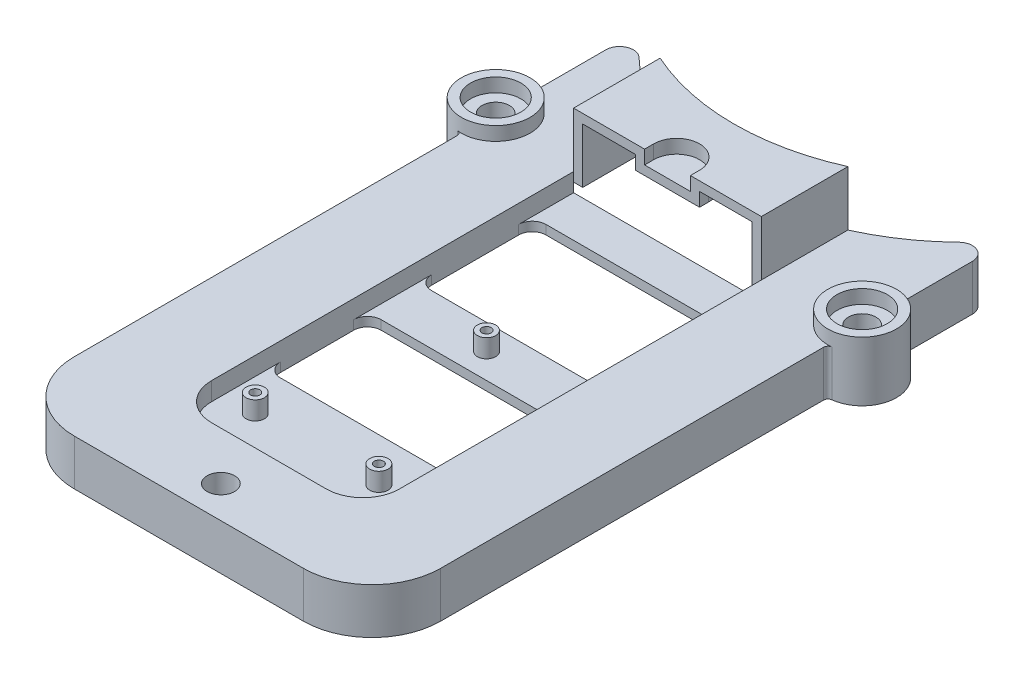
ISO-10303-21;
HEADER;
FILE_DESCRIPTION(('STEP AP214'),'2;1');
FILE_NAME('part.step','',(''),(''),'','','');
FILE_SCHEMA(('AUTOMOTIVE_DESIGN { 1 0 10303 214 1 1 1 1 }'));
ENDSEC;
DATA;
#1=APPLICATION_CONTEXT('core data for automotive mechanical design processes');
#2=APPLICATION_PROTOCOL_DEFINITION('international standard','automotive_design',2000,#1);
#3=PRODUCT_CONTEXT('',#1,'mechanical');
#4=PRODUCT('Part','Part','',(#3));
#5=PRODUCT_RELATED_PRODUCT_CATEGORY('part','',(#4));
#6=PRODUCT_DEFINITION_FORMATION('','',#4);
#7=PRODUCT_DEFINITION_CONTEXT('part definition',#1,'design');
#8=PRODUCT_DEFINITION('design','',#6,#7);
#9=PRODUCT_DEFINITION_SHAPE('','',#8);
#10=(LENGTH_UNIT() NAMED_UNIT(*) SI_UNIT(.MILLI.,.METRE.));
#11=(NAMED_UNIT(*) PLANE_ANGLE_UNIT() SI_UNIT($,.RADIAN.));
#12=(NAMED_UNIT(*) SI_UNIT($,.STERADIAN.) SOLID_ANGLE_UNIT());
#13=UNCERTAINTY_MEASURE_WITH_UNIT(LENGTH_MEASURE(1.E-05),#10,'distance_accuracy_value','');
#14=(GEOMETRIC_REPRESENTATION_CONTEXT(3) GLOBAL_UNCERTAINTY_ASSIGNED_CONTEXT((#13)) GLOBAL_UNIT_ASSIGNED_CONTEXT((#10,
#11,#12)) REPRESENTATION_CONTEXT('',''));
#15=CARTESIAN_POINT('',(0.,0.,0.));
#16=DIRECTION('',(0.,0.,1.));
#17=DIRECTION('',(1.,0.,0.));
#18=AXIS2_PLACEMENT_3D('',#15,#16,#17);
#19=CARTESIAN_POINT('',(40.,4.,62.));
#20=DIRECTION('',(0.,1.,0.));
#21=DIRECTION('',(0.,0.,1.));
#22=AXIS2_PLACEMENT_3D('',#19,#20,#21);
#23=PLANE('',#22);
#24=CARTESIAN_POINT('',(40.,4.,62.));
#25=DIRECTION('',(0.,1.,0.));
#26=DIRECTION('',(0.,0.,1.));
#27=AXIS2_PLACEMENT_3D('',#24,#25,#26);
#28=CIRCLE('',#27,3.);
#29=CARTESIAN_POINT('',(40.,4.,65.));
#30=VERTEX_POINT('',#29);
#31=EDGE_CURVE('E18',#30,#30,#28,.T.);
#32=ORIENTED_EDGE('',*,*,#31,.T.);
#33=EDGE_LOOP('',(#32));
#34=FACE_BOUND('',#33,.T.);
#35=CARTESIAN_POINT('',(40.,4.,62.));
#36=DIRECTION('',(0.,1.,0.));
#37=DIRECTION('',(0.,0.,1.));
#38=AXIS2_PLACEMENT_3D('',#35,#36,#37);
#39=CIRCLE('',#38,1.5);
#40=CARTESIAN_POINT('',(40.,4.,63.5));
#41=VERTEX_POINT('',#40);
#42=EDGE_CURVE('E1181',#41,#41,#39,.F.);
#43=ORIENTED_EDGE('',*,*,#42,.T.);
#44=EDGE_LOOP('',(#43));
#45=FACE_BOUND('',#44,.T.);
#46=ADVANCED_FACE('F15',(#34,#45),#23,.T.);
#47=CARTESIAN_POINT('',(-40.,4.,62.));
#48=DIRECTION('',(0.,1.,0.));
#49=DIRECTION('',(0.,0.,1.));
#50=AXIS2_PLACEMENT_3D('',#47,#48,#49);
#51=PLANE('',#50);
#52=CARTESIAN_POINT('',(-40.,4.,62.));
#53=DIRECTION('',(0.,1.,0.));
#54=DIRECTION('',(0.,0.,1.));
#55=AXIS2_PLACEMENT_3D('',#52,#53,#54);
#56=CIRCLE('',#55,3.);
#57=CARTESIAN_POINT('',(-40.,4.,65.));
#58=VERTEX_POINT('',#57);
#59=EDGE_CURVE('E1183',#58,#58,#56,.T.);
#60=ORIENTED_EDGE('',*,*,#59,.T.);
#61=EDGE_LOOP('',(#60));
#62=FACE_BOUND('',#61,.T.);
#63=CARTESIAN_POINT('',(-40.,4.,62.));
#64=DIRECTION('',(0.,1.,0.));
#65=DIRECTION('',(0.,0.,1.));
#66=AXIS2_PLACEMENT_3D('',#63,#64,#65);
#67=CIRCLE('',#66,1.5);
#68=CARTESIAN_POINT('',(-40.,4.,63.5));
#69=VERTEX_POINT('',#68);
#70=EDGE_CURVE('E506',#69,#69,#67,.F.);
#71=ORIENTED_EDGE('',*,*,#70,.T.);
#72=EDGE_LOOP('',(#71));
#73=FACE_BOUND('',#72,.T.);
#74=ADVANCED_FACE('F1196',(#62,#73),#51,.T.);
#75=CARTESIAN_POINT('',(40.,4.,62.));
#76=DIRECTION('',(0.,1.,0.));
#77=DIRECTION('',(0.,0.,1.));
#78=AXIS2_PLACEMENT_3D('',#75,#76,#77);
#79=CYLINDRICAL_SURFACE('',#78,3.);
#80=ORIENTED_EDGE('',*,*,#31,.F.);
#81=EDGE_LOOP('',(#80));
#82=FACE_BOUND('',#81,.T.);
#83=CARTESIAN_POINT('',(40.,10.,62.));
#84=DIRECTION('',(0.,1.,0.));
#85=DIRECTION('',(0.,0.,1.));
#86=AXIS2_PLACEMENT_3D('',#83,#84,#85);
#87=CIRCLE('',#86,3.);
#88=CARTESIAN_POINT('',(40.,10.,65.));
#89=VERTEX_POINT('',#88);
#90=EDGE_CURVE('E1171',#89,#89,#87,.T.);
#91=ORIENTED_EDGE('',*,*,#90,.T.);
#92=EDGE_LOOP('',(#91));
#93=FACE_BOUND('',#92,.T.);
#94=ADVANCED_FACE('F1192',(#82,#93),#79,.F.);
#95=CARTESIAN_POINT('',(-40.,4.,62.));
#96=DIRECTION('',(0.,1.,0.));
#97=DIRECTION('',(0.,0.,1.));
#98=AXIS2_PLACEMENT_3D('',#95,#96,#97);
#99=CYLINDRICAL_SURFACE('',#98,3.);
#100=ORIENTED_EDGE('',*,*,#59,.F.);
#101=EDGE_LOOP('',(#100));
#102=FACE_BOUND('',#101,.T.);
#103=CARTESIAN_POINT('',(-40.,10.,62.));
#104=DIRECTION('',(0.,1.,0.));
#105=DIRECTION('',(0.,0.,1.));
#106=AXIS2_PLACEMENT_3D('',#103,#104,#105);
#107=CIRCLE('',#106,3.);
#108=CARTESIAN_POINT('',(-40.,10.,65.));
#109=VERTEX_POINT('',#108);
#110=EDGE_CURVE('E1168',#109,#109,#107,.T.);
#111=ORIENTED_EDGE('',*,*,#110,.T.);
#112=EDGE_LOOP('',(#111));
#113=FACE_BOUND('',#112,.T.);
#114=ADVANCED_FACE('F1195',(#102,#113),#99,.F.);
#115=CARTESIAN_POINT('',(40.,0.,62.));
#116=DIRECTION('',(0.,1.,0.));
#117=DIRECTION('',(0.,0.,1.));
#118=AXIS2_PLACEMENT_3D('',#115,#116,#117);
#119=CYLINDRICAL_SURFACE('',#118,1.5);
#120=CARTESIAN_POINT('',(40.,2.5,62.));
#121=DIRECTION('',(0.,1.,0.));
#122=DIRECTION('',(0.,0.,1.));
#123=AXIS2_PLACEMENT_3D('',#120,#121,#122);
#124=CIRCLE('',#123,1.5);
#125=CARTESIAN_POINT('',(40.,2.5,63.5));
#126=VERTEX_POINT('',#125);
#127=EDGE_CURVE('E1165',#126,#126,#124,.F.);
#128=ORIENTED_EDGE('',*,*,#127,.T.);
#129=EDGE_LOOP('',(#128));
#130=FACE_BOUND('',#129,.T.);
#131=ORIENTED_EDGE('',*,*,#42,.F.);
#132=EDGE_LOOP('',(#131));
#133=FACE_BOUND('',#132,.T.);
#134=ADVANCED_FACE('F1633',(#130,#133),#119,.F.);
#135=CARTESIAN_POINT('',(-40.,0.,62.));
#136=DIRECTION('',(0.,1.,0.));
#137=DIRECTION('',(0.,0.,1.));
#138=AXIS2_PLACEMENT_3D('',#135,#136,#137);
#139=CYLINDRICAL_SURFACE('',#138,1.5);
#140=CARTESIAN_POINT('',(-40.,2.5,62.));
#141=DIRECTION('',(0.,1.,0.));
#142=DIRECTION('',(0.,0.,1.));
#143=AXIS2_PLACEMENT_3D('',#140,#141,#142);
#144=CIRCLE('',#143,1.5);
#145=CARTESIAN_POINT('',(-40.,2.5,63.5));
#146=VERTEX_POINT('',#145);
#147=EDGE_CURVE('E1162',#146,#146,#144,.F.);
#148=ORIENTED_EDGE('',*,*,#147,.T.);
#149=EDGE_LOOP('',(#148));
#150=FACE_BOUND('',#149,.T.);
#151=ORIENTED_EDGE('',*,*,#70,.F.);
#152=EDGE_LOOP('',(#151));
#153=FACE_BOUND('',#152,.T.);
#154=ADVANCED_FACE('F1636',(#150,#153),#139,.F.);
#155=CARTESIAN_POINT('',(0.,10.,104.));
#156=DIRECTION('',(0.,1.,0.));
#157=DIRECTION('',(0.,0.,1.));
#158=AXIS2_PLACEMENT_3D('',#155,#156,#157);
#159=PLANE('',#158);
#160=CARTESIAN_POINT('',(0.,10.,104.));
#161=DIRECTION('',(0.,-1.,0.));
#162=DIRECTION('',(0.,0.,-1.));
#163=AXIS2_PLACEMENT_3D('',#160,#161,#162);
#164=CIRCLE('',#163,2.);
#165=CARTESIAN_POINT('',(0.,10.,102.));
#166=VERTEX_POINT('',#165);
#167=EDGE_CURVE('E1145',#166,#166,#164,.T.);
#168=ORIENTED_EDGE('',*,*,#167,.F.);
#169=EDGE_LOOP('',(#168));
#170=FACE_BOUND('',#169,.T.);
#171=CARTESIAN_POINT('',(0.,10.,104.));
#172=DIRECTION('',(0.,1.,0.));
#173=DIRECTION('',(0.,0.,1.));
#174=AXIS2_PLACEMENT_3D('',#171,#172,#173);
#175=CIRCLE('',#174,1.);
#176=CARTESIAN_POINT('',(0.,10.,105.));
#177=VERTEX_POINT('',#176);
#178=EDGE_CURVE('E1142',#177,#177,#175,.F.);
#179=ORIENTED_EDGE('',*,*,#178,.T.);
#180=EDGE_LOOP('',(#179));
#181=FACE_BOUND('',#180,.T.);
#182=ADVANCED_FACE('F1653',(#170,#181),#159,.T.);
#183=CARTESIAN_POINT('',(13.5,10.,141.));
#184=DIRECTION('',(0.,1.,0.));
#185=DIRECTION('',(0.,0.,1.));
#186=AXIS2_PLACEMENT_3D('',#183,#184,#185);
#187=PLANE('',#186);
#188=CARTESIAN_POINT('',(13.5,10.,141.));
#189=DIRECTION('',(0.,-1.,0.));
#190=DIRECTION('',(0.,0.,-1.));
#191=AXIS2_PLACEMENT_3D('',#188,#189,#190);
#192=CIRCLE('',#191,2.);
#193=CARTESIAN_POINT('',(13.5,10.,139.));
#194=VERTEX_POINT('',#193);
#195=EDGE_CURVE('E1151',#194,#194,#192,.T.);
#196=ORIENTED_EDGE('',*,*,#195,.F.);
#197=EDGE_LOOP('',(#196));
#198=FACE_BOUND('',#197,.T.);
#199=CARTESIAN_POINT('',(13.5,10.,141.));
#200=DIRECTION('',(0.,1.,0.));
#201=DIRECTION('',(0.,0.,1.));
#202=AXIS2_PLACEMENT_3D('',#199,#200,#201);
#203=CIRCLE('',#202,1.);
#204=CARTESIAN_POINT('',(13.5,10.,142.));
#205=VERTEX_POINT('',#204);
#206=EDGE_CURVE('E1139',#205,#205,#203,.F.);
#207=ORIENTED_EDGE('',*,*,#206,.T.);
#208=EDGE_LOOP('',(#207));
#209=FACE_BOUND('',#208,.T.);
#210=ADVANCED_FACE('F1657',(#198,#209),#187,.T.);
#211=CARTESIAN_POINT('',(-13.5,10.,141.));
#212=DIRECTION('',(0.,1.,0.));
#213=DIRECTION('',(0.,0.,1.));
#214=AXIS2_PLACEMENT_3D('',#211,#212,#213);
#215=PLANE('',#214);
#216=CARTESIAN_POINT('',(-13.5,10.,141.));
#217=DIRECTION('',(0.,-1.,0.));
#218=DIRECTION('',(0.,0.,-1.));
#219=AXIS2_PLACEMENT_3D('',#216,#217,#218);
#220=CIRCLE('',#219,2.);
#221=CARTESIAN_POINT('',(-13.5,10.,139.));
#222=VERTEX_POINT('',#221);
#223=EDGE_CURVE('E1148',#222,#222,#220,.T.);
#224=ORIENTED_EDGE('',*,*,#223,.F.);
#225=EDGE_LOOP('',(#224));
#226=FACE_BOUND('',#225,.T.);
#227=CARTESIAN_POINT('',(-13.5,10.,141.));
#228=DIRECTION('',(0.,1.,0.));
#229=DIRECTION('',(0.,0.,1.));
#230=AXIS2_PLACEMENT_3D('',#227,#228,#229);
#231=CIRCLE('',#230,1.);
#232=CARTESIAN_POINT('',(-13.5,10.,142.));
#233=VERTEX_POINT('',#232);
#234=EDGE_CURVE('E828',#233,#233,#231,.F.);
#235=ORIENTED_EDGE('',*,*,#234,.T.);
#236=EDGE_LOOP('',(#235));
#237=FACE_BOUND('',#236,.T.);
#238=ADVANCED_FACE('F1661',(#226,#237),#215,.T.);
#239=CARTESIAN_POINT('',(14.,-0.001000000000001,149.5));
#240=DIRECTION('',(0.,1.,0.));
#241=DIRECTION('',(0.,0.,1.));
#242=AXIS2_PLACEMENT_3D('',#239,#240,#241);
#243=CYLINDRICAL_SURFACE('',#242,1.);
#244=DIRECTION('',(0.,1.,0.));
#245=VECTOR('',#244,1.);
#246=CARTESIAN_POINT('',(15.,-0.001000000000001,149.5));
#247=LINE('',#246,#245);
#248=CARTESIAN_POINT('',(15.,4.,149.5));
#249=VERTEX_POINT('',#248);
#250=CARTESIAN_POINT('',(15.,6.,149.5));
#251=VERTEX_POINT('',#250);
#252=EDGE_CURVE('E509',#249,#251,#247,.T.);
#253=ORIENTED_EDGE('',*,*,#252,.T.);
#254=CARTESIAN_POINT('',(14.,6.,149.5));
#255=DIRECTION('',(0.,1.,0.));
#256=DIRECTION('',(0.,0.,1.));
#257=AXIS2_PLACEMENT_3D('',#254,#255,#256);
#258=CIRCLE('',#257,1.);
#259=CARTESIAN_POINT('',(14.,6.,148.5));
#260=VERTEX_POINT('',#259);
#261=EDGE_CURVE('E494',#260,#251,#258,.F.);
#262=ORIENTED_EDGE('',*,*,#261,.F.);
#263=DIRECTION('',(0.,1.,0.));
#264=VECTOR('',#263,1.);
#265=CARTESIAN_POINT('',(14.,-0.001000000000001,148.5));
#266=LINE('',#265,#264);
#267=CARTESIAN_POINT('',(14.,4.,148.5));
#268=VERTEX_POINT('',#267);
#269=EDGE_CURVE('E515',#260,#268,#266,.F.);
#270=ORIENTED_EDGE('',*,*,#269,.T.);
#271=CARTESIAN_POINT('',(14.,4.,149.5));
#272=DIRECTION('',(0.,1.,0.));
#273=DIRECTION('',(0.,0.,1.));
#274=AXIS2_PLACEMENT_3D('',#271,#272,#273);
#275=CIRCLE('',#274,1.);
#276=EDGE_CURVE('E505',#249,#268,#275,.T.);
#277=ORIENTED_EDGE('',*,*,#276,.F.);
#278=EDGE_LOOP('',(#253,#262,#270,#277));
#279=FACE_BOUND('',#278,.T.);
#280=ADVANCED_FACE('F510',(#279),#243,.F.);
#281=CARTESIAN_POINT('',(-14.,-0.001000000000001,149.5));
#282=DIRECTION('',(0.,1.,0.));
#283=DIRECTION('',(0.,0.,1.));
#284=AXIS2_PLACEMENT_3D('',#281,#282,#283);
#285=CYLINDRICAL_SURFACE('',#284,1.);
#286=DIRECTION('',(0.,1.,0.));
#287=VECTOR('',#286,1.);
#288=CARTESIAN_POINT('',(-14.,-0.001000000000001,148.5));
#289=LINE('',#288,#287);
#290=CARTESIAN_POINT('',(-14.,4.,148.5));
#291=VERTEX_POINT('',#290);
#292=CARTESIAN_POINT('',(-14.,6.,148.5));
#293=VERTEX_POINT('',#292);
#294=EDGE_CURVE('E825',#291,#293,#289,.T.);
#295=ORIENTED_EDGE('',*,*,#294,.T.);
#296=CARTESIAN_POINT('',(-14.,6.,149.5));
#297=DIRECTION('',(0.,1.,0.));
#298=DIRECTION('',(0.,0.,1.));
#299=AXIS2_PLACEMENT_3D('',#296,#297,#298);
#300=CIRCLE('',#299,1.);
#301=CARTESIAN_POINT('',(-15.,6.,149.5));
#302=VERTEX_POINT('',#301);
#303=EDGE_CURVE('E1176',#302,#293,#300,.F.);
#304=ORIENTED_EDGE('',*,*,#303,.F.);
#305=DIRECTION('',(0.,1.,0.));
#306=VECTOR('',#305,1.);
#307=CARTESIAN_POINT('',(-15.,-0.001000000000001,149.5));
#308=LINE('',#307,#306);
#309=CARTESIAN_POINT('',(-15.,4.,149.5));
#310=VERTEX_POINT('',#309);
#311=EDGE_CURVE('E514',#302,#310,#308,.F.);
#312=ORIENTED_EDGE('',*,*,#311,.T.);
#313=CARTESIAN_POINT('',(-14.,4.,149.5));
#314=DIRECTION('',(0.,1.,0.));
#315=DIRECTION('',(0.,0.,1.));
#316=AXIS2_PLACEMENT_3D('',#313,#314,#315);
#317=CIRCLE('',#316,1.);
#318=EDGE_CURVE('E1174',#291,#310,#317,.T.);
#319=ORIENTED_EDGE('',*,*,#318,.F.);
#320=EDGE_LOOP('',(#295,#304,#312,#319));
#321=FACE_BOUND('',#320,.T.);
#322=ADVANCED_FACE('F1214',(#321),#285,.F.);
#323=CARTESIAN_POINT('',(0.,19.,62.5));
#324=DIRECTION('',(0.,1.,0.));
#325=DIRECTION('',(0.,0.,1.));
#326=AXIS2_PLACEMENT_3D('',#323,#324,#325);
#327=CYLINDRICAL_SURFACE('',#326,6.99999999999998);
#328=CARTESIAN_POINT('',(0.,17.,62.5));
#329=DIRECTION('',(0.,1.,0.));
#330=DIRECTION('',(0.,0.,1.));
#331=AXIS2_PLACEMENT_3D('',#328,#329,#330);
#332=CIRCLE('',#331,6.99999999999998);
#333=CARTESIAN_POINT('',(7.,17.,62.5));
#334=VERTEX_POINT('',#333);
#335=CARTESIAN_POINT('',(-6.99999999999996,17.,62.5));
#336=VERTEX_POINT('',#335);
#337=EDGE_CURVE('E781',#334,#336,#332,.T.);
#338=ORIENTED_EDGE('',*,*,#337,.T.);
#339=DIRECTION('',(0.,1.,0.));
#340=VECTOR('',#339,1.);
#341=CARTESIAN_POINT('',(-6.99999999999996,19.,62.5));
#342=LINE('',#341,#340);
#343=CARTESIAN_POINT('',(-6.99999999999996,20.,62.5));
#344=VERTEX_POINT('',#343);
#345=EDGE_CURVE('E770',#344,#336,#342,.F.);
#346=ORIENTED_EDGE('',*,*,#345,.F.);
#347=CARTESIAN_POINT('',(0.,20.,62.5));
#348=DIRECTION('',(0.,1.,0.));
#349=DIRECTION('',(0.,0.,1.));
#350=AXIS2_PLACEMENT_3D('',#347,#348,#349);
#351=CIRCLE('',#350,6.99999999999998);
#352=CARTESIAN_POINT('',(6.99999999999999,20.,62.5));
#353=VERTEX_POINT('',#352);
#354=EDGE_CURVE('E754',#344,#353,#351,.F.);
#355=ORIENTED_EDGE('',*,*,#354,.T.);
#356=DIRECTION('',(0.,1.,0.));
#357=VECTOR('',#356,1.);
#358=CARTESIAN_POINT('',(7.,19.,62.5));
#359=LINE('',#358,#357);
#360=EDGE_CURVE('E782',#334,#353,#359,.T.);
#361=ORIENTED_EDGE('',*,*,#360,.F.);
#362=EDGE_LOOP('',(#338,#346,#355,#361));
#363=FACE_BOUND('',#362,.T.);
#364=ADVANCED_FACE('F1203',(#363),#327,.T.);
#365=CARTESIAN_POINT('',(-40.,10.,62.));
#366=DIRECTION('',(0.,-1.,0.));
#367=DIRECTION('',(0.,0.,-1.));
#368=AXIS2_PLACEMENT_3D('',#365,#366,#367);
#369=PLANE('',#368);
#370=CARTESIAN_POINT('',(40.,10.,62.));
#371=DIRECTION('',(0.,-1.,0.));
#372=DIRECTION('',(0.,0.,-1.));
#373=AXIS2_PLACEMENT_3D('',#370,#371,#372);
#374=CIRCLE('',#373,5.50000000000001);
#375=CARTESIAN_POINT('',(40.,10.,56.5));
#376=VERTEX_POINT('',#375);
#377=EDGE_CURVE('E753',#376,#376,#374,.F.);
#378=ORIENTED_EDGE('',*,*,#377,.T.);
#379=EDGE_LOOP('',(#378));
#380=FACE_BOUND('',#379,.T.);
#381=ORIENTED_EDGE('',*,*,#90,.F.);
#382=EDGE_LOOP('',(#381));
#383=FACE_BOUND('',#382,.T.);
#384=ADVANCED_FACE('F1200',(#380,#383),#369,.F.);
#385=CARTESIAN_POINT('',(-40.,10.,62.));
#386=DIRECTION('',(0.,-1.,0.));
#387=DIRECTION('',(0.,0.,-1.));
#388=AXIS2_PLACEMENT_3D('',#385,#386,#387);
#389=PLANE('',#388);
#390=CARTESIAN_POINT('',(-40.,10.,62.));
#391=DIRECTION('',(0.,-1.,0.));
#392=DIRECTION('',(0.,0.,-1.));
#393=AXIS2_PLACEMENT_3D('',#390,#391,#392);
#394=CIRCLE('',#393,5.50000000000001);
#395=CARTESIAN_POINT('',(-40.,10.,56.5));
#396=VERTEX_POINT('',#395);
#397=EDGE_CURVE('E794',#396,#396,#394,.F.);
#398=ORIENTED_EDGE('',*,*,#397,.T.);
#399=EDGE_LOOP('',(#398));
#400=FACE_BOUND('',#399,.T.);
#401=ORIENTED_EDGE('',*,*,#110,.F.);
#402=EDGE_LOOP('',(#401));
#403=FACE_BOUND('',#402,.T.);
#404=ADVANCED_FACE('F1202',(#400,#403),#389,.F.);
#405=CARTESIAN_POINT('',(40.,2.5,62.));
#406=DIRECTION('',(0.,1.,0.));
#407=DIRECTION('',(0.,0.,1.));
#408=AXIS2_PLACEMENT_3D('',#405,#406,#407);
#409=PLANE('',#408);
#410=CARTESIAN_POINT('',(40.,2.5,62.));
#411=DIRECTION('',(0.,1.,0.));
#412=DIRECTION('',(0.,0.,1.));
#413=AXIS2_PLACEMENT_3D('',#410,#411,#412);
#414=CIRCLE('',#413,4.5);
#415=CARTESIAN_POINT('',(40.,2.5,66.5));
#416=VERTEX_POINT('',#415);
#417=EDGE_CURVE('E1123',#416,#416,#414,.T.);
#418=ORIENTED_EDGE('',*,*,#417,.F.);
#419=EDGE_LOOP('',(#418));
#420=FACE_BOUND('',#419,.T.);
#421=ORIENTED_EDGE('',*,*,#127,.F.);
#422=EDGE_LOOP('',(#421));
#423=FACE_BOUND('',#422,.T.);
#424=ADVANCED_FACE('F1211',(#420,#423),#409,.F.);
#425=CARTESIAN_POINT('',(-40.,2.5,62.));
#426=DIRECTION('',(0.,1.,0.));
#427=DIRECTION('',(0.,0.,1.));
#428=AXIS2_PLACEMENT_3D('',#425,#426,#427);
#429=PLANE('',#428);
#430=CARTESIAN_POINT('',(-40.,2.5,62.));
#431=DIRECTION('',(0.,1.,0.));
#432=DIRECTION('',(0.,0.,1.));
#433=AXIS2_PLACEMENT_3D('',#430,#431,#432);
#434=CIRCLE('',#433,4.5);
#435=CARTESIAN_POINT('',(-40.,2.5,66.5));
#436=VERTEX_POINT('',#435);
#437=EDGE_CURVE('E799',#436,#436,#434,.T.);
#438=ORIENTED_EDGE('',*,*,#437,.F.);
#439=EDGE_LOOP('',(#438));
#440=FACE_BOUND('',#439,.T.);
#441=ORIENTED_EDGE('',*,*,#147,.F.);
#442=EDGE_LOOP('',(#441));
#443=FACE_BOUND('',#442,.T.);
#444=ADVANCED_FACE('F1620',(#440,#443),#429,.F.);
#445=CARTESIAN_POINT('',(37.,10.,37.9473319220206));
#446=DIRECTION('',(0.,-1.,0.));
#447=DIRECTION('',(0.,0.,-1.));
#448=AXIS2_PLACEMENT_3D('',#445,#446,#447);
#449=CYLINDRICAL_SURFACE('',#448,1.);
#450=CARTESIAN_POINT('',(37.,8.,37.9473319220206));
#451=DIRECTION('',(0.,-1.,0.));
#452=DIRECTION('',(0.,0.,-1.));
#453=AXIS2_PLACEMENT_3D('',#450,#451,#452);
#454=CIRCLE('',#453,1.);
#455=CARTESIAN_POINT('',(36.3018867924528,8.,37.2313445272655));
#456=VERTEX_POINT('',#455);
#457=CARTESIAN_POINT('',(38.,8.,37.9473319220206));
#458=VERTEX_POINT('',#457);
#459=EDGE_CURVE('E1158',#456,#458,#454,.T.);
#460=ORIENTED_EDGE('',*,*,#459,.F.);
#461=DIRECTION('',(0.,-1.,0.));
#462=VECTOR('',#461,1.);
#463=CARTESIAN_POINT('',(36.3018867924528,10.,37.2313445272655));
#464=LINE('',#463,#462);
#465=CARTESIAN_POINT('',(36.3018867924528,0.,37.2313445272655));
#466=VERTEX_POINT('',#465);
#467=EDGE_CURVE('E612',#466,#456,#464,.F.);
#468=ORIENTED_EDGE('',*,*,#467,.F.);
#469=CARTESIAN_POINT('',(37.,0.,37.9473319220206));
#470=DIRECTION('',(0.,-1.,0.));
#471=DIRECTION('',(0.,0.,-1.));
#472=AXIS2_PLACEMENT_3D('',#469,#470,#471);
#473=CIRCLE('',#472,1.);
#474=CARTESIAN_POINT('',(38.,0.,37.9473319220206));
#475=VERTEX_POINT('',#474);
#476=EDGE_CURVE('E1160',#475,#466,#473,.F.);
#477=ORIENTED_EDGE('',*,*,#476,.F.);
#478=DIRECTION('',(0.,1.,0.));
#479=VECTOR('',#478,1.);
#480=CARTESIAN_POINT('',(38.,10.,37.9473319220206));
#481=LINE('',#480,#479);
#482=EDGE_CURVE('E616',#458,#475,#481,.F.);
#483=ORIENTED_EDGE('',*,*,#482,.F.);
#484=EDGE_LOOP('',(#460,#468,#477,#483));
#485=FACE_BOUND('',#484,.T.);
#486=ADVANCED_FACE('F1616',(#485),#449,.F.);
#487=CARTESIAN_POINT('',(-37.,10.,37.9473319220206));
#488=DIRECTION('',(0.,-1.,0.));
#489=DIRECTION('',(0.,0.,-1.));
#490=AXIS2_PLACEMENT_3D('',#487,#488,#489);
#491=CYLINDRICAL_SURFACE('',#490,1.);
#492=CARTESIAN_POINT('',(-37.,8.,37.9473319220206));
#493=DIRECTION('',(0.,-1.,0.));
#494=DIRECTION('',(0.,0.,-1.));
#495=AXIS2_PLACEMENT_3D('',#492,#493,#494);
#496=CIRCLE('',#495,1.);
#497=CARTESIAN_POINT('',(-38.,8.,37.9473319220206));
#498=VERTEX_POINT('',#497);
#499=CARTESIAN_POINT('',(-36.3018867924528,8.,37.2313445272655));
#500=VERTEX_POINT('',#499);
#501=EDGE_CURVE('E1154',#498,#500,#496,.T.);
#502=ORIENTED_EDGE('',*,*,#501,.F.);
#503=DIRECTION('',(0.,1.,0.));
#504=VECTOR('',#503,1.);
#505=CARTESIAN_POINT('',(-38.,10.,37.9473319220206));
#506=LINE('',#505,#504);
#507=CARTESIAN_POINT('',(-38.,0.,37.9473319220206));
#508=VERTEX_POINT('',#507);
#509=EDGE_CURVE('E647',#508,#498,#506,.T.);
#510=ORIENTED_EDGE('',*,*,#509,.F.);
#511=CARTESIAN_POINT('',(-37.,0.,37.9473319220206));
#512=DIRECTION('',(0.,-1.,0.));
#513=DIRECTION('',(0.,0.,-1.));
#514=AXIS2_PLACEMENT_3D('',#511,#512,#513);
#515=CIRCLE('',#514,1.);
#516=CARTESIAN_POINT('',(-36.3018867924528,0.,37.2313445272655));
#517=VERTEX_POINT('',#516);
#518=EDGE_CURVE('E1156',#517,#508,#515,.F.);
#519=ORIENTED_EDGE('',*,*,#518,.F.);
#520=DIRECTION('',(0.,-1.,0.));
#521=VECTOR('',#520,1.);
#522=CARTESIAN_POINT('',(-36.3018867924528,10.,37.2313445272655));
#523=LINE('',#522,#521);
#524=EDGE_CURVE('E615',#500,#517,#523,.T.);
#525=ORIENTED_EDGE('',*,*,#524,.F.);
#526=EDGE_LOOP('',(#502,#510,#519,#525));
#527=FACE_BOUND('',#526,.T.);
#528=ADVANCED_FACE('F1612',(#527),#491,.F.);
#529=CARTESIAN_POINT('',(0.,2.5,162.));
#530=DIRECTION('',(0.,1.,0.));
#531=DIRECTION('',(0.,0.,1.));
#532=AXIS2_PLACEMENT_3D('',#529,#530,#531);
#533=PLANE('',#532);
#534=CARTESIAN_POINT('',(0.,2.5,162.));
#535=DIRECTION('',(0.,1.,0.));
#536=DIRECTION('',(0.,0.,1.));
#537=AXIS2_PLACEMENT_3D('',#534,#535,#536);
#538=CIRCLE('',#537,4.5);
#539=CARTESIAN_POINT('',(0.,2.5,166.5));
#540=VERTEX_POINT('',#539);
#541=EDGE_CURVE('E676',#540,#540,#538,.T.);
#542=ORIENTED_EDGE('',*,*,#541,.F.);
#543=EDGE_LOOP('',(#542));
#544=FACE_BOUND('',#543,.T.);
#545=CARTESIAN_POINT('',(0.,2.5,162.));
#546=DIRECTION('',(0.,1.,0.));
#547=DIRECTION('',(0.,0.,1.));
#548=AXIS2_PLACEMENT_3D('',#545,#546,#547);
#549=CIRCLE('',#548,1.5);
#550=CARTESIAN_POINT('',(0.,2.5,163.5));
#551=VERTEX_POINT('',#550);
#552=EDGE_CURVE('E653',#551,#551,#549,.T.);
#553=ORIENTED_EDGE('',*,*,#552,.T.);
#554=EDGE_LOOP('',(#553));
#555=FACE_BOUND('',#554,.T.);
#556=ADVANCED_FACE('F1608',(#544,#555),#533,.F.);
#557=CARTESIAN_POINT('',(13.5,10.,141.));
#558=DIRECTION('',(0.,-1.,0.));
#559=DIRECTION('',(0.,0.,-1.));
#560=AXIS2_PLACEMENT_3D('',#557,#558,#559);
#561=CYLINDRICAL_SURFACE('',#560,2.);
#562=CARTESIAN_POINT('',(13.5,6.,141.));
#563=DIRECTION('',(0.,-1.,0.));
#564=DIRECTION('',(0.,0.,-1.));
#565=AXIS2_PLACEMENT_3D('',#562,#563,#564);
#566=CIRCLE('',#565,2.);
#567=CARTESIAN_POINT('',(13.5,6.,139.));
#568=VERTEX_POINT('',#567);
#569=EDGE_CURVE('E534',#568,#568,#566,.T.);
#570=ORIENTED_EDGE('',*,*,#569,.F.);
#571=EDGE_LOOP('',(#570));
#572=FACE_BOUND('',#571,.T.);
#573=ORIENTED_EDGE('',*,*,#195,.T.);
#574=EDGE_LOOP('',(#573));
#575=FACE_BOUND('',#574,.T.);
#576=ADVANCED_FACE('F1604',(#572,#575),#561,.T.);
#577=CARTESIAN_POINT('',(-13.5,10.,141.));
#578=DIRECTION('',(0.,-1.,0.));
#579=DIRECTION('',(0.,0.,-1.));
#580=AXIS2_PLACEMENT_3D('',#577,#578,#579);
#581=CYLINDRICAL_SURFACE('',#580,2.);
#582=CARTESIAN_POINT('',(-13.5,6.,141.));
#583=DIRECTION('',(0.,-1.,0.));
#584=DIRECTION('',(0.,0.,-1.));
#585=AXIS2_PLACEMENT_3D('',#582,#583,#584);
#586=CIRCLE('',#585,2.);
#587=CARTESIAN_POINT('',(-13.5,6.,139.));
#588=VERTEX_POINT('',#587);
#589=EDGE_CURVE('E531',#588,#588,#586,.T.);
#590=ORIENTED_EDGE('',*,*,#589,.F.);
#591=EDGE_LOOP('',(#590));
#592=FACE_BOUND('',#591,.T.);
#593=ORIENTED_EDGE('',*,*,#223,.T.);
#594=EDGE_LOOP('',(#593));
#595=FACE_BOUND('',#594,.T.);
#596=ADVANCED_FACE('F1600',(#592,#595),#581,.T.);
#597=CARTESIAN_POINT('',(0.,10.,104.));
#598=DIRECTION('',(0.,-1.,0.));
#599=DIRECTION('',(0.,0.,-1.));
#600=AXIS2_PLACEMENT_3D('',#597,#598,#599);
#601=CYLINDRICAL_SURFACE('',#600,2.);
#602=CARTESIAN_POINT('',(0.,6.,104.));
#603=DIRECTION('',(0.,-1.,0.));
#604=DIRECTION('',(0.,0.,-1.));
#605=AXIS2_PLACEMENT_3D('',#602,#603,#604);
#606=CIRCLE('',#605,2.);
#607=CARTESIAN_POINT('',(0.,6.,102.));
#608=VERTEX_POINT('',#607);
#609=EDGE_CURVE('E839',#608,#608,#606,.T.);
#610=ORIENTED_EDGE('',*,*,#609,.F.);
#611=EDGE_LOOP('',(#610));
#612=FACE_BOUND('',#611,.T.);
#613=ORIENTED_EDGE('',*,*,#167,.T.);
#614=EDGE_LOOP('',(#613));
#615=FACE_BOUND('',#614,.T.);
#616=ADVANCED_FACE('F1596',(#612,#615),#601,.T.);
#617=CARTESIAN_POINT('',(0.,0.,104.));
#618=DIRECTION('',(0.,1.,0.));
#619=DIRECTION('',(0.,0.,1.));
#620=AXIS2_PLACEMENT_3D('',#617,#618,#619);
#621=CYLINDRICAL_SURFACE('',#620,1.);
#622=CARTESIAN_POINT('',(0.,4.,104.));
#623=DIRECTION('',(0.,1.,0.));
#624=DIRECTION('',(0.,0.,1.));
#625=AXIS2_PLACEMENT_3D('',#622,#623,#624);
#626=CIRCLE('',#625,1.);
#627=CARTESIAN_POINT('',(0.,4.,105.));
#628=VERTEX_POINT('',#627);
#629=EDGE_CURVE('E835',#628,#628,#626,.F.);
#630=ORIENTED_EDGE('',*,*,#629,.T.);
#631=EDGE_LOOP('',(#630));
#632=FACE_BOUND('',#631,.T.);
#633=ORIENTED_EDGE('',*,*,#178,.F.);
#634=EDGE_LOOP('',(#633));
#635=FACE_BOUND('',#634,.T.);
#636=ADVANCED_FACE('F1592',(#632,#635),#621,.F.);
#637=CARTESIAN_POINT('',(13.5,0.,141.));
#638=DIRECTION('',(0.,1.,0.));
#639=DIRECTION('',(0.,0.,1.));
#640=AXIS2_PLACEMENT_3D('',#637,#638,#639);
#641=CYLINDRICAL_SURFACE('',#640,1.);
#642=CARTESIAN_POINT('',(13.5,4.,141.));
#643=DIRECTION('',(0.,1.,0.));
#644=DIRECTION('',(0.,0.,1.));
#645=AXIS2_PLACEMENT_3D('',#642,#643,#644);
#646=CIRCLE('',#645,1.);
#647=CARTESIAN_POINT('',(13.5,4.,142.));
#648=VERTEX_POINT('',#647);
#649=EDGE_CURVE('E1088',#648,#648,#646,.F.);
#650=ORIENTED_EDGE('',*,*,#649,.T.);
#651=EDGE_LOOP('',(#650));
#652=FACE_BOUND('',#651,.T.);
#653=ORIENTED_EDGE('',*,*,#206,.F.);
#654=EDGE_LOOP('',(#653));
#655=FACE_BOUND('',#654,.T.);
#656=ADVANCED_FACE('F1588',(#652,#655),#641,.F.);
#657=CARTESIAN_POINT('',(-13.5,0.,141.));
#658=DIRECTION('',(0.,1.,0.));
#659=DIRECTION('',(0.,0.,1.));
#660=AXIS2_PLACEMENT_3D('',#657,#658,#659);
#661=CYLINDRICAL_SURFACE('',#660,1.);
#662=CARTESIAN_POINT('',(-13.5,4.,141.));
#663=DIRECTION('',(0.,1.,0.));
#664=DIRECTION('',(0.,0.,1.));
#665=AXIS2_PLACEMENT_3D('',#662,#663,#664);
#666=CIRCLE('',#665,1.);
#667=CARTESIAN_POINT('',(-13.5,4.,142.));
#668=VERTEX_POINT('',#667);
#669=EDGE_CURVE('E1085',#668,#668,#666,.F.);
#670=ORIENTED_EDGE('',*,*,#669,.T.);
#671=EDGE_LOOP('',(#670));
#672=FACE_BOUND('',#671,.T.);
#673=ORIENTED_EDGE('',*,*,#234,.F.);
#674=EDGE_LOOP('',(#673));
#675=FACE_BOUND('',#674,.T.);
#676=ADVANCED_FACE('F1584',(#672,#675),#661,.F.);
#677=CARTESIAN_POINT('',(-17.5,-0.001000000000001,131.5));
#678=DIRECTION('',(0.,0.,1.));
#679=DIRECTION('',(1.,0.,0.));
#680=AXIS2_PLACEMENT_3D('',#677,#678,#679);
#681=PLANE('',#680);
#682=DIRECTION('',(0.,1.,0.));
#683=VECTOR('',#682,1.);
#684=CARTESIAN_POINT('',(-17.5,-0.001000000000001,131.5));
#685=LINE('',#684,#683);
#686=CARTESIAN_POINT('',(-17.5,4.,131.5));
#687=VERTEX_POINT('',#686);
#688=CARTESIAN_POINT('',(-17.5,6.,131.5));
#689=VERTEX_POINT('',#688);
#690=EDGE_CURVE('E541',#687,#689,#685,.T.);
#691=ORIENTED_EDGE('',*,*,#690,.T.);
#692=DIRECTION('',(1.,0.,0.));
#693=VECTOR('',#692,1.);
#694=CARTESIAN_POINT('',(-12.5,6.,131.5));
#695=LINE('',#694,#693);
#696=CARTESIAN_POINT('',(17.5,6.,131.5));
#697=VERTEX_POINT('',#696);
#698=EDGE_CURVE('E521',#697,#689,#695,.F.);
#699=ORIENTED_EDGE('',*,*,#698,.F.);
#700=DIRECTION('',(0.,1.,0.));
#701=VECTOR('',#700,1.);
#702=CARTESIAN_POINT('',(17.5,-0.001000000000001,131.5));
#703=LINE('',#702,#701);
#704=CARTESIAN_POINT('',(17.5,4.,131.5));
#705=VERTEX_POINT('',#704);
#706=EDGE_CURVE('E840',#697,#705,#703,.F.);
#707=ORIENTED_EDGE('',*,*,#706,.T.);
#708=DIRECTION('',(1.,0.,0.));
#709=VECTOR('',#708,1.);
#710=CARTESIAN_POINT('',(-12.5,4.,131.5));
#711=LINE('',#710,#709);
#712=EDGE_CURVE('E1081',#705,#687,#711,.F.);
#713=ORIENTED_EDGE('',*,*,#712,.T.);
#714=EDGE_LOOP('',(#691,#699,#707,#713));
#715=FACE_BOUND('',#714,.T.);
#716=ADVANCED_FACE('F1580',(#715),#681,.F.);
#717=CARTESIAN_POINT('',(-17.5,-0.001000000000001,109.5));
#718=DIRECTION('',(0.,0.,-1.));
#719=DIRECTION('',(-1.,0.,0.));
#720=AXIS2_PLACEMENT_3D('',#717,#718,#719);
#721=PLANE('',#720);
#722=DIRECTION('',(0.,1.,0.));
#723=VECTOR('',#722,1.);
#724=CARTESIAN_POINT('',(17.5,-0.001000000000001,109.5));
#725=LINE('',#724,#723);
#726=CARTESIAN_POINT('',(17.5,4.,109.5));
#727=VERTEX_POINT('',#726);
#728=CARTESIAN_POINT('',(17.5,6.,109.5));
#729=VERTEX_POINT('',#728);
#730=EDGE_CURVE('E837',#727,#729,#725,.T.);
#731=ORIENTED_EDGE('',*,*,#730,.T.);
#732=DIRECTION('',(1.,0.,0.));
#733=VECTOR('',#732,1.);
#734=CARTESIAN_POINT('',(-12.5,6.,109.5));
#735=LINE('',#734,#733);
#736=CARTESIAN_POINT('',(-17.5,6.,109.5));
#737=VERTEX_POINT('',#736);
#738=EDGE_CURVE('E1095',#737,#729,#735,.T.);
#739=ORIENTED_EDGE('',*,*,#738,.F.);
#740=DIRECTION('',(0.,1.,0.));
#741=VECTOR('',#740,1.);
#742=CARTESIAN_POINT('',(-17.5,-0.001000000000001,109.5));
#743=LINE('',#742,#741);
#744=CARTESIAN_POINT('',(-17.5,4.,109.5));
#745=VERTEX_POINT('',#744);
#746=EDGE_CURVE('E832',#737,#745,#743,.F.);
#747=ORIENTED_EDGE('',*,*,#746,.T.);
#748=DIRECTION('',(1.,0.,0.));
#749=VECTOR('',#748,1.);
#750=CARTESIAN_POINT('',(-12.5,4.,109.5));
#751=LINE('',#750,#749);
#752=EDGE_CURVE('E1075',#745,#727,#751,.T.);
#753=ORIENTED_EDGE('',*,*,#752,.T.);
#754=EDGE_LOOP('',(#731,#739,#747,#753));
#755=FACE_BOUND('',#754,.T.);
#756=ADVANCED_FACE('F1576',(#755),#721,.F.);
#757=CARTESIAN_POINT('',(-17.5,-0.001000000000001,98.5));
#758=DIRECTION('',(0.,0.,1.));
#759=DIRECTION('',(1.,0.,0.));
#760=AXIS2_PLACEMENT_3D('',#757,#758,#759);
#761=PLANE('',#760);
#762=DIRECTION('',(0.,1.,0.));
#763=VECTOR('',#762,1.);
#764=CARTESIAN_POINT('',(-17.5,-0.001000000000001,98.5));
#765=LINE('',#764,#763);
#766=CARTESIAN_POINT('',(-17.5,4.,98.5));
#767=VERTEX_POINT('',#766);
#768=CARTESIAN_POINT('',(-17.5,6.,98.5));
#769=VERTEX_POINT('',#768);
#770=EDGE_CURVE('E816',#767,#769,#765,.T.);
#771=ORIENTED_EDGE('',*,*,#770,.T.);
#772=DIRECTION('',(1.,0.,0.));
#773=VECTOR('',#772,1.);
#774=CARTESIAN_POINT('',(-12.5,6.,98.5));
#775=LINE('',#774,#773);
#776=CARTESIAN_POINT('',(17.5,6.,98.5));
#777=VERTEX_POINT('',#776);
#778=EDGE_CURVE('E1101',#777,#769,#775,.F.);
#779=ORIENTED_EDGE('',*,*,#778,.F.);
#780=DIRECTION('',(0.,1.,0.));
#781=VECTOR('',#780,1.);
#782=CARTESIAN_POINT('',(17.5,-0.001000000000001,98.5));
#783=LINE('',#782,#781);
#784=CARTESIAN_POINT('',(17.5,4.,98.5));
#785=VERTEX_POINT('',#784);
#786=EDGE_CURVE('E833',#777,#785,#783,.F.);
#787=ORIENTED_EDGE('',*,*,#786,.T.);
#788=DIRECTION('',(1.,0.,0.));
#789=VECTOR('',#788,1.);
#790=CARTESIAN_POINT('',(-12.5,4.,98.5));
#791=LINE('',#790,#789);
#792=EDGE_CURVE('E1069',#785,#767,#791,.F.);
#793=ORIENTED_EDGE('',*,*,#792,.T.);
#794=EDGE_LOOP('',(#771,#779,#787,#793));
#795=FACE_BOUND('',#794,.T.);
#796=ADVANCED_FACE('F1572',(#795),#761,.F.);
#797=CARTESIAN_POINT('',(-14.,-0.001000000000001,148.5));
#798=DIRECTION('',(0.,0.,-1.));
#799=DIRECTION('',(-1.,0.,0.));
#800=AXIS2_PLACEMENT_3D('',#797,#798,#799);
#801=PLANE('',#800);
#802=ORIENTED_EDGE('',*,*,#269,.F.);
#803=DIRECTION('',(1.,0.,0.));
#804=VECTOR('',#803,1.);
#805=CARTESIAN_POINT('',(-12.5,6.,148.5));
#806=LINE('',#805,#804);
#807=EDGE_CURVE('E504',#293,#260,#806,.T.);
#808=ORIENTED_EDGE('',*,*,#807,.F.);
#809=ORIENTED_EDGE('',*,*,#294,.F.);
#810=DIRECTION('',(1.,0.,0.));
#811=VECTOR('',#810,1.);
#812=CARTESIAN_POINT('',(-12.5,4.,148.5));
#813=LINE('',#812,#811);
#814=EDGE_CURVE('E1676',#291,#268,#813,.T.);
#815=ORIENTED_EDGE('',*,*,#814,.T.);
#816=EDGE_LOOP('',(#802,#808,#809,#815));
#817=FACE_BOUND('',#816,.T.);
#818=ADVANCED_FACE('F1569',(#817),#801,.F.);
#819=CARTESIAN_POINT('',(15.,-0.001000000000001,153.5));
#820=DIRECTION('',(1.,0.,0.));
#821=DIRECTION('',(0.,0.,-1.));
#822=AXIS2_PLACEMENT_3D('',#819,#820,#821);
#823=PLANE('',#822);
#824=DIRECTION('',(0.,0.,1.));
#825=VECTOR('',#824,1.);
#826=CARTESIAN_POINT('',(15.,6.,143.5));
#827=LINE('',#826,#825);
#828=CARTESIAN_POINT('',(15.,6.,151.099342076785));
#829=VERTEX_POINT('',#828);
#830=EDGE_CURVE('E501',#251,#829,#827,.T.);
#831=ORIENTED_EDGE('',*,*,#830,.F.);
#832=ORIENTED_EDGE('',*,*,#252,.F.);
#833=DIRECTION('',(0.,0.,1.));
#834=VECTOR('',#833,1.);
#835=CARTESIAN_POINT('',(15.,4.,143.5));
#836=LINE('',#835,#834);
#837=CARTESIAN_POINT('',(15.,4.,153.182458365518));
#838=VERTEX_POINT('',#837);
#839=EDGE_CURVE('E1062',#249,#838,#836,.T.);
#840=ORIENTED_EDGE('',*,*,#839,.T.);
#841=DIRECTION('',(0.,1.,0.));
#842=VECTOR('',#841,1.);
#843=CARTESIAN_POINT('',(15.,6.,153.182458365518));
#844=LINE('',#843,#842);
#845=CARTESIAN_POINT('',(15.,6.,153.182458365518));
#846=VERTEX_POINT('',#845);
#847=EDGE_CURVE('E677',#846,#838,#844,.F.);
#848=ORIENTED_EDGE('',*,*,#847,.F.);
#849=DIRECTION('',(0.,0.,-1.));
#850=VECTOR('',#849,1.);
#851=CARTESIAN_POINT('',(15.,6.,149.5));
#852=LINE('',#851,#850);
#853=EDGE_CURVE('E519',#829,#846,#852,.F.);
#854=ORIENTED_EDGE('',*,*,#853,.F.);
#855=EDGE_LOOP('',(#831,#832,#840,#848,#854));
#856=FACE_BOUND('',#855,.T.);
#857=ADVANCED_FACE('F517',(#856),#823,.F.);
#858=CARTESIAN_POINT('',(-15.,-0.001000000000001,153.5));
#859=DIRECTION('',(-1.,0.,0.));
#860=DIRECTION('',(0.,0.,1.));
#861=AXIS2_PLACEMENT_3D('',#858,#859,#860);
#862=PLANE('',#861);
#863=ORIENTED_EDGE('',*,*,#311,.F.);
#864=DIRECTION('',(0.,0.,1.));
#865=VECTOR('',#864,1.);
#866=CARTESIAN_POINT('',(-15.,6.,143.5));
#867=LINE('',#866,#865);
#868=CARTESIAN_POINT('',(-15.,6.,151.099342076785));
#869=VERTEX_POINT('',#868);
#870=EDGE_CURVE('E525',#869,#302,#867,.F.);
#871=ORIENTED_EDGE('',*,*,#870,.F.);
#872=DIRECTION('',(0.,0.,-1.));
#873=VECTOR('',#872,1.);
#874=CARTESIAN_POINT('',(-15.,6.,149.5));
#875=LINE('',#874,#873);
#876=CARTESIAN_POINT('',(-15.,6.,153.182458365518));
#877=VERTEX_POINT('',#876);
#878=EDGE_CURVE('E532',#877,#869,#875,.T.);
#879=ORIENTED_EDGE('',*,*,#878,.F.);
#880=DIRECTION('',(0.,1.,0.));
#881=VECTOR('',#880,1.);
#882=CARTESIAN_POINT('',(-15.,6.,153.182458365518));
#883=LINE('',#882,#881);
#884=CARTESIAN_POINT('',(-15.,4.,153.182458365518));
#885=VERTEX_POINT('',#884);
#886=EDGE_CURVE('E684',#885,#877,#883,.T.);
#887=ORIENTED_EDGE('',*,*,#886,.F.);
#888=DIRECTION('',(0.,0.,1.));
#889=VECTOR('',#888,1.);
#890=CARTESIAN_POINT('',(-15.,4.,143.5));
#891=LINE('',#890,#889);
#892=EDGE_CURVE('E820',#885,#310,#891,.F.);
#893=ORIENTED_EDGE('',*,*,#892,.T.);
#894=EDGE_LOOP('',(#863,#871,#879,#887,#893));
#895=FACE_BOUND('',#894,.T.);
#896=ADVANCED_FACE('F1562',(#895),#862,.F.);
#897=CARTESIAN_POINT('',(-17.5,-0.001000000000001,73.5));
#898=DIRECTION('',(0.,0.,-1.));
#899=DIRECTION('',(-1.,0.,0.));
#900=AXIS2_PLACEMENT_3D('',#897,#898,#899);
#901=PLANE('',#900);
#902=DIRECTION('',(0.,1.,0.));
#903=VECTOR('',#902,1.);
#904=CARTESIAN_POINT('',(17.5,-0.001000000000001,73.5));
#905=LINE('',#904,#903);
#906=CARTESIAN_POINT('',(17.5,4.,73.5));
#907=VERTEX_POINT('',#906);
#908=CARTESIAN_POINT('',(17.5,6.,73.5));
#909=VERTEX_POINT('',#908);
#910=EDGE_CURVE('E817',#907,#909,#905,.T.);
#911=ORIENTED_EDGE('',*,*,#910,.T.);
#912=DIRECTION('',(1.,0.,0.));
#913=VECTOR('',#912,1.);
#914=CARTESIAN_POINT('',(-12.5,6.,73.5));
#915=LINE('',#914,#913);
#916=CARTESIAN_POINT('',(-17.5,6.,73.5));
#917=VERTEX_POINT('',#916);
#918=EDGE_CURVE('E1049',#917,#909,#915,.T.);
#919=ORIENTED_EDGE('',*,*,#918,.F.);
#920=DIRECTION('',(0.,1.,0.));
#921=VECTOR('',#920,1.);
#922=CARTESIAN_POINT('',(-17.5,-0.001000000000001,73.5));
#923=LINE('',#922,#921);
#924=CARTESIAN_POINT('',(-17.5,4.,73.5));
#925=VERTEX_POINT('',#924);
#926=EDGE_CURVE('E814',#917,#925,#923,.F.);
#927=ORIENTED_EDGE('',*,*,#926,.T.);
#928=DIRECTION('',(1.,0.,0.));
#929=VECTOR('',#928,1.);
#930=CARTESIAN_POINT('',(-12.5,4.,73.5));
#931=LINE('',#930,#929);
#932=EDGE_CURVE('E1066',#925,#907,#931,.T.);
#933=ORIENTED_EDGE('',*,*,#932,.T.);
#934=EDGE_LOOP('',(#911,#919,#927,#933));
#935=FACE_BOUND('',#934,.T.);
#936=ADVANCED_FACE('F1558',(#935),#901,.F.);
#937=CARTESIAN_POINT('',(0.,19.,62.5));
#938=DIRECTION('',(0.,1.,0.));
#939=DIRECTION('',(0.,0.,1.));
#940=AXIS2_PLACEMENT_3D('',#937,#938,#939);
#941=PLANE('',#940);
#942=CARTESIAN_POINT('',(0.,19.,62.5));
#943=DIRECTION('',(0.,1.,0.));
#944=DIRECTION('',(0.,0.,1.));
#945=AXIS2_PLACEMENT_3D('',#942,#943,#944);
#946=CIRCLE('',#945,4.99999999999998);
#947=CARTESIAN_POINT('',(4.99999999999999,19.,62.5));
#948=VERTEX_POINT('',#947);
#949=CARTESIAN_POINT('',(-4.99999999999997,19.,62.5));
#950=VERTEX_POINT('',#949);
#951=EDGE_CURVE('E656',#948,#950,#946,.T.);
#952=ORIENTED_EDGE('',*,*,#951,.T.);
#953=DIRECTION('',(0.,0.,1.));
#954=VECTOR('',#953,1.);
#955=CARTESIAN_POINT('',(-4.99999999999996,19.,62.5));
#956=LINE('',#955,#954);
#957=CARTESIAN_POINT('',(-4.99999999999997,19.,64.5));
#958=VERTEX_POINT('',#957);
#959=EDGE_CURVE('E660',#950,#958,#956,.T.);
#960=ORIENTED_EDGE('',*,*,#959,.T.);
#961=DIRECTION('',(-1.,0.,0.));
#962=VECTOR('',#961,1.);
#963=CARTESIAN_POINT('',(20.5,19.,64.5));
#964=LINE('',#963,#962);
#965=CARTESIAN_POINT('',(5.,19.,64.5));
#966=VERTEX_POINT('',#965);
#967=EDGE_CURVE('E664',#958,#966,#964,.F.);
#968=ORIENTED_EDGE('',*,*,#967,.T.);
#969=DIRECTION('',(0.,0.,-1.));
#970=VECTOR('',#969,1.);
#971=CARTESIAN_POINT('',(5.,19.,62.5));
#972=LINE('',#971,#970);
#973=EDGE_CURVE('E797',#966,#948,#972,.T.);
#974=ORIENTED_EDGE('',*,*,#973,.T.);
#975=EDGE_LOOP('',(#952,#960,#968,#974));
#976=FACE_BOUND('',#975,.T.);
#977=ADVANCED_FACE('F1554',(#976),#941,.T.);
#978=CARTESIAN_POINT('',(7.,19.,62.5));
#979=DIRECTION('',(1.,0.,0.));
#980=DIRECTION('',(0.,0.,-1.));
#981=AXIS2_PLACEMENT_3D('',#978,#979,#980);
#982=PLANE('',#981);
#983=DIRECTION('',(0.,0.,1.));
#984=VECTOR('',#983,1.);
#985=CARTESIAN_POINT('',(7.,17.,62.5));
#986=LINE('',#985,#984);
#987=CARTESIAN_POINT('',(7.,17.,64.5));
#988=VERTEX_POINT('',#987);
#989=EDGE_CURVE('E778',#988,#334,#986,.F.);
#990=ORIENTED_EDGE('',*,*,#989,.T.);
#991=ORIENTED_EDGE('',*,*,#360,.T.);
#992=DIRECTION('',(0.,0.,1.));
#993=VECTOR('',#992,1.);
#994=CARTESIAN_POINT('',(6.99999999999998,20.,0.));
#995=LINE('',#994,#993);
#996=CARTESIAN_POINT('',(6.99999999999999,20.,64.5));
#997=VERTEX_POINT('',#996);
#998=EDGE_CURVE('E750',#353,#997,#995,.T.);
#999=ORIENTED_EDGE('',*,*,#998,.T.);
#1000=DIRECTION('',(0.,1.,0.));
#1001=VECTOR('',#1000,1.);
#1002=CARTESIAN_POINT('',(7.,6.,64.5));
#1003=LINE('',#1002,#1001);
#1004=EDGE_CURVE('E775',#997,#988,#1003,.F.);
#1005=ORIENTED_EDGE('',*,*,#1004,.T.);
#1006=EDGE_LOOP('',(#990,#991,#999,#1005));
#1007=FACE_BOUND('',#1006,.T.);
#1008=ADVANCED_FACE('F1550',(#1007),#982,.T.);
#1009=CARTESIAN_POINT('',(0.,17.,62.5));
#1010=DIRECTION('',(0.,1.,0.));
#1011=DIRECTION('',(0.,0.,1.));
#1012=AXIS2_PLACEMENT_3D('',#1009,#1010,#1011);
#1013=PLANE('',#1012);
#1014=DIRECTION('',(0.,0.,1.));
#1015=VECTOR('',#1014,1.);
#1016=CARTESIAN_POINT('',(-6.99999999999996,17.,62.5));
#1017=LINE('',#1016,#1015);
#1018=CARTESIAN_POINT('',(-6.99999999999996,17.,64.5));
#1019=VERTEX_POINT('',#1018);
#1020=EDGE_CURVE('E760',#336,#1019,#1017,.T.);
#1021=ORIENTED_EDGE('',*,*,#1020,.F.);
#1022=ORIENTED_EDGE('',*,*,#337,.F.);
#1023=ORIENTED_EDGE('',*,*,#989,.F.);
#1024=DIRECTION('',(-1.,0.,0.));
#1025=VECTOR('',#1024,1.);
#1026=CARTESIAN_POINT('',(20.5,17.,64.5));
#1027=LINE('',#1026,#1025);
#1028=EDGE_CURVE('E765',#988,#1019,#1027,.T.);
#1029=ORIENTED_EDGE('',*,*,#1028,.T.);
#1030=EDGE_LOOP('',(#1021,#1022,#1023,#1029));
#1031=FACE_BOUND('',#1030,.T.);
#1032=ADVANCED_FACE('F1546',(#1031),#1013,.F.);
#1033=CARTESIAN_POINT('',(-6.99999999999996,19.,62.5));
#1034=DIRECTION('',(-1.,0.,0.));
#1035=DIRECTION('',(0.,0.,1.));
#1036=AXIS2_PLACEMENT_3D('',#1033,#1034,#1035);
#1037=PLANE('',#1036);
#1038=ORIENTED_EDGE('',*,*,#1020,.T.);
#1039=DIRECTION('',(0.,1.,0.));
#1040=VECTOR('',#1039,1.);
#1041=CARTESIAN_POINT('',(-6.99999999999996,6.,64.5));
#1042=LINE('',#1041,#1040);
#1043=CARTESIAN_POINT('',(-6.99999999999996,20.,64.5));
#1044=VERTEX_POINT('',#1043);
#1045=EDGE_CURVE('E747',#1019,#1044,#1042,.T.);
#1046=ORIENTED_EDGE('',*,*,#1045,.T.);
#1047=DIRECTION('',(0.,0.,1.));
#1048=VECTOR('',#1047,1.);
#1049=CARTESIAN_POINT('',(-6.99999999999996,20.,0.));
#1050=LINE('',#1049,#1048);
#1051=EDGE_CURVE('E757',#1044,#344,#1050,.F.);
#1052=ORIENTED_EDGE('',*,*,#1051,.T.);
#1053=ORIENTED_EDGE('',*,*,#345,.T.);
#1054=EDGE_LOOP('',(#1038,#1046,#1052,#1053));
#1055=FACE_BOUND('',#1054,.T.);
#1056=ADVANCED_FACE('F1542',(#1055),#1037,.T.);
#1057=CARTESIAN_POINT('',(0.,20.,0.));
#1058=DIRECTION('',(0.,1.,0.));
#1059=DIRECTION('',(0.,0.,1.));
#1060=AXIS2_PLACEMENT_3D('',#1057,#1058,#1059);
#1061=PLANE('',#1060);
#1062=ORIENTED_EDGE('',*,*,#354,.F.);
#1063=ORIENTED_EDGE('',*,*,#1051,.F.);
#1064=DIRECTION('',(-1.,0.,0.));
#1065=VECTOR('',#1064,1.);
#1066=CARTESIAN_POINT('',(20.5,20.,64.5));
#1067=LINE('',#1066,#1065);
#1068=CARTESIAN_POINT('',(-18.5,20.,64.5));
#1069=VERTEX_POINT('',#1068);
#1070=EDGE_CURVE('E706',#1044,#1069,#1067,.T.);
#1071=ORIENTED_EDGE('',*,*,#1070,.T.);
#1072=DIRECTION('',(0.,0.,-1.));
#1073=VECTOR('',#1072,1.);
#1074=CARTESIAN_POINT('',(-18.5,20.,64.5));
#1075=LINE('',#1074,#1073);
#1076=CARTESIAN_POINT('',(-18.5,20.,48.5978394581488));
#1077=VERTEX_POINT('',#1076);
#1078=EDGE_CURVE('E712',#1077,#1069,#1075,.F.);
#1079=ORIENTED_EDGE('',*,*,#1078,.F.);
#1080=CARTESIAN_POINT('',(0.,20.,0.));
#1081=DIRECTION('',(0.,-1.,0.));
#1082=DIRECTION('',(0.,0.,-1.));
#1083=AXIS2_PLACEMENT_3D('',#1080,#1081,#1082);
#1084=CIRCLE('',#1083,52.);
#1085=CARTESIAN_POINT('',(18.5,20.,48.5978394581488));
#1086=VERTEX_POINT('',#1085);
#1087=EDGE_CURVE('E713',#1086,#1077,#1084,.T.);
#1088=ORIENTED_EDGE('',*,*,#1087,.F.);
#1089=DIRECTION('',(0.,0.,1.));
#1090=VECTOR('',#1089,1.);
#1091=CARTESIAN_POINT('',(18.5,20.,64.5));
#1092=LINE('',#1091,#1090);
#1093=CARTESIAN_POINT('',(18.5,20.,64.5));
#1094=VERTEX_POINT('',#1093);
#1095=EDGE_CURVE('E717',#1094,#1086,#1092,.F.);
#1096=ORIENTED_EDGE('',*,*,#1095,.F.);
#1097=DIRECTION('',(-1.,0.,0.));
#1098=VECTOR('',#1097,1.);
#1099=CARTESIAN_POINT('',(20.5,20.,64.5));
#1100=LINE('',#1099,#1098);
#1101=EDGE_CURVE('E732',#1094,#997,#1100,.T.);
#1102=ORIENTED_EDGE('',*,*,#1101,.T.);
#1103=ORIENTED_EDGE('',*,*,#998,.F.);
#1104=EDGE_LOOP('',(#1062,#1063,#1071,#1079,#1088,#1096,#1102,#1103));
#1105=FACE_BOUND('',#1104,.T.);
#1106=ADVANCED_FACE('F1538',(#1105),#1061,.F.);
#1107=CARTESIAN_POINT('',(40.,13.,62.));
#1108=DIRECTION('',(0.,-1.,0.));
#1109=DIRECTION('',(0.,0.,-1.));
#1110=AXIS2_PLACEMENT_3D('',#1107,#1108,#1109);
#1111=CYLINDRICAL_SURFACE('',#1110,5.50000000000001);
#1112=CARTESIAN_POINT('',(40.,13.,62.));
#1113=DIRECTION('',(0.,-1.,0.));
#1114=DIRECTION('',(0.,0.,-1.));
#1115=AXIS2_PLACEMENT_3D('',#1112,#1113,#1114);
#1116=CIRCLE('',#1115,5.50000000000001);
#1117=CARTESIAN_POINT('',(40.,13.,56.5));
#1118=VERTEX_POINT('',#1117);
#1119=EDGE_CURVE('E607',#1118,#1118,#1116,.T.);
#1120=ORIENTED_EDGE('',*,*,#1119,.F.);
#1121=EDGE_LOOP('',(#1120));
#1122=FACE_BOUND('',#1121,.T.);
#1123=ORIENTED_EDGE('',*,*,#377,.F.);
#1124=EDGE_LOOP('',(#1123));
#1125=FACE_BOUND('',#1124,.T.);
#1126=ADVANCED_FACE('F1534',(#1122,#1125),#1111,.F.);
#1127=CARTESIAN_POINT('',(-40.,13.,62.));
#1128=DIRECTION('',(0.,-1.,0.));
#1129=DIRECTION('',(0.,0.,-1.));
#1130=AXIS2_PLACEMENT_3D('',#1127,#1128,#1129);
#1131=CYLINDRICAL_SURFACE('',#1130,5.50000000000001);
#1132=CARTESIAN_POINT('',(-40.,13.,62.));
#1133=DIRECTION('',(0.,-1.,0.));
#1134=DIRECTION('',(0.,0.,-1.));
#1135=AXIS2_PLACEMENT_3D('',#1132,#1133,#1134);
#1136=CIRCLE('',#1135,5.50000000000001);
#1137=CARTESIAN_POINT('',(-40.,13.,56.5));
#1138=VERTEX_POINT('',#1137);
#1139=EDGE_CURVE('E599',#1138,#1138,#1136,.T.);
#1140=ORIENTED_EDGE('',*,*,#1139,.F.);
#1141=EDGE_LOOP('',(#1140));
#1142=FACE_BOUND('',#1141,.T.);
#1143=ORIENTED_EDGE('',*,*,#397,.F.);
#1144=EDGE_LOOP('',(#1143));
#1145=FACE_BOUND('',#1144,.T.);
#1146=ADVANCED_FACE('F1530',(#1142,#1145),#1131,.F.);
#1147=CARTESIAN_POINT('',(22.5,6.,64.5));
#1148=DIRECTION('',(1.,0.,0.));
#1149=DIRECTION('',(0.,0.,-1.));
#1150=AXIS2_PLACEMENT_3D('',#1147,#1148,#1149);
#1151=PLANE('',#1150);
#1152=DIRECTION('',(0.,0.,1.));
#1153=VECTOR('',#1152,1.);
#1154=CARTESIAN_POINT('',(22.5,4.,143.5));
#1155=LINE('',#1154,#1153);
#1156=CARTESIAN_POINT('',(22.5,4.,143.5));
#1157=VERTEX_POINT('',#1156);
#1158=CARTESIAN_POINT('',(22.5,4.,64.5));
#1159=VERTEX_POINT('',#1158);
#1160=EDGE_CURVE('E1061',#1157,#1159,#1155,.F.);
#1161=ORIENTED_EDGE('',*,*,#1160,.T.);
#1162=DIRECTION('',(0.,1.,0.));
#1163=VECTOR('',#1162,1.);
#1164=CARTESIAN_POINT('',(22.5,6.,64.5));
#1165=LINE('',#1164,#1163);
#1166=CARTESIAN_POINT('',(22.5,8.,64.5));
#1167=VERTEX_POINT('',#1166);
#1168=EDGE_CURVE('E735',#1167,#1159,#1165,.F.);
#1169=ORIENTED_EDGE('',*,*,#1168,.F.);
#1170=DIRECTION('',(0.,0.,-1.));
#1171=VECTOR('',#1170,1.);
#1172=CARTESIAN_POINT('',(22.5,8.,62.));
#1173=LINE('',#1172,#1171);
#1174=CARTESIAN_POINT('',(22.5,8.,143.5));
#1175=VERTEX_POINT('',#1174);
#1176=EDGE_CURVE('E727',#1175,#1167,#1173,.T.);
#1177=ORIENTED_EDGE('',*,*,#1176,.F.);
#1178=DIRECTION('',(0.,1.,0.));
#1179=VECTOR('',#1178,1.);
#1180=CARTESIAN_POINT('',(22.5,6.,143.5));
#1181=LINE('',#1180,#1179);
#1182=EDGE_CURVE('E674',#1157,#1175,#1181,.T.);
#1183=ORIENTED_EDGE('',*,*,#1182,.F.);
#1184=EDGE_LOOP('',(#1161,#1169,#1177,#1183));
#1185=FACE_BOUND('',#1184,.T.);
#1186=ADVANCED_FACE('F1526',(#1185),#1151,.T.);
#1187=CARTESIAN_POINT('',(18.5,22.,64.5));
#1188=DIRECTION('',(-1.,0.,0.));
#1189=DIRECTION('',(0.,0.,1.));
#1190=AXIS2_PLACEMENT_3D('',#1187,#1188,#1189);
#1191=PLANE('',#1190);
#1192=ORIENTED_EDGE('',*,*,#1095,.T.);
#1193=DIRECTION('',(0.,-1.,0.));
#1194=VECTOR('',#1193,1.);
#1195=CARTESIAN_POINT('',(18.5,10.,48.5978394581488));
#1196=LINE('',#1195,#1194);
#1197=CARTESIAN_POINT('',(18.5,8.,48.5978394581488));
#1198=VERTEX_POINT('',#1197);
#1199=EDGE_CURVE('E714',#1198,#1086,#1196,.F.);
#1200=ORIENTED_EDGE('',*,*,#1199,.F.);
#1201=DIRECTION('',(0.,0.,-1.));
#1202=VECTOR('',#1201,1.);
#1203=CARTESIAN_POINT('',(18.5,8.,62.));
#1204=LINE('',#1203,#1202);
#1205=CARTESIAN_POINT('',(18.5,8.,64.5));
#1206=VERTEX_POINT('',#1205);
#1207=EDGE_CURVE('E721',#1206,#1198,#1204,.T.);
#1208=ORIENTED_EDGE('',*,*,#1207,.F.);
#1209=DIRECTION('',(0.,1.,0.));
#1210=VECTOR('',#1209,1.);
#1211=CARTESIAN_POINT('',(18.5,6.,64.5));
#1212=LINE('',#1211,#1210);
#1213=EDGE_CURVE('E671',#1206,#1094,#1212,.T.);
#1214=ORIENTED_EDGE('',*,*,#1213,.T.);
#1215=EDGE_LOOP('',(#1192,#1200,#1208,#1214));
#1216=FACE_BOUND('',#1215,.T.);
#1217=ADVANCED_FACE('F1522',(#1216),#1191,.T.);
#1218=CARTESIAN_POINT('',(0.,10.,0.));
#1219=DIRECTION('',(0.,-1.,0.));
#1220=DIRECTION('',(0.,0.,-1.));
#1221=AXIS2_PLACEMENT_3D('',#1218,#1219,#1220);
#1222=CYLINDRICAL_SURFACE('',#1221,52.);
#1223=ORIENTED_EDGE('',*,*,#1199,.T.);
#1224=ORIENTED_EDGE('',*,*,#1087,.T.);
#1225=DIRECTION('',(0.,1.,0.));
#1226=VECTOR('',#1225,1.);
#1227=CARTESIAN_POINT('',(-18.5,22.,48.5978394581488));
#1228=LINE('',#1227,#1226);
#1229=CARTESIAN_POINT('',(-18.5,8.,48.5978394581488));
#1230=VERTEX_POINT('',#1229);
#1231=EDGE_CURVE('E709',#1230,#1077,#1228,.T.);
#1232=ORIENTED_EDGE('',*,*,#1231,.F.);
#1233=CARTESIAN_POINT('',(0.,8.,0.));
#1234=DIRECTION('',(0.,-1.,0.));
#1235=DIRECTION('',(0.,0.,-1.));
#1236=AXIS2_PLACEMENT_3D('',#1233,#1234,#1235);
#1237=CIRCLE('',#1236,52.);
#1238=EDGE_CURVE('E999',#1198,#1230,#1237,.T.);
#1239=ORIENTED_EDGE('',*,*,#1238,.F.);
#1240=EDGE_LOOP('',(#1223,#1224,#1232,#1239));
#1241=FACE_BOUND('',#1240,.T.);
#1242=ADVANCED_FACE('F1518',(#1241),#1222,.T.);
#1243=CARTESIAN_POINT('',(-18.5,22.,64.5));
#1244=DIRECTION('',(1.,0.,0.));
#1245=DIRECTION('',(0.,0.,-1.));
#1246=AXIS2_PLACEMENT_3D('',#1243,#1244,#1245);
#1247=PLANE('',#1246);
#1248=ORIENTED_EDGE('',*,*,#1078,.T.);
#1249=DIRECTION('',(0.,1.,0.));
#1250=VECTOR('',#1249,1.);
#1251=CARTESIAN_POINT('',(-18.5,6.,64.5));
#1252=LINE('',#1251,#1250);
#1253=CARTESIAN_POINT('',(-18.5,8.,64.5));
#1254=VERTEX_POINT('',#1253);
#1255=EDGE_CURVE('E702',#1069,#1254,#1252,.F.);
#1256=ORIENTED_EDGE('',*,*,#1255,.T.);
#1257=DIRECTION('',(0.,0.,-1.));
#1258=VECTOR('',#1257,1.);
#1259=CARTESIAN_POINT('',(-18.5,8.,62.));
#1260=LINE('',#1259,#1258);
#1261=EDGE_CURVE('E694',#1230,#1254,#1260,.F.);
#1262=ORIENTED_EDGE('',*,*,#1261,.F.);
#1263=ORIENTED_EDGE('',*,*,#1231,.T.);
#1264=EDGE_LOOP('',(#1248,#1256,#1262,#1263));
#1265=FACE_BOUND('',#1264,.T.);
#1266=ADVANCED_FACE('F1514',(#1265),#1247,.T.);
#1267=CARTESIAN_POINT('',(-22.5,6.,64.5));
#1268=DIRECTION('',(-1.,0.,0.));
#1269=DIRECTION('',(0.,0.,1.));
#1270=AXIS2_PLACEMENT_3D('',#1267,#1268,#1269);
#1271=PLANE('',#1270);
#1272=DIRECTION('',(0.,0.,1.));
#1273=VECTOR('',#1272,1.);
#1274=CARTESIAN_POINT('',(-22.5,4.,143.5));
#1275=LINE('',#1274,#1273);
#1276=CARTESIAN_POINT('',(-22.5,4.,64.5));
#1277=VERTEX_POINT('',#1276);
#1278=CARTESIAN_POINT('',(-22.5,4.,143.5));
#1279=VERTEX_POINT('',#1278);
#1280=EDGE_CURVE('E1057',#1277,#1279,#1275,.T.);
#1281=ORIENTED_EDGE('',*,*,#1280,.T.);
#1282=DIRECTION('',(0.,1.,0.));
#1283=VECTOR('',#1282,1.);
#1284=CARTESIAN_POINT('',(-22.5,6.,143.5));
#1285=LINE('',#1284,#1283);
#1286=CARTESIAN_POINT('',(-22.5,8.,143.5));
#1287=VERTEX_POINT('',#1286);
#1288=EDGE_CURVE('E682',#1287,#1279,#1285,.F.);
#1289=ORIENTED_EDGE('',*,*,#1288,.F.);
#1290=DIRECTION('',(0.,0.,-1.));
#1291=VECTOR('',#1290,1.);
#1292=CARTESIAN_POINT('',(-22.5,8.,62.));
#1293=LINE('',#1292,#1291);
#1294=CARTESIAN_POINT('',(-22.5,8.,64.5));
#1295=VERTEX_POINT('',#1294);
#1296=EDGE_CURVE('E688',#1295,#1287,#1293,.F.);
#1297=ORIENTED_EDGE('',*,*,#1296,.F.);
#1298=DIRECTION('',(0.,1.,0.));
#1299=VECTOR('',#1298,1.);
#1300=CARTESIAN_POINT('',(-22.5,6.,64.5));
#1301=LINE('',#1300,#1299);
#1302=EDGE_CURVE('E665',#1277,#1295,#1301,.T.);
#1303=ORIENTED_EDGE('',*,*,#1302,.F.);
#1304=EDGE_LOOP('',(#1281,#1289,#1297,#1303));
#1305=FACE_BOUND('',#1304,.T.);
#1306=ADVANCED_FACE('F1510',(#1305),#1271,.T.);
#1307=CARTESIAN_POINT('',(-12.5,6.,143.5));
#1308=DIRECTION('',(0.,1.,0.));
#1309=DIRECTION('',(0.,0.,1.));
#1310=AXIS2_PLACEMENT_3D('',#1307,#1308,#1309);
#1311=CYLINDRICAL_SURFACE('',#1310,10.);
#1312=ORIENTED_EDGE('',*,*,#1288,.T.);
#1313=CARTESIAN_POINT('',(-12.5,4.,143.5));
#1314=DIRECTION('',(0.,1.,0.));
#1315=DIRECTION('',(0.,0.,1.));
#1316=AXIS2_PLACEMENT_3D('',#1313,#1314,#1315);
#1317=CIRCLE('',#1316,10.);
#1318=EDGE_CURVE('E1054',#1279,#885,#1317,.T.);
#1319=ORIENTED_EDGE('',*,*,#1318,.T.);
#1320=ORIENTED_EDGE('',*,*,#886,.T.);
#1321=CARTESIAN_POINT('',(-12.5,6.,143.5));
#1322=DIRECTION('',(0.,1.,0.));
#1323=DIRECTION('',(0.,0.,1.));
#1324=AXIS2_PLACEMENT_3D('',#1321,#1322,#1323);
#1325=CIRCLE('',#1324,10.);
#1326=CARTESIAN_POINT('',(-12.5,6.,153.5));
#1327=VERTEX_POINT('',#1326);
#1328=EDGE_CURVE('E535',#1327,#877,#1325,.F.);
#1329=ORIENTED_EDGE('',*,*,#1328,.F.);
#1330=DIRECTION('',(0.,1.,0.));
#1331=VECTOR('',#1330,1.);
#1332=CARTESIAN_POINT('',(-12.5,6.,153.5));
#1333=LINE('',#1332,#1331);
#1334=CARTESIAN_POINT('',(-12.5,8.,153.5));
#1335=VERTEX_POINT('',#1334);
#1336=EDGE_CURVE('E680',#1335,#1327,#1333,.F.);
#1337=ORIENTED_EDGE('',*,*,#1336,.F.);
#1338=CARTESIAN_POINT('',(-12.5,8.,143.5));
#1339=DIRECTION('',(0.,1.,0.));
#1340=DIRECTION('',(0.,0.,1.));
#1341=AXIS2_PLACEMENT_3D('',#1338,#1339,#1340);
#1342=CIRCLE('',#1341,10.);
#1343=EDGE_CURVE('E997',#1287,#1335,#1342,.T.);
#1344=ORIENTED_EDGE('',*,*,#1343,.F.);
#1345=EDGE_LOOP('',(#1312,#1319,#1320,#1329,#1337,#1344));
#1346=FACE_BOUND('',#1345,.T.);
#1347=ADVANCED_FACE('F1506',(#1346),#1311,.T.);
#1348=CARTESIAN_POINT('',(-12.5,6.,153.5));
#1349=DIRECTION('',(0.,0.,1.));
#1350=DIRECTION('',(1.,0.,0.));
#1351=AXIS2_PLACEMENT_3D('',#1348,#1349,#1350);
#1352=PLANE('',#1351);
#1353=DIRECTION('',(0.,1.,0.));
#1354=VECTOR('',#1353,1.);
#1355=CARTESIAN_POINT('',(12.5,6.,153.5));
#1356=LINE('',#1355,#1354);
#1357=CARTESIAN_POINT('',(12.5,8.,153.5));
#1358=VERTEX_POINT('',#1357);
#1359=CARTESIAN_POINT('',(12.5,6.,153.5));
#1360=VERTEX_POINT('',#1359);
#1361=EDGE_CURVE('E678',#1358,#1360,#1356,.F.);
#1362=ORIENTED_EDGE('',*,*,#1361,.F.);
#1363=DIRECTION('',(1.,0.,0.));
#1364=VECTOR('',#1363,1.);
#1365=CARTESIAN_POINT('',(-40.,8.,153.5));
#1366=LINE('',#1365,#1364);
#1367=EDGE_CURVE('E996',#1335,#1358,#1366,.T.);
#1368=ORIENTED_EDGE('',*,*,#1367,.F.);
#1369=ORIENTED_EDGE('',*,*,#1336,.T.);
#1370=DIRECTION('',(1.,0.,0.));
#1371=VECTOR('',#1370,1.);
#1372=CARTESIAN_POINT('',(-14.,6.,153.5));
#1373=LINE('',#1372,#1371);
#1374=EDGE_CURVE('E536',#1360,#1327,#1373,.F.);
#1375=ORIENTED_EDGE('',*,*,#1374,.F.);
#1376=EDGE_LOOP('',(#1362,#1368,#1369,#1375));
#1377=FACE_BOUND('',#1376,.T.);
#1378=ADVANCED_FACE('F1502',(#1377),#1352,.T.);
#1379=CARTESIAN_POINT('',(12.5,6.,143.5));
#1380=DIRECTION('',(0.,1.,0.));
#1381=DIRECTION('',(0.,0.,1.));
#1382=AXIS2_PLACEMENT_3D('',#1379,#1380,#1381);
#1383=CYLINDRICAL_SURFACE('',#1382,10.);
#1384=ORIENTED_EDGE('',*,*,#1182,.T.);
#1385=CARTESIAN_POINT('',(12.5,8.,143.5));
#1386=DIRECTION('',(0.,1.,0.));
#1387=DIRECTION('',(0.,0.,1.));
#1388=AXIS2_PLACEMENT_3D('',#1385,#1386,#1387);
#1389=CIRCLE('',#1388,10.);
#1390=EDGE_CURVE('E993',#1358,#1175,#1389,.T.);
#1391=ORIENTED_EDGE('',*,*,#1390,.F.);
#1392=ORIENTED_EDGE('',*,*,#1361,.T.);
#1393=CARTESIAN_POINT('',(12.5,6.,143.5));
#1394=DIRECTION('',(0.,1.,0.));
#1395=DIRECTION('',(0.,0.,1.));
#1396=AXIS2_PLACEMENT_3D('',#1393,#1394,#1395);
#1397=CIRCLE('',#1396,10.);
#1398=EDGE_CURVE('E539',#846,#1360,#1397,.F.);
#1399=ORIENTED_EDGE('',*,*,#1398,.F.);
#1400=ORIENTED_EDGE('',*,*,#847,.T.);
#1401=CARTESIAN_POINT('',(12.5,4.,143.5));
#1402=DIRECTION('',(0.,1.,0.));
#1403=DIRECTION('',(0.,0.,1.));
#1404=AXIS2_PLACEMENT_3D('',#1401,#1402,#1403);
#1405=CIRCLE('',#1404,10.);
#1406=EDGE_CURVE('E1058',#838,#1157,#1405,.T.);
#1407=ORIENTED_EDGE('',*,*,#1406,.T.);
#1408=EDGE_LOOP('',(#1384,#1391,#1392,#1399,#1400,#1407));
#1409=FACE_BOUND('',#1408,.T.);
#1410=ADVANCED_FACE('F1498',(#1409),#1383,.T.);
#1411=CARTESIAN_POINT('',(0.,4.,162.));
#1412=DIRECTION('',(0.,1.,0.));
#1413=DIRECTION('',(0.,0.,1.));
#1414=AXIS2_PLACEMENT_3D('',#1411,#1412,#1413);
#1415=CYLINDRICAL_SURFACE('',#1414,4.5);
#1416=ORIENTED_EDGE('',*,*,#541,.T.);
#1417=EDGE_LOOP('',(#1416));
#1418=FACE_BOUND('',#1417,.T.);
#1419=CARTESIAN_POINT('',(0.,8.,162.));
#1420=DIRECTION('',(0.,1.,0.));
#1421=DIRECTION('',(0.,0.,1.));
#1422=AXIS2_PLACEMENT_3D('',#1419,#1420,#1421);
#1423=CIRCLE('',#1422,4.5);
#1424=CARTESIAN_POINT('',(0.,8.,166.5));
#1425=VERTEX_POINT('',#1424);
#1426=EDGE_CURVE('E990',#1425,#1425,#1423,.T.);
#1427=ORIENTED_EDGE('',*,*,#1426,.F.);
#1428=EDGE_LOOP('',(#1427));
#1429=FACE_BOUND('',#1428,.T.);
#1430=ADVANCED_FACE('F1494',(#1418,#1429),#1415,.T.);
#1431=CARTESIAN_POINT('',(40.,4.,62.));
#1432=DIRECTION('',(0.,1.,0.));
#1433=DIRECTION('',(0.,0.,1.));
#1434=AXIS2_PLACEMENT_3D('',#1431,#1432,#1433);
#1435=CYLINDRICAL_SURFACE('',#1434,4.5);
#1436=ORIENTED_EDGE('',*,*,#417,.T.);
#1437=EDGE_LOOP('',(#1436));
#1438=FACE_BOUND('',#1437,.T.);
#1439=CARTESIAN_POINT('',(40.,8.,62.));
#1440=DIRECTION('',(0.,1.,0.));
#1441=DIRECTION('',(0.,0.,1.));
#1442=AXIS2_PLACEMENT_3D('',#1439,#1440,#1441);
#1443=CIRCLE('',#1442,4.5);
#1444=CARTESIAN_POINT('',(40.,8.,66.5));
#1445=VERTEX_POINT('',#1444);
#1446=EDGE_CURVE('E987',#1445,#1445,#1443,.T.);
#1447=ORIENTED_EDGE('',*,*,#1446,.F.);
#1448=EDGE_LOOP('',(#1447));
#1449=FACE_BOUND('',#1448,.T.);
#1450=ADVANCED_FACE('F1490',(#1438,#1449),#1435,.T.);
#1451=CARTESIAN_POINT('',(-40.,4.,62.));
#1452=DIRECTION('',(0.,1.,0.));
#1453=DIRECTION('',(0.,0.,1.));
#1454=AXIS2_PLACEMENT_3D('',#1451,#1452,#1453);
#1455=CYLINDRICAL_SURFACE('',#1454,4.5);
#1456=ORIENTED_EDGE('',*,*,#437,.T.);
#1457=EDGE_LOOP('',(#1456));
#1458=FACE_BOUND('',#1457,.T.);
#1459=CARTESIAN_POINT('',(-40.,8.,62.));
#1460=DIRECTION('',(0.,1.,0.));
#1461=DIRECTION('',(0.,0.,1.));
#1462=AXIS2_PLACEMENT_3D('',#1459,#1460,#1461);
#1463=CIRCLE('',#1462,4.5);
#1464=CARTESIAN_POINT('',(-40.,8.,66.5));
#1465=VERTEX_POINT('',#1464);
#1466=EDGE_CURVE('E611',#1465,#1465,#1463,.T.);
#1467=ORIENTED_EDGE('',*,*,#1466,.F.);
#1468=EDGE_LOOP('',(#1467));
#1469=FACE_BOUND('',#1468,.T.);
#1470=ADVANCED_FACE('F1486',(#1458,#1469),#1455,.T.);
#1471=CARTESIAN_POINT('',(5.,19.,62.5));
#1472=DIRECTION('',(1.,0.,0.));
#1473=DIRECTION('',(0.,0.,-1.));
#1474=AXIS2_PLACEMENT_3D('',#1471,#1472,#1473);
#1475=PLANE('',#1474);
#1476=DIRECTION('',(0.,1.,0.));
#1477=VECTOR('',#1476,1.);
#1478=CARTESIAN_POINT('',(4.99999999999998,19.,62.5));
#1479=LINE('',#1478,#1477);
#1480=CARTESIAN_POINT('',(4.99999999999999,22.,62.5));
#1481=VERTEX_POINT('',#1480);
#1482=EDGE_CURVE('E657',#1481,#948,#1479,.F.);
#1483=ORIENTED_EDGE('',*,*,#1482,.T.);
#1484=ORIENTED_EDGE('',*,*,#973,.F.);
#1485=DIRECTION('',(0.,1.,0.));
#1486=VECTOR('',#1485,1.);
#1487=CARTESIAN_POINT('',(5.,6.,64.5));
#1488=LINE('',#1487,#1486);
#1489=CARTESIAN_POINT('',(5.,22.,64.5));
#1490=VERTEX_POINT('',#1489);
#1491=EDGE_CURVE('E668',#966,#1490,#1488,.T.);
#1492=ORIENTED_EDGE('',*,*,#1491,.T.);
#1493=DIRECTION('',(0.,0.,1.));
#1494=VECTOR('',#1493,1.);
#1495=CARTESIAN_POINT('',(5.,22.,0.));
#1496=LINE('',#1495,#1494);
#1497=EDGE_CURVE('E1755',#1481,#1490,#1496,.T.);
#1498=ORIENTED_EDGE('',*,*,#1497,.F.);
#1499=EDGE_LOOP('',(#1483,#1484,#1492,#1498));
#1500=FACE_BOUND('',#1499,.T.);
#1501=ADVANCED_FACE('F1482',(#1500),#1475,.F.);
#1502=CARTESIAN_POINT('',(-4.99999999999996,19.,62.5));
#1503=DIRECTION('',(-1.,0.,0.));
#1504=DIRECTION('',(0.,0.,1.));
#1505=AXIS2_PLACEMENT_3D('',#1502,#1503,#1504);
#1506=PLANE('',#1505);
#1507=DIRECTION('',(0.,1.,0.));
#1508=VECTOR('',#1507,1.);
#1509=CARTESIAN_POINT('',(-4.99999999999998,6.,64.5));
#1510=LINE('',#1509,#1508);
#1511=CARTESIAN_POINT('',(-4.99999999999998,22.,64.5));
#1512=VERTEX_POINT('',#1511);
#1513=EDGE_CURVE('E661',#1512,#958,#1510,.F.);
#1514=ORIENTED_EDGE('',*,*,#1513,.T.);
#1515=ORIENTED_EDGE('',*,*,#959,.F.);
#1516=DIRECTION('',(0.,1.,0.));
#1517=VECTOR('',#1516,1.);
#1518=CARTESIAN_POINT('',(-4.99999999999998,19.,62.5));
#1519=LINE('',#1518,#1517);
#1520=CARTESIAN_POINT('',(-4.99999999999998,22.,62.5));
#1521=VERTEX_POINT('',#1520);
#1522=EDGE_CURVE('E650',#950,#1521,#1519,.T.);
#1523=ORIENTED_EDGE('',*,*,#1522,.T.);
#1524=DIRECTION('',(0.,0.,1.));
#1525=VECTOR('',#1524,1.);
#1526=CARTESIAN_POINT('',(-4.99999999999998,22.,0.));
#1527=LINE('',#1526,#1525);
#1528=EDGE_CURVE('E584',#1512,#1521,#1527,.F.);
#1529=ORIENTED_EDGE('',*,*,#1528,.F.);
#1530=EDGE_LOOP('',(#1514,#1515,#1523,#1529));
#1531=FACE_BOUND('',#1530,.T.);
#1532=ADVANCED_FACE('F1478',(#1531),#1506,.F.);
#1533=CARTESIAN_POINT('',(0.,19.,62.5));
#1534=DIRECTION('',(0.,1.,0.));
#1535=DIRECTION('',(0.,0.,1.));
#1536=AXIS2_PLACEMENT_3D('',#1533,#1534,#1535);
#1537=CYLINDRICAL_SURFACE('',#1536,4.99999999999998);
#1538=ORIENTED_EDGE('',*,*,#1522,.F.);
#1539=ORIENTED_EDGE('',*,*,#951,.F.);
#1540=ORIENTED_EDGE('',*,*,#1482,.F.);
#1541=CARTESIAN_POINT('',(0.,22.,62.5));
#1542=DIRECTION('',(0.,1.,0.));
#1543=DIRECTION('',(0.,0.,1.));
#1544=AXIS2_PLACEMENT_3D('',#1541,#1542,#1543);
#1545=CIRCLE('',#1544,4.99999999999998);
#1546=EDGE_CURVE('E982',#1521,#1481,#1545,.F.);
#1547=ORIENTED_EDGE('',*,*,#1546,.F.);
#1548=EDGE_LOOP('',(#1538,#1539,#1540,#1547));
#1549=FACE_BOUND('',#1548,.T.);
#1550=ADVANCED_FACE('F1474',(#1549),#1537,.F.);
#1551=CARTESIAN_POINT('',(-38.,10.,54.5));
#1552=DIRECTION('',(1.,0.,0.));
#1553=DIRECTION('',(0.,0.,-1.));
#1554=AXIS2_PLACEMENT_3D('',#1551,#1552,#1553);
#1555=PLANE('',#1554);
#1556=DIRECTION('',(0.,0.,-1.));
#1557=VECTOR('',#1556,1.);
#1558=CARTESIAN_POINT('',(-38.,0.,62.));
#1559=LINE('',#1558,#1557);
#1560=CARTESIAN_POINT('',(-38.,0.,53.5590284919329));
#1561=VERTEX_POINT('',#1560);
#1562=EDGE_CURVE('E978',#508,#1561,#1559,.F.);
#1563=ORIENTED_EDGE('',*,*,#1562,.F.);
#1564=ORIENTED_EDGE('',*,*,#509,.T.);
#1565=DIRECTION('',(0.,0.,-1.));
#1566=VECTOR('',#1565,1.);
#1567=CARTESIAN_POINT('',(-38.,8.,62.));
#1568=LINE('',#1567,#1566);
#1569=CARTESIAN_POINT('',(-38.,8.,53.5590284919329));
#1570=VERTEX_POINT('',#1569);
#1571=EDGE_CURVE('E1003',#1570,#498,#1568,.T.);
#1572=ORIENTED_EDGE('',*,*,#1571,.F.);
#1573=DIRECTION('',(0.,-1.,0.));
#1574=VECTOR('',#1573,1.);
#1575=CARTESIAN_POINT('',(-38.,10.,53.5590284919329));
#1576=LINE('',#1575,#1574);
#1577=EDGE_CURVE('E645',#1561,#1570,#1576,.F.);
#1578=ORIENTED_EDGE('',*,*,#1577,.F.);
#1579=EDGE_LOOP('',(#1563,#1564,#1572,#1578));
#1580=FACE_BOUND('',#1579,.T.);
#1581=ADVANCED_FACE('F1470',(#1580),#1555,.T.);
#1582=CARTESIAN_POINT('',(-41.,10.,53.5590284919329));
#1583=DIRECTION('',(0.,-1.,0.));
#1584=DIRECTION('',(0.,0.,-1.));
#1585=AXIS2_PLACEMENT_3D('',#1582,#1583,#1584);
#1586=CYLINDRICAL_SURFACE('',#1585,3.);
#1587=CARTESIAN_POINT('',(-41.,0.,53.5590284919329));
#1588=DIRECTION('',(0.,-1.,0.));
#1589=DIRECTION('',(0.,0.,-1.));
#1590=AXIS2_PLACEMENT_3D('',#1587,#1588,#1589);
#1591=CIRCLE('',#1590,3.);
#1592=CARTESIAN_POINT('',(-40.6470588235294,0.,56.5381949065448));
#1593=VERTEX_POINT('',#1592);
#1594=EDGE_CURVE('E976',#1561,#1593,#1591,.T.);
#1595=ORIENTED_EDGE('',*,*,#1594,.F.);
#1596=ORIENTED_EDGE('',*,*,#1577,.T.);
#1597=CARTESIAN_POINT('',(-41.,8.,53.5590284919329));
#1598=DIRECTION('',(0.,-1.,0.));
#1599=DIRECTION('',(0.,0.,-1.));
#1600=AXIS2_PLACEMENT_3D('',#1597,#1598,#1599);
#1601=CIRCLE('',#1600,3.);
#1602=CARTESIAN_POINT('',(-40.6470588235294,8.,56.5381949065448));
#1603=VERTEX_POINT('',#1602);
#1604=EDGE_CURVE('E1004',#1603,#1570,#1601,.F.);
#1605=ORIENTED_EDGE('',*,*,#1604,.F.);
#1606=DIRECTION('',(0.,-1.,0.));
#1607=VECTOR('',#1606,1.);
#1608=CARTESIAN_POINT('',(-40.6470588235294,10.,56.5381949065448));
#1609=LINE('',#1608,#1607);
#1610=EDGE_CURVE('E642',#1603,#1593,#1609,.T.);
#1611=ORIENTED_EDGE('',*,*,#1610,.T.);
#1612=EDGE_LOOP('',(#1595,#1596,#1605,#1611));
#1613=FACE_BOUND('',#1612,.T.);
#1614=ADVANCED_FACE('F1466',(#1613),#1586,.T.);
#1615=CARTESIAN_POINT('',(-40.,10.,62.));
#1616=DIRECTION('',(0.,-1.,0.));
#1617=DIRECTION('',(0.,0.,-1.));
#1618=AXIS2_PLACEMENT_3D('',#1615,#1616,#1617);
#1619=CYLINDRICAL_SURFACE('',#1618,5.50000000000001);
#1620=CARTESIAN_POINT('',(-40.,0.,62.));
#1621=DIRECTION('',(0.,-1.,0.));
#1622=DIRECTION('',(0.,0.,-1.));
#1623=AXIS2_PLACEMENT_3D('',#1620,#1621,#1622);
#1624=CIRCLE('',#1623,5.50000000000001);
#1625=CARTESIAN_POINT('',(-40.6470588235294,0.,67.4618050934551));
#1626=VERTEX_POINT('',#1625);
#1627=EDGE_CURVE('E974',#1593,#1626,#1624,.F.);
#1628=ORIENTED_EDGE('',*,*,#1627,.F.);
#1629=ORIENTED_EDGE('',*,*,#1610,.F.);
#1630=CARTESIAN_POINT('',(-40.,8.,62.));
#1631=DIRECTION('',(0.,-1.,0.));
#1632=DIRECTION('',(0.,0.,-1.));
#1633=AXIS2_PLACEMENT_3D('',#1630,#1631,#1632);
#1634=CIRCLE('',#1633,5.50000000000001);
#1635=CARTESIAN_POINT('',(-40.6470588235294,8.,67.4618050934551));
#1636=VERTEX_POINT('',#1635);
#1637=EDGE_CURVE('E1007',#1636,#1603,#1634,.T.);
#1638=ORIENTED_EDGE('',*,*,#1637,.F.);
#1639=DIRECTION('',(0.,-1.,0.));
#1640=VECTOR('',#1639,1.);
#1641=CARTESIAN_POINT('',(-40.6470588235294,10.,67.4618050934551));
#1642=LINE('',#1641,#1640);
#1643=EDGE_CURVE('E640',#1626,#1636,#1642,.F.);
#1644=ORIENTED_EDGE('',*,*,#1643,.F.);
#1645=EDGE_LOOP('',(#1628,#1629,#1638,#1644));
#1646=FACE_BOUND('',#1645,.T.);
#1647=ADVANCED_FACE('F1462',(#1646),#1619,.F.);
#1648=CARTESIAN_POINT('',(-41.,10.,70.440971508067));
#1649=DIRECTION('',(0.,-1.,0.));
#1650=DIRECTION('',(0.,0.,-1.));
#1651=AXIS2_PLACEMENT_3D('',#1648,#1649,#1650);
#1652=CYLINDRICAL_SURFACE('',#1651,3.);
#1653=CARTESIAN_POINT('',(-41.,0.,70.440971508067));
#1654=DIRECTION('',(0.,-1.,0.));
#1655=DIRECTION('',(0.,0.,-1.));
#1656=AXIS2_PLACEMENT_3D('',#1653,#1654,#1655);
#1657=CIRCLE('',#1656,3.);
#1658=CARTESIAN_POINT('',(-38.,0.,70.440971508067));
#1659=VERTEX_POINT('',#1658);
#1660=EDGE_CURVE('E972',#1626,#1659,#1657,.T.);
#1661=ORIENTED_EDGE('',*,*,#1660,.F.);
#1662=ORIENTED_EDGE('',*,*,#1643,.T.);
#1663=CARTESIAN_POINT('',(-41.,8.,70.440971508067));
#1664=DIRECTION('',(0.,-1.,0.));
#1665=DIRECTION('',(0.,0.,-1.));
#1666=AXIS2_PLACEMENT_3D('',#1663,#1664,#1665);
#1667=CIRCLE('',#1666,3.);
#1668=CARTESIAN_POINT('',(-38.,8.,70.440971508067));
#1669=VERTEX_POINT('',#1668);
#1670=EDGE_CURVE('E1010',#1669,#1636,#1667,.F.);
#1671=ORIENTED_EDGE('',*,*,#1670,.F.);
#1672=DIRECTION('',(0.,1.,0.));
#1673=VECTOR('',#1672,1.);
#1674=CARTESIAN_POINT('',(-38.,10.,70.440971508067));
#1675=LINE('',#1674,#1673);
#1676=EDGE_CURVE('E638',#1659,#1669,#1675,.T.);
#1677=ORIENTED_EDGE('',*,*,#1676,.F.);
#1678=EDGE_LOOP('',(#1661,#1662,#1671,#1677));
#1679=FACE_BOUND('',#1678,.T.);
#1680=ADVANCED_FACE('F1458',(#1679),#1652,.T.);
#1681=CARTESIAN_POINT('',(-38.,10.,169.));
#1682=DIRECTION('',(1.,0.,0.));
#1683=DIRECTION('',(0.,0.,-1.));
#1684=AXIS2_PLACEMENT_3D('',#1681,#1682,#1683);
#1685=PLANE('',#1684);
#1686=DIRECTION('',(0.,0.,-1.));
#1687=VECTOR('',#1686,1.);
#1688=CARTESIAN_POINT('',(-38.,0.,62.));
#1689=LINE('',#1688,#1687);
#1690=CARTESIAN_POINT('',(-38.,0.,154.));
#1691=VERTEX_POINT('',#1690);
#1692=EDGE_CURVE('E971',#1659,#1691,#1689,.F.);
#1693=ORIENTED_EDGE('',*,*,#1692,.F.);
#1694=ORIENTED_EDGE('',*,*,#1676,.T.);
#1695=DIRECTION('',(0.,0.,-1.));
#1696=VECTOR('',#1695,1.);
#1697=CARTESIAN_POINT('',(-38.,8.,62.));
#1698=LINE('',#1697,#1696);
#1699=CARTESIAN_POINT('',(-38.,8.,154.));
#1700=VERTEX_POINT('',#1699);
#1701=EDGE_CURVE('E1013',#1700,#1669,#1698,.T.);
#1702=ORIENTED_EDGE('',*,*,#1701,.F.);
#1703=DIRECTION('',(0.,-1.,0.));
#1704=VECTOR('',#1703,1.);
#1705=CARTESIAN_POINT('',(-38.,10.,154.));
#1706=LINE('',#1705,#1704);
#1707=EDGE_CURVE('E635',#1700,#1691,#1706,.T.);
#1708=ORIENTED_EDGE('',*,*,#1707,.T.);
#1709=EDGE_LOOP('',(#1693,#1694,#1702,#1708));
#1710=FACE_BOUND('',#1709,.T.);
#1711=ADVANCED_FACE('F1454',(#1710),#1685,.T.);
#1712=CARTESIAN_POINT('',(-25.,10.,154.));
#1713=DIRECTION('',(0.,-1.,0.));
#1714=DIRECTION('',(0.,0.,-1.));
#1715=AXIS2_PLACEMENT_3D('',#1712,#1713,#1714);
#1716=CYLINDRICAL_SURFACE('',#1715,13.);
#1717=DIRECTION('',(0.,1.,0.));
#1718=VECTOR('',#1717,1.);
#1719=CARTESIAN_POINT('',(-25.,10.,167.));
#1720=LINE('',#1719,#1718);
#1721=CARTESIAN_POINT('',(-25.,0.,167.));
#1722=VERTEX_POINT('',#1721);
#1723=CARTESIAN_POINT('',(-25.,8.,167.));
#1724=VERTEX_POINT('',#1723);
#1725=EDGE_CURVE('E633',#1722,#1724,#1720,.T.);
#1726=ORIENTED_EDGE('',*,*,#1725,.F.);
#1727=CARTESIAN_POINT('',(-25.,0.,154.));
#1728=DIRECTION('',(0.,-1.,0.));
#1729=DIRECTION('',(0.,0.,-1.));
#1730=AXIS2_PLACEMENT_3D('',#1727,#1728,#1729);
#1731=CIRCLE('',#1730,13.);
#1732=EDGE_CURVE('E969',#1691,#1722,#1731,.F.);
#1733=ORIENTED_EDGE('',*,*,#1732,.F.);
#1734=ORIENTED_EDGE('',*,*,#1707,.F.);
#1735=CARTESIAN_POINT('',(-25.,8.,154.));
#1736=DIRECTION('',(0.,-1.,0.));
#1737=DIRECTION('',(0.,0.,-1.));
#1738=AXIS2_PLACEMENT_3D('',#1735,#1736,#1737);
#1739=CIRCLE('',#1738,13.);
#1740=EDGE_CURVE('E1014',#1724,#1700,#1739,.T.);
#1741=ORIENTED_EDGE('',*,*,#1740,.F.);
#1742=EDGE_LOOP('',(#1726,#1733,#1734,#1741));
#1743=FACE_BOUND('',#1742,.T.);
#1744=ADVANCED_FACE('F1450',(#1743),#1716,.F.);
#1745=CARTESIAN_POINT('',(40.,10.,167.));
#1746=DIRECTION('',(0.,0.,-1.));
#1747=DIRECTION('',(-1.,0.,0.));
#1748=AXIS2_PLACEMENT_3D('',#1745,#1746,#1747);
#1749=PLANE('',#1748);
#1750=DIRECTION('',(1.,0.,0.));
#1751=VECTOR('',#1750,1.);
#1752=CARTESIAN_POINT('',(-40.,8.,167.));
#1753=LINE('',#1752,#1751);
#1754=CARTESIAN_POINT('',(25.,8.,167.));
#1755=VERTEX_POINT('',#1754);
#1756=EDGE_CURVE('E1017',#1755,#1724,#1753,.F.);
#1757=ORIENTED_EDGE('',*,*,#1756,.F.);
#1758=DIRECTION('',(0.,-1.,0.));
#1759=VECTOR('',#1758,1.);
#1760=CARTESIAN_POINT('',(25.,10.,167.));
#1761=LINE('',#1760,#1759);
#1762=CARTESIAN_POINT('',(25.,0.,167.));
#1763=VERTEX_POINT('',#1762);
#1764=EDGE_CURVE('E630',#1755,#1763,#1761,.T.);
#1765=ORIENTED_EDGE('',*,*,#1764,.T.);
#1766=DIRECTION('',(1.,0.,0.));
#1767=VECTOR('',#1766,1.);
#1768=CARTESIAN_POINT('',(-40.,0.,167.));
#1769=LINE('',#1768,#1767);
#1770=EDGE_CURVE('E968',#1722,#1763,#1769,.T.);
#1771=ORIENTED_EDGE('',*,*,#1770,.F.);
#1772=ORIENTED_EDGE('',*,*,#1725,.T.);
#1773=EDGE_LOOP('',(#1757,#1765,#1771,#1772));
#1774=FACE_BOUND('',#1773,.T.);
#1775=ADVANCED_FACE('F1446',(#1774),#1749,.T.);
#1776=CARTESIAN_POINT('',(25.,10.,154.));
#1777=DIRECTION('',(0.,-1.,0.));
#1778=DIRECTION('',(0.,0.,-1.));
#1779=AXIS2_PLACEMENT_3D('',#1776,#1777,#1778);
#1780=CYLINDRICAL_SURFACE('',#1779,13.);
#1781=DIRECTION('',(0.,1.,0.));
#1782=VECTOR('',#1781,1.);
#1783=CARTESIAN_POINT('',(38.,10.,154.));
#1784=LINE('',#1783,#1782);
#1785=CARTESIAN_POINT('',(38.,0.,154.));
#1786=VERTEX_POINT('',#1785);
#1787=CARTESIAN_POINT('',(38.,8.,154.));
#1788=VERTEX_POINT('',#1787);
#1789=EDGE_CURVE('E628',#1786,#1788,#1784,.T.);
#1790=ORIENTED_EDGE('',*,*,#1789,.F.);
#1791=CARTESIAN_POINT('',(25.,0.,154.));
#1792=DIRECTION('',(0.,-1.,0.));
#1793=DIRECTION('',(0.,0.,-1.));
#1794=AXIS2_PLACEMENT_3D('',#1791,#1792,#1793);
#1795=CIRCLE('',#1794,13.);
#1796=EDGE_CURVE('E966',#1763,#1786,#1795,.F.);
#1797=ORIENTED_EDGE('',*,*,#1796,.F.);
#1798=ORIENTED_EDGE('',*,*,#1764,.F.);
#1799=CARTESIAN_POINT('',(25.,8.,154.));
#1800=DIRECTION('',(0.,-1.,0.));
#1801=DIRECTION('',(0.,0.,-1.));
#1802=AXIS2_PLACEMENT_3D('',#1799,#1800,#1801);
#1803=CIRCLE('',#1802,13.);
#1804=EDGE_CURVE('E1018',#1788,#1755,#1803,.T.);
#1805=ORIENTED_EDGE('',*,*,#1804,.F.);
#1806=EDGE_LOOP('',(#1790,#1797,#1798,#1805));
#1807=FACE_BOUND('',#1806,.T.);
#1808=ADVANCED_FACE('F1442',(#1807),#1780,.F.);
#1809=CARTESIAN_POINT('',(38.,10.,169.));
#1810=DIRECTION('',(-1.,0.,0.));
#1811=DIRECTION('',(0.,0.,1.));
#1812=AXIS2_PLACEMENT_3D('',#1809,#1810,#1811);
#1813=PLANE('',#1812);
#1814=DIRECTION('',(0.,0.,-1.));
#1815=VECTOR('',#1814,1.);
#1816=CARTESIAN_POINT('',(38.,8.,62.));
#1817=LINE('',#1816,#1815);
#1818=CARTESIAN_POINT('',(38.,8.,70.440971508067));
#1819=VERTEX_POINT('',#1818);
#1820=EDGE_CURVE('E1021',#1819,#1788,#1817,.F.);
#1821=ORIENTED_EDGE('',*,*,#1820,.F.);
#1822=DIRECTION('',(0.,-1.,0.));
#1823=VECTOR('',#1822,1.);
#1824=CARTESIAN_POINT('',(38.,10.,70.440971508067));
#1825=LINE('',#1824,#1823);
#1826=CARTESIAN_POINT('',(38.,0.,70.440971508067));
#1827=VERTEX_POINT('',#1826);
#1828=EDGE_CURVE('E626',#1827,#1819,#1825,.F.);
#1829=ORIENTED_EDGE('',*,*,#1828,.F.);
#1830=DIRECTION('',(0.,0.,-1.));
#1831=VECTOR('',#1830,1.);
#1832=CARTESIAN_POINT('',(38.,0.,62.));
#1833=LINE('',#1832,#1831);
#1834=EDGE_CURVE('E965',#1786,#1827,#1833,.T.);
#1835=ORIENTED_EDGE('',*,*,#1834,.F.);
#1836=ORIENTED_EDGE('',*,*,#1789,.T.);
#1837=EDGE_LOOP('',(#1821,#1829,#1835,#1836));
#1838=FACE_BOUND('',#1837,.T.);
#1839=ADVANCED_FACE('F1438',(#1838),#1813,.T.);
#1840=CARTESIAN_POINT('',(41.,10.,70.440971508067));
#1841=DIRECTION('',(0.,-1.,0.));
#1842=DIRECTION('',(0.,0.,-1.));
#1843=AXIS2_PLACEMENT_3D('',#1840,#1841,#1842);
#1844=CYLINDRICAL_SURFACE('',#1843,3.);
#1845=CARTESIAN_POINT('',(41.,0.,70.440971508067));
#1846=DIRECTION('',(0.,-1.,0.));
#1847=DIRECTION('',(0.,0.,-1.));
#1848=AXIS2_PLACEMENT_3D('',#1845,#1846,#1847);
#1849=CIRCLE('',#1848,3.);
#1850=CARTESIAN_POINT('',(40.6470588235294,0.,67.4618050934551));
#1851=VERTEX_POINT('',#1850);
#1852=EDGE_CURVE('E963',#1827,#1851,#1849,.T.);
#1853=ORIENTED_EDGE('',*,*,#1852,.F.);
#1854=ORIENTED_EDGE('',*,*,#1828,.T.);
#1855=CARTESIAN_POINT('',(41.,8.,70.440971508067));
#1856=DIRECTION('',(0.,-1.,0.));
#1857=DIRECTION('',(0.,0.,-1.));
#1858=AXIS2_PLACEMENT_3D('',#1855,#1856,#1857);
#1859=CIRCLE('',#1858,3.);
#1860=CARTESIAN_POINT('',(40.6470588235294,8.,67.4618050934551));
#1861=VERTEX_POINT('',#1860);
#1862=EDGE_CURVE('E1022',#1861,#1819,#1859,.F.);
#1863=ORIENTED_EDGE('',*,*,#1862,.F.);
#1864=DIRECTION('',(0.,-1.,0.));
#1865=VECTOR('',#1864,1.);
#1866=CARTESIAN_POINT('',(40.6470588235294,10.,67.4618050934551));
#1867=LINE('',#1866,#1865);
#1868=EDGE_CURVE('E623',#1861,#1851,#1867,.T.);
#1869=ORIENTED_EDGE('',*,*,#1868,.T.);
#1870=EDGE_LOOP('',(#1853,#1854,#1863,#1869));
#1871=FACE_BOUND('',#1870,.T.);
#1872=ADVANCED_FACE('F1434',(#1871),#1844,.T.);
#1873=CARTESIAN_POINT('',(40.,10.,62.));
#1874=DIRECTION('',(0.,-1.,0.));
#1875=DIRECTION('',(0.,0.,-1.));
#1876=AXIS2_PLACEMENT_3D('',#1873,#1874,#1875);
#1877=CYLINDRICAL_SURFACE('',#1876,5.50000000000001);
#1878=CARTESIAN_POINT('',(40.,0.,62.));
#1879=DIRECTION('',(0.,-1.,0.));
#1880=DIRECTION('',(0.,0.,-1.));
#1881=AXIS2_PLACEMENT_3D('',#1878,#1879,#1880);
#1882=CIRCLE('',#1881,5.50000000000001);
#1883=CARTESIAN_POINT('',(40.6470588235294,0.,56.5381949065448));
#1884=VERTEX_POINT('',#1883);
#1885=EDGE_CURVE('E961',#1851,#1884,#1882,.F.);
#1886=ORIENTED_EDGE('',*,*,#1885,.F.);
#1887=ORIENTED_EDGE('',*,*,#1868,.F.);
#1888=CARTESIAN_POINT('',(40.,8.,62.));
#1889=DIRECTION('',(0.,-1.,0.));
#1890=DIRECTION('',(0.,0.,-1.));
#1891=AXIS2_PLACEMENT_3D('',#1888,#1889,#1890);
#1892=CIRCLE('',#1891,5.50000000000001);
#1893=CARTESIAN_POINT('',(40.6470588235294,8.,56.5381949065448));
#1894=VERTEX_POINT('',#1893);
#1895=EDGE_CURVE('E1025',#1894,#1861,#1892,.T.);
#1896=ORIENTED_EDGE('',*,*,#1895,.F.);
#1897=DIRECTION('',(0.,-1.,0.));
#1898=VECTOR('',#1897,1.);
#1899=CARTESIAN_POINT('',(40.6470588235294,10.,56.5381949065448));
#1900=LINE('',#1899,#1898);
#1901=EDGE_CURVE('E619',#1884,#1894,#1900,.F.);
#1902=ORIENTED_EDGE('',*,*,#1901,.F.);
#1903=EDGE_LOOP('',(#1886,#1887,#1896,#1902));
#1904=FACE_BOUND('',#1903,.T.);
#1905=ADVANCED_FACE('F1430',(#1904),#1877,.F.);
#1906=CARTESIAN_POINT('',(41.,10.,53.5590284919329));
#1907=DIRECTION('',(0.,-1.,0.));
#1908=DIRECTION('',(0.,0.,-1.));
#1909=AXIS2_PLACEMENT_3D('',#1906,#1907,#1908);
#1910=CYLINDRICAL_SURFACE('',#1909,3.);
#1911=CARTESIAN_POINT('',(41.,0.,53.5590284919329));
#1912=DIRECTION('',(0.,-1.,0.));
#1913=DIRECTION('',(0.,0.,-1.));
#1914=AXIS2_PLACEMENT_3D('',#1911,#1912,#1913);
#1915=CIRCLE('',#1914,3.);
#1916=CARTESIAN_POINT('',(38.,0.,53.5590284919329));
#1917=VERTEX_POINT('',#1916);
#1918=EDGE_CURVE('E959',#1884,#1917,#1915,.T.);
#1919=ORIENTED_EDGE('',*,*,#1918,.F.);
#1920=ORIENTED_EDGE('',*,*,#1901,.T.);
#1921=CARTESIAN_POINT('',(41.,8.,53.5590284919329));
#1922=DIRECTION('',(0.,-1.,0.));
#1923=DIRECTION('',(0.,0.,-1.));
#1924=AXIS2_PLACEMENT_3D('',#1921,#1922,#1923);
#1925=CIRCLE('',#1924,3.);
#1926=CARTESIAN_POINT('',(38.,8.,53.5590284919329));
#1927=VERTEX_POINT('',#1926);
#1928=EDGE_CURVE('E1028',#1927,#1894,#1925,.F.);
#1929=ORIENTED_EDGE('',*,*,#1928,.F.);
#1930=DIRECTION('',(0.,1.,0.));
#1931=VECTOR('',#1930,1.);
#1932=CARTESIAN_POINT('',(38.,10.,53.5590284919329));
#1933=LINE('',#1932,#1931);
#1934=EDGE_CURVE('E617',#1917,#1927,#1933,.T.);
#1935=ORIENTED_EDGE('',*,*,#1934,.F.);
#1936=EDGE_LOOP('',(#1919,#1920,#1929,#1935));
#1937=FACE_BOUND('',#1936,.T.);
#1938=ADVANCED_FACE('F1426',(#1937),#1910,.T.);
#1939=CARTESIAN_POINT('',(38.,10.,54.5));
#1940=DIRECTION('',(-1.,0.,0.));
#1941=DIRECTION('',(0.,0.,1.));
#1942=AXIS2_PLACEMENT_3D('',#1939,#1940,#1941);
#1943=PLANE('',#1942);
#1944=DIRECTION('',(0.,0.,-1.));
#1945=VECTOR('',#1944,1.);
#1946=CARTESIAN_POINT('',(38.,8.,62.));
#1947=LINE('',#1946,#1945);
#1948=EDGE_CURVE('E1031',#458,#1927,#1947,.F.);
#1949=ORIENTED_EDGE('',*,*,#1948,.F.);
#1950=ORIENTED_EDGE('',*,*,#482,.T.);
#1951=DIRECTION('',(0.,0.,-1.));
#1952=VECTOR('',#1951,1.);
#1953=CARTESIAN_POINT('',(38.,0.,62.));
#1954=LINE('',#1953,#1952);
#1955=EDGE_CURVE('E958',#1917,#475,#1954,.T.);
#1956=ORIENTED_EDGE('',*,*,#1955,.F.);
#1957=ORIENTED_EDGE('',*,*,#1934,.T.);
#1958=EDGE_LOOP('',(#1949,#1950,#1956,#1957));
#1959=FACE_BOUND('',#1958,.T.);
#1960=ADVANCED_FACE('F1422',(#1959),#1943,.T.);
#1961=CARTESIAN_POINT('',(0.,10.,0.));
#1962=DIRECTION('',(0.,-1.,0.));
#1963=DIRECTION('',(0.,0.,-1.));
#1964=AXIS2_PLACEMENT_3D('',#1961,#1962,#1963);
#1965=CYLINDRICAL_SURFACE('',#1964,52.);
#1966=CARTESIAN_POINT('',(0.,0.,0.));
#1967=DIRECTION('',(0.,-1.,0.));
#1968=DIRECTION('',(0.,0.,-1.));
#1969=AXIS2_PLACEMENT_3D('',#1966,#1967,#1968);
#1970=CIRCLE('',#1969,52.);
#1971=CARTESIAN_POINT('',(31.5,0.,41.3733005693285));
#1972=VERTEX_POINT('',#1971);
#1973=EDGE_CURVE('E956',#466,#1972,#1970,.T.);
#1974=ORIENTED_EDGE('',*,*,#1973,.F.);
#1975=ORIENTED_EDGE('',*,*,#467,.T.);
#1976=CARTESIAN_POINT('',(0.,8.,0.));
#1977=DIRECTION('',(0.,-1.,0.));
#1978=DIRECTION('',(0.,0.,-1.));
#1979=AXIS2_PLACEMENT_3D('',#1976,#1977,#1978);
#1980=CIRCLE('',#1979,52.);
#1981=CARTESIAN_POINT('',(31.5,8.,41.3733005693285));
#1982=VERTEX_POINT('',#1981);
#1983=EDGE_CURVE('E1032',#1982,#456,#1980,.F.);
#1984=ORIENTED_EDGE('',*,*,#1983,.F.);
#1985=DIRECTION('',(0.,1.,0.));
#1986=VECTOR('',#1985,1.);
#1987=CARTESIAN_POINT('',(31.5,-8.,41.3733005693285));
#1988=LINE('',#1987,#1986);
#1989=EDGE_CURVE('E608',#1972,#1982,#1988,.T.);
#1990=ORIENTED_EDGE('',*,*,#1989,.F.);
#1991=EDGE_LOOP('',(#1974,#1975,#1984,#1990));
#1992=FACE_BOUND('',#1991,.T.);
#1993=ADVANCED_FACE('F1418',(#1992),#1965,.T.);
#1994=CARTESIAN_POINT('',(0.,10.,0.));
#1995=DIRECTION('',(0.,-1.,0.));
#1996=DIRECTION('',(0.,0.,-1.));
#1997=AXIS2_PLACEMENT_3D('',#1994,#1995,#1996);
#1998=CYLINDRICAL_SURFACE('',#1997,52.);
#1999=CARTESIAN_POINT('',(0.,8.,0.));
#2000=DIRECTION('',(0.,-1.,0.));
#2001=DIRECTION('',(0.,0.,-1.));
#2002=AXIS2_PLACEMENT_3D('',#1999,#2000,#2001);
#2003=CIRCLE('',#2002,52.);
#2004=CARTESIAN_POINT('',(-31.5,8.,41.3733005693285));
#2005=VERTEX_POINT('',#2004);
#2006=EDGE_CURVE('E1001',#500,#2005,#2003,.F.);
#2007=ORIENTED_EDGE('',*,*,#2006,.F.);
#2008=ORIENTED_EDGE('',*,*,#524,.T.);
#2009=CARTESIAN_POINT('',(0.,0.,0.));
#2010=DIRECTION('',(0.,-1.,0.));
#2011=DIRECTION('',(0.,0.,-1.));
#2012=AXIS2_PLACEMENT_3D('',#2009,#2010,#2011);
#2013=CIRCLE('',#2012,52.);
#2014=CARTESIAN_POINT('',(-31.5,0.,41.3733005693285));
#2015=VERTEX_POINT('',#2014);
#2016=EDGE_CURVE('E979',#2015,#517,#2013,.T.);
#2017=ORIENTED_EDGE('',*,*,#2016,.F.);
#2018=DIRECTION('',(0.,1.,0.));
#2019=VECTOR('',#2018,1.);
#2020=CARTESIAN_POINT('',(-31.5,-8.,41.3733005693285));
#2021=LINE('',#2020,#2019);
#2022=EDGE_CURVE('E588',#2005,#2015,#2021,.F.);
#2023=ORIENTED_EDGE('',*,*,#2022,.F.);
#2024=EDGE_LOOP('',(#2007,#2008,#2017,#2023));
#2025=FACE_BOUND('',#2024,.T.);
#2026=ADVANCED_FACE('F1414',(#2025),#1998,.T.);
#2027=CARTESIAN_POINT('',(0.,0.,162.));
#2028=DIRECTION('',(0.,1.,0.));
#2029=DIRECTION('',(0.,0.,1.));
#2030=AXIS2_PLACEMENT_3D('',#2027,#2028,#2029);
#2031=CYLINDRICAL_SURFACE('',#2030,1.5);
#2032=CARTESIAN_POINT('',(0.,4.,162.));
#2033=DIRECTION('',(0.,1.,0.));
#2034=DIRECTION('',(0.,0.,1.));
#2035=AXIS2_PLACEMENT_3D('',#2032,#2033,#2034);
#2036=CIRCLE('',#2035,1.5);
#2037=CARTESIAN_POINT('',(0.,4.,163.5));
#2038=VERTEX_POINT('',#2037);
#2039=EDGE_CURVE('E939',#2038,#2038,#2036,.F.);
#2040=ORIENTED_EDGE('',*,*,#2039,.F.);
#2041=EDGE_LOOP('',(#2040));
#2042=FACE_BOUND('',#2041,.T.);
#2043=ORIENTED_EDGE('',*,*,#552,.F.);
#2044=EDGE_LOOP('',(#2043));
#2045=FACE_BOUND('',#2044,.T.);
#2046=ADVANCED_FACE('F1410',(#2042,#2045),#2031,.F.);
#2047=CARTESIAN_POINT('',(-17.5,-0.001000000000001,76.5));
#2048=DIRECTION('',(0.,1.,0.));
#2049=DIRECTION('',(0.,0.,1.));
#2050=AXIS2_PLACEMENT_3D('',#2047,#2048,#2049);
#2051=CYLINDRICAL_SURFACE('',#2050,3.);
#2052=ORIENTED_EDGE('',*,*,#926,.F.);
#2053=CARTESIAN_POINT('',(-17.5,6.,76.5));
#2054=DIRECTION('',(0.,1.,0.));
#2055=DIRECTION('',(0.,0.,1.));
#2056=AXIS2_PLACEMENT_3D('',#2053,#2054,#2055);
#2057=CIRCLE('',#2056,3.);
#2058=CARTESIAN_POINT('',(-20.5,6.,76.5));
#2059=VERTEX_POINT('',#2058);
#2060=EDGE_CURVE('E1046',#2059,#917,#2057,.F.);
#2061=ORIENTED_EDGE('',*,*,#2060,.F.);
#2062=DIRECTION('',(0.,1.,0.));
#2063=VECTOR('',#2062,1.);
#2064=CARTESIAN_POINT('',(-20.5,6.,76.4999999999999));
#2065=LINE('',#2064,#2063);
#2066=CARTESIAN_POINT('',(-20.5,4.,76.5));
#2067=VERTEX_POINT('',#2066);
#2068=EDGE_CURVE('E567',#2059,#2067,#2065,.F.);
#2069=ORIENTED_EDGE('',*,*,#2068,.T.);
#2070=CARTESIAN_POINT('',(-17.5,4.,76.5));
#2071=DIRECTION('',(0.,1.,0.));
#2072=DIRECTION('',(0.,0.,1.));
#2073=AXIS2_PLACEMENT_3D('',#2070,#2071,#2072);
#2074=CIRCLE('',#2073,3.);
#2075=EDGE_CURVE('E1063',#2067,#925,#2074,.F.);
#2076=ORIENTED_EDGE('',*,*,#2075,.T.);
#2077=EDGE_LOOP('',(#2052,#2061,#2069,#2076));
#2078=FACE_BOUND('',#2077,.T.);
#2079=ADVANCED_FACE('F1406',(#2078),#2051,.F.);
#2080=CARTESIAN_POINT('',(-17.5,-0.001000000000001,95.5));
#2081=DIRECTION('',(0.,1.,0.));
#2082=DIRECTION('',(0.,0.,1.));
#2083=AXIS2_PLACEMENT_3D('',#2080,#2081,#2082);
#2084=CYLINDRICAL_SURFACE('',#2083,3.);
#2085=DIRECTION('',(0.,1.,0.));
#2086=VECTOR('',#2085,1.);
#2087=CARTESIAN_POINT('',(-20.5,6.,95.5));
#2088=LINE('',#2087,#2086);
#2089=CARTESIAN_POINT('',(-20.5,4.,95.5));
#2090=VERTEX_POINT('',#2089);
#2091=CARTESIAN_POINT('',(-20.5,6.,95.5));
#2092=VERTEX_POINT('',#2091);
#2093=EDGE_CURVE('E561',#2090,#2092,#2088,.T.);
#2094=ORIENTED_EDGE('',*,*,#2093,.T.);
#2095=CARTESIAN_POINT('',(-17.5,6.,95.5));
#2096=DIRECTION('',(0.,1.,0.));
#2097=DIRECTION('',(0.,0.,1.));
#2098=AXIS2_PLACEMENT_3D('',#2095,#2096,#2097);
#2099=CIRCLE('',#2098,3.);
#2100=EDGE_CURVE('E1099',#769,#2092,#2099,.F.);
#2101=ORIENTED_EDGE('',*,*,#2100,.F.);
#2102=ORIENTED_EDGE('',*,*,#770,.F.);
#2103=CARTESIAN_POINT('',(-17.5,4.,95.5));
#2104=DIRECTION('',(0.,1.,0.));
#2105=DIRECTION('',(0.,0.,1.));
#2106=AXIS2_PLACEMENT_3D('',#2103,#2104,#2105);
#2107=CIRCLE('',#2106,3.);
#2108=EDGE_CURVE('E1067',#767,#2090,#2107,.F.);
#2109=ORIENTED_EDGE('',*,*,#2108,.T.);
#2110=EDGE_LOOP('',(#2094,#2101,#2102,#2109));
#2111=FACE_BOUND('',#2110,.T.);
#2112=ADVANCED_FACE('F1402',(#2111),#2084,.F.);
#2113=CARTESIAN_POINT('',(-17.5,-0.001000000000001,112.5));
#2114=DIRECTION('',(0.,1.,0.));
#2115=DIRECTION('',(0.,0.,1.));
#2116=AXIS2_PLACEMENT_3D('',#2113,#2114,#2115);
#2117=CYLINDRICAL_SURFACE('',#2116,3.);
#2118=ORIENTED_EDGE('',*,*,#746,.F.);
#2119=CARTESIAN_POINT('',(-17.5,6.,112.5));
#2120=DIRECTION('',(0.,1.,0.));
#2121=DIRECTION('',(0.,0.,1.));
#2122=AXIS2_PLACEMENT_3D('',#2119,#2120,#2121);
#2123=CIRCLE('',#2122,3.);
#2124=CARTESIAN_POINT('',(-20.5,6.,112.5));
#2125=VERTEX_POINT('',#2124);
#2126=EDGE_CURVE('E1096',#2125,#737,#2123,.F.);
#2127=ORIENTED_EDGE('',*,*,#2126,.F.);
#2128=DIRECTION('',(0.,1.,0.));
#2129=VECTOR('',#2128,1.);
#2130=CARTESIAN_POINT('',(-20.5,6.,112.5));
#2131=LINE('',#2130,#2129);
#2132=CARTESIAN_POINT('',(-20.5,4.,112.5));
#2133=VERTEX_POINT('',#2132);
#2134=EDGE_CURVE('E555',#2125,#2133,#2131,.F.);
#2135=ORIENTED_EDGE('',*,*,#2134,.T.);
#2136=CARTESIAN_POINT('',(-17.5,4.,112.5));
#2137=DIRECTION('',(0.,1.,0.));
#2138=DIRECTION('',(0.,0.,1.));
#2139=AXIS2_PLACEMENT_3D('',#2136,#2137,#2138);
#2140=CIRCLE('',#2139,3.);
#2141=EDGE_CURVE('E1076',#2133,#745,#2140,.F.);
#2142=ORIENTED_EDGE('',*,*,#2141,.T.);
#2143=EDGE_LOOP('',(#2118,#2127,#2135,#2142));
#2144=FACE_BOUND('',#2143,.T.);
#2145=ADVANCED_FACE('F1398',(#2144),#2117,.F.);
#2146=CARTESIAN_POINT('',(-17.5,-0.001000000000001,128.5));
#2147=DIRECTION('',(0.,1.,0.));
#2148=DIRECTION('',(0.,0.,1.));
#2149=AXIS2_PLACEMENT_3D('',#2146,#2147,#2148);
#2150=CYLINDRICAL_SURFACE('',#2149,3.);
#2151=DIRECTION('',(0.,1.,0.));
#2152=VECTOR('',#2151,1.);
#2153=CARTESIAN_POINT('',(-20.5,6.,128.5));
#2154=LINE('',#2153,#2152);
#2155=CARTESIAN_POINT('',(-20.5,4.,128.5));
#2156=VERTEX_POINT('',#2155);
#2157=CARTESIAN_POINT('',(-20.5,6.,128.5));
#2158=VERTEX_POINT('',#2157);
#2159=EDGE_CURVE('E549',#2156,#2158,#2154,.T.);
#2160=ORIENTED_EDGE('',*,*,#2159,.T.);
#2161=CARTESIAN_POINT('',(-17.5,6.,128.5));
#2162=DIRECTION('',(0.,1.,0.));
#2163=DIRECTION('',(0.,0.,1.));
#2164=AXIS2_PLACEMENT_3D('',#2161,#2162,#2163);
#2165=CIRCLE('',#2164,3.);
#2166=EDGE_CURVE('E523',#689,#2158,#2165,.F.);
#2167=ORIENTED_EDGE('',*,*,#2166,.F.);
#2168=ORIENTED_EDGE('',*,*,#690,.F.);
#2169=CARTESIAN_POINT('',(-17.5,4.,128.5));
#2170=DIRECTION('',(0.,1.,0.));
#2171=DIRECTION('',(0.,0.,1.));
#2172=AXIS2_PLACEMENT_3D('',#2169,#2170,#2171);
#2173=CIRCLE('',#2172,3.);
#2174=EDGE_CURVE('E1079',#687,#2156,#2173,.F.);
#2175=ORIENTED_EDGE('',*,*,#2174,.T.);
#2176=EDGE_LOOP('',(#2160,#2167,#2168,#2175));
#2177=FACE_BOUND('',#2176,.T.);
#2178=ADVANCED_FACE('F1394',(#2177),#2150,.F.);
#2179=CARTESIAN_POINT('',(-14.,6.,149.5));
#2180=DIRECTION('',(0.,-1.,0.));
#2181=DIRECTION('',(0.,0.,-1.));
#2182=AXIS2_PLACEMENT_3D('',#2179,#2180,#2181);
#2183=PLANE('',#2182);
#2184=CARTESIAN_POINT('',(-12.5,6.,143.5));
#2185=DIRECTION('',(0.,1.,0.));
#2186=DIRECTION('',(0.,0.,1.));
#2187=AXIS2_PLACEMENT_3D('',#2184,#2185,#2186);
#2188=CIRCLE('',#2187,8.00000000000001);
#2189=CARTESIAN_POINT('',(-12.5,6.,151.5));
#2190=VERTEX_POINT('',#2189);
#2191=EDGE_CURVE('E934',#869,#2190,#2188,.T.);
#2192=ORIENTED_EDGE('',*,*,#2191,.T.);
#2193=DIRECTION('',(1.,0.,0.));
#2194=VECTOR('',#2193,1.);
#2195=CARTESIAN_POINT('',(-12.5,6.,151.5));
#2196=LINE('',#2195,#2194);
#2197=CARTESIAN_POINT('',(12.5,6.,151.5));
#2198=VERTEX_POINT('',#2197);
#2199=EDGE_CURVE('E542',#2190,#2198,#2196,.T.);
#2200=ORIENTED_EDGE('',*,*,#2199,.T.);
#2201=CARTESIAN_POINT('',(12.5,6.,143.5));
#2202=DIRECTION('',(0.,1.,0.));
#2203=DIRECTION('',(0.,0.,1.));
#2204=AXIS2_PLACEMENT_3D('',#2201,#2202,#2203);
#2205=CIRCLE('',#2204,8.00000000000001);
#2206=EDGE_CURVE('E931',#2198,#829,#2205,.T.);
#2207=ORIENTED_EDGE('',*,*,#2206,.T.);
#2208=ORIENTED_EDGE('',*,*,#853,.T.);
#2209=ORIENTED_EDGE('',*,*,#1398,.T.);
#2210=ORIENTED_EDGE('',*,*,#1374,.T.);
#2211=ORIENTED_EDGE('',*,*,#1328,.T.);
#2212=ORIENTED_EDGE('',*,*,#878,.T.);
#2213=EDGE_LOOP('',(#2192,#2200,#2207,#2208,#2209,#2210,#2211,#2212));
#2214=FACE_BOUND('',#2213,.T.);
#2215=ADVANCED_FACE('F1391',(#2214),#2183,.T.);
#2216=CARTESIAN_POINT('',(-12.5,6.,143.5));
#2217=DIRECTION('',(0.,1.,0.));
#2218=DIRECTION('',(0.,0.,1.));
#2219=AXIS2_PLACEMENT_3D('',#2216,#2217,#2218);
#2220=PLANE('',#2219);
#2221=DIRECTION('',(0.,0.,1.));
#2222=VECTOR('',#2221,1.);
#2223=CARTESIAN_POINT('',(-20.5,6.,64.5));
#2224=LINE('',#2223,#2222);
#2225=CARTESIAN_POINT('',(-20.5,6.,143.5));
#2226=VERTEX_POINT('',#2225);
#2227=EDGE_CURVE('E546',#2158,#2226,#2224,.T.);
#2228=ORIENTED_EDGE('',*,*,#2227,.T.);
#2229=CARTESIAN_POINT('',(-12.5,6.,143.5));
#2230=DIRECTION('',(0.,1.,0.));
#2231=DIRECTION('',(0.,0.,1.));
#2232=AXIS2_PLACEMENT_3D('',#2229,#2230,#2231);
#2233=CIRCLE('',#2232,8.00000000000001);
#2234=EDGE_CURVE('E936',#2226,#869,#2233,.T.);
#2235=ORIENTED_EDGE('',*,*,#2234,.T.);
#2236=ORIENTED_EDGE('',*,*,#870,.T.);
#2237=ORIENTED_EDGE('',*,*,#303,.T.);
#2238=ORIENTED_EDGE('',*,*,#807,.T.);
#2239=ORIENTED_EDGE('',*,*,#261,.T.);
#2240=ORIENTED_EDGE('',*,*,#830,.T.);
#2241=CARTESIAN_POINT('',(12.5,6.,143.5));
#2242=DIRECTION('',(0.,1.,0.));
#2243=DIRECTION('',(0.,0.,1.));
#2244=AXIS2_PLACEMENT_3D('',#2241,#2242,#2243);
#2245=CIRCLE('',#2244,8.00000000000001);
#2246=CARTESIAN_POINT('',(20.5,6.,143.5));
#2247=VERTEX_POINT('',#2246);
#2248=EDGE_CURVE('E928',#829,#2247,#2245,.T.);
#2249=ORIENTED_EDGE('',*,*,#2248,.T.);
#2250=DIRECTION('',(0.,0.,-1.));
#2251=VECTOR('',#2250,1.);
#2252=CARTESIAN_POINT('',(20.5,6.,64.5));
#2253=LINE('',#2252,#2251);
#2254=CARTESIAN_POINT('',(20.5,6.,128.5));
#2255=VERTEX_POINT('',#2254);
#2256=EDGE_CURVE('E1707',#2247,#2255,#2253,.T.);
#2257=ORIENTED_EDGE('',*,*,#2256,.T.);
#2258=CARTESIAN_POINT('',(17.5,6.,128.5));
#2259=DIRECTION('',(0.,1.,0.));
#2260=DIRECTION('',(0.,0.,1.));
#2261=AXIS2_PLACEMENT_3D('',#2258,#2259,#2260);
#2262=CIRCLE('',#2261,3.);
#2263=EDGE_CURVE('E845',#2255,#697,#2262,.F.);
#2264=ORIENTED_EDGE('',*,*,#2263,.T.);
#2265=ORIENTED_EDGE('',*,*,#698,.T.);
#2266=ORIENTED_EDGE('',*,*,#2166,.T.);
#2267=EDGE_LOOP('',(#2228,#2235,#2236,#2237,#2238,#2239,#2240,#2249,#2257,#2264,#2265,#2266));
#2268=FACE_BOUND('',#2267,.T.);
#2269=ORIENTED_EDGE('',*,*,#589,.T.);
#2270=EDGE_LOOP('',(#2269));
#2271=FACE_BOUND('',#2270,.T.);
#2272=ORIENTED_EDGE('',*,*,#569,.T.);
#2273=EDGE_LOOP('',(#2272));
#2274=FACE_BOUND('',#2273,.T.);
#2275=ADVANCED_FACE('F498',(#2268,#2271,#2274),#2220,.T.);
#2276=CARTESIAN_POINT('',(17.5,-0.001000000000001,128.5));
#2277=DIRECTION('',(0.,1.,0.));
#2278=DIRECTION('',(0.,0.,1.));
#2279=AXIS2_PLACEMENT_3D('',#2276,#2277,#2278);
#2280=CYLINDRICAL_SURFACE('',#2279,3.);
#2281=ORIENTED_EDGE('',*,*,#706,.F.);
#2282=ORIENTED_EDGE('',*,*,#2263,.F.);
#2283=DIRECTION('',(0.,1.,0.));
#2284=VECTOR('',#2283,1.);
#2285=CARTESIAN_POINT('',(20.5,6.,128.5));
#2286=LINE('',#2285,#2284);
#2287=CARTESIAN_POINT('',(20.5,4.,128.5));
#2288=VERTEX_POINT('',#2287);
#2289=EDGE_CURVE('E1705',#2255,#2288,#2286,.F.);
#2290=ORIENTED_EDGE('',*,*,#2289,.T.);
#2291=CARTESIAN_POINT('',(17.5,4.,128.5));
#2292=DIRECTION('',(0.,1.,0.));
#2293=DIRECTION('',(0.,0.,1.));
#2294=AXIS2_PLACEMENT_3D('',#2291,#2292,#2293);
#2295=CIRCLE('',#2294,3.);
#2296=EDGE_CURVE('E1082',#2288,#705,#2295,.F.);
#2297=ORIENTED_EDGE('',*,*,#2296,.T.);
#2298=EDGE_LOOP('',(#2281,#2282,#2290,#2297));
#2299=FACE_BOUND('',#2298,.T.);
#2300=ADVANCED_FACE('F1384',(#2299),#2280,.F.);
#2301=CARTESIAN_POINT('',(17.5,-0.001000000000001,112.5));
#2302=DIRECTION('',(0.,1.,0.));
#2303=DIRECTION('',(0.,0.,1.));
#2304=AXIS2_PLACEMENT_3D('',#2301,#2302,#2303);
#2305=CYLINDRICAL_SURFACE('',#2304,3.);
#2306=DIRECTION('',(0.,1.,0.));
#2307=VECTOR('',#2306,1.);
#2308=CARTESIAN_POINT('',(20.5,6.,112.5));
#2309=LINE('',#2308,#2307);
#2310=CARTESIAN_POINT('',(20.5,4.,112.5));
#2311=VERTEX_POINT('',#2310);
#2312=CARTESIAN_POINT('',(20.5,6.,112.5));
#2313=VERTEX_POINT('',#2312);
#2314=EDGE_CURVE('E1696',#2311,#2313,#2309,.T.);
#2315=ORIENTED_EDGE('',*,*,#2314,.T.);
#2316=CARTESIAN_POINT('',(17.5,6.,112.5));
#2317=DIRECTION('',(0.,1.,0.));
#2318=DIRECTION('',(0.,0.,1.));
#2319=AXIS2_PLACEMENT_3D('',#2316,#2317,#2318);
#2320=CIRCLE('',#2319,3.);
#2321=EDGE_CURVE('E1102',#729,#2313,#2320,.F.);
#2322=ORIENTED_EDGE('',*,*,#2321,.F.);
#2323=ORIENTED_EDGE('',*,*,#730,.F.);
#2324=CARTESIAN_POINT('',(17.5,4.,112.5));
#2325=DIRECTION('',(0.,1.,0.));
#2326=DIRECTION('',(0.,0.,1.));
#2327=AXIS2_PLACEMENT_3D('',#2324,#2325,#2326);
#2328=CIRCLE('',#2327,3.);
#2329=EDGE_CURVE('E1073',#727,#2311,#2328,.F.);
#2330=ORIENTED_EDGE('',*,*,#2329,.T.);
#2331=EDGE_LOOP('',(#2315,#2322,#2323,#2330));
#2332=FACE_BOUND('',#2331,.T.);
#2333=ADVANCED_FACE('F1380',(#2332),#2305,.F.);
#2334=CARTESIAN_POINT('',(-12.5,6.,143.5));
#2335=DIRECTION('',(0.,1.,0.));
#2336=DIRECTION('',(0.,0.,1.));
#2337=AXIS2_PLACEMENT_3D('',#2334,#2335,#2336);
#2338=PLANE('',#2337);
#2339=ORIENTED_EDGE('',*,*,#2126,.T.);
#2340=ORIENTED_EDGE('',*,*,#738,.T.);
#2341=ORIENTED_EDGE('',*,*,#2321,.T.);
#2342=DIRECTION('',(0.,0.,-1.));
#2343=VECTOR('',#2342,1.);
#2344=CARTESIAN_POINT('',(20.5,6.,64.5));
#2345=LINE('',#2344,#2343);
#2346=CARTESIAN_POINT('',(20.5,6.,95.5));
#2347=VERTEX_POINT('',#2346);
#2348=EDGE_CURVE('E1693',#2313,#2347,#2345,.T.);
#2349=ORIENTED_EDGE('',*,*,#2348,.T.);
#2350=CARTESIAN_POINT('',(17.5,6.,95.5));
#2351=DIRECTION('',(0.,1.,0.));
#2352=DIRECTION('',(0.,0.,1.));
#2353=AXIS2_PLACEMENT_3D('',#2350,#2351,#2352);
#2354=CIRCLE('',#2353,3.);
#2355=EDGE_CURVE('E836',#2347,#777,#2354,.F.);
#2356=ORIENTED_EDGE('',*,*,#2355,.T.);
#2357=ORIENTED_EDGE('',*,*,#778,.T.);
#2358=ORIENTED_EDGE('',*,*,#2100,.T.);
#2359=DIRECTION('',(0.,0.,1.));
#2360=VECTOR('',#2359,1.);
#2361=CARTESIAN_POINT('',(-20.5,6.,64.5));
#2362=LINE('',#2361,#2360);
#2363=EDGE_CURVE('E558',#2092,#2125,#2362,.T.);
#2364=ORIENTED_EDGE('',*,*,#2363,.T.);
#2365=EDGE_LOOP('',(#2339,#2340,#2341,#2349,#2356,#2357,#2358,#2364));
#2366=FACE_BOUND('',#2365,.T.);
#2367=ORIENTED_EDGE('',*,*,#609,.T.);
#2368=EDGE_LOOP('',(#2367));
#2369=FACE_BOUND('',#2368,.T.);
#2370=ADVANCED_FACE('F1376',(#2366,#2369),#2338,.T.);
#2371=CARTESIAN_POINT('',(17.5,-0.001000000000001,95.5));
#2372=DIRECTION('',(0.,1.,0.));
#2373=DIRECTION('',(0.,0.,1.));
#2374=AXIS2_PLACEMENT_3D('',#2371,#2372,#2373);
#2375=CYLINDRICAL_SURFACE('',#2374,3.);
#2376=ORIENTED_EDGE('',*,*,#786,.F.);
#2377=ORIENTED_EDGE('',*,*,#2355,.F.);
#2378=DIRECTION('',(0.,1.,0.));
#2379=VECTOR('',#2378,1.);
#2380=CARTESIAN_POINT('',(20.5,6.,95.5));
#2381=LINE('',#2380,#2379);
#2382=CARTESIAN_POINT('',(20.5,4.,95.5));
#2383=VERTEX_POINT('',#2382);
#2384=EDGE_CURVE('E1689',#2347,#2383,#2381,.F.);
#2385=ORIENTED_EDGE('',*,*,#2384,.T.);
#2386=CARTESIAN_POINT('',(17.5,4.,95.5));
#2387=DIRECTION('',(0.,1.,0.));
#2388=DIRECTION('',(0.,0.,1.));
#2389=AXIS2_PLACEMENT_3D('',#2386,#2387,#2388);
#2390=CIRCLE('',#2389,3.);
#2391=EDGE_CURVE('E1070',#2383,#785,#2390,.F.);
#2392=ORIENTED_EDGE('',*,*,#2391,.T.);
#2393=EDGE_LOOP('',(#2376,#2377,#2385,#2392));
#2394=FACE_BOUND('',#2393,.T.);
#2395=ADVANCED_FACE('F1372',(#2394),#2375,.F.);
#2396=CARTESIAN_POINT('',(-12.5,4.,143.5));
#2397=DIRECTION('',(0.,1.,0.));
#2398=DIRECTION('',(0.,0.,1.));
#2399=AXIS2_PLACEMENT_3D('',#2396,#2397,#2398);
#2400=PLANE('',#2399);
#2401=ORIENTED_EDGE('',*,*,#892,.F.);
#2402=ORIENTED_EDGE('',*,*,#1318,.F.);
#2403=ORIENTED_EDGE('',*,*,#1280,.F.);
#2404=DIRECTION('',(-1.,0.,0.));
#2405=VECTOR('',#2404,1.);
#2406=CARTESIAN_POINT('',(20.5,4.,64.5));
#2407=LINE('',#2406,#2405);
#2408=EDGE_CURVE('E699',#1159,#1277,#2407,.T.);
#2409=ORIENTED_EDGE('',*,*,#2408,.F.);
#2410=ORIENTED_EDGE('',*,*,#1160,.F.);
#2411=ORIENTED_EDGE('',*,*,#1406,.F.);
#2412=ORIENTED_EDGE('',*,*,#839,.F.);
#2413=ORIENTED_EDGE('',*,*,#276,.T.);
#2414=ORIENTED_EDGE('',*,*,#814,.F.);
#2415=ORIENTED_EDGE('',*,*,#318,.T.);
#2416=EDGE_LOOP('',(#2401,#2402,#2403,#2409,#2410,#2411,#2412,#2413,#2414,#2415));
#2417=FACE_BOUND('',#2416,.T.);
#2418=CARTESIAN_POINT('',(17.5,4.,76.5));
#2419=DIRECTION('',(0.,1.,0.));
#2420=DIRECTION('',(0.,0.,1.));
#2421=AXIS2_PLACEMENT_3D('',#2418,#2419,#2420);
#2422=CIRCLE('',#2421,3.);
#2423=CARTESIAN_POINT('',(20.5,4.,76.5));
#2424=VERTEX_POINT('',#2423);
#2425=EDGE_CURVE('E819',#2424,#907,#2422,.T.);
#2426=ORIENTED_EDGE('',*,*,#2425,.T.);
#2427=ORIENTED_EDGE('',*,*,#932,.F.);
#2428=ORIENTED_EDGE('',*,*,#2075,.F.);
#2429=DIRECTION('',(0.,0.,1.));
#2430=VECTOR('',#2429,1.);
#2431=CARTESIAN_POINT('',(-20.5,4.,64.5));
#2432=LINE('',#2431,#2430);
#2433=EDGE_CURVE('E564',#2067,#2090,#2432,.T.);
#2434=ORIENTED_EDGE('',*,*,#2433,.T.);
#2435=ORIENTED_EDGE('',*,*,#2108,.F.);
#2436=ORIENTED_EDGE('',*,*,#792,.F.);
#2437=ORIENTED_EDGE('',*,*,#2391,.F.);
#2438=DIRECTION('',(0.,0.,-1.));
#2439=VECTOR('',#2438,1.);
#2440=CARTESIAN_POINT('',(20.5,4.,64.5));
#2441=LINE('',#2440,#2439);
#2442=EDGE_CURVE('E1692',#2383,#2424,#2441,.T.);
#2443=ORIENTED_EDGE('',*,*,#2442,.T.);
#2444=EDGE_LOOP('',(#2426,#2427,#2428,#2434,#2435,#2436,#2437,#2443));
#2445=FACE_BOUND('',#2444,.T.);
#2446=ORIENTED_EDGE('',*,*,#2329,.F.);
#2447=ORIENTED_EDGE('',*,*,#752,.F.);
#2448=ORIENTED_EDGE('',*,*,#2141,.F.);
#2449=DIRECTION('',(0.,0.,1.));
#2450=VECTOR('',#2449,1.);
#2451=CARTESIAN_POINT('',(-20.5,4.,64.5));
#2452=LINE('',#2451,#2450);
#2453=EDGE_CURVE('E552',#2133,#2156,#2452,.T.);
#2454=ORIENTED_EDGE('',*,*,#2453,.T.);
#2455=ORIENTED_EDGE('',*,*,#2174,.F.);
#2456=ORIENTED_EDGE('',*,*,#712,.F.);
#2457=ORIENTED_EDGE('',*,*,#2296,.F.);
#2458=DIRECTION('',(0.,0.,-1.));
#2459=VECTOR('',#2458,1.);
#2460=CARTESIAN_POINT('',(20.5,4.,64.5));
#2461=LINE('',#2460,#2459);
#2462=EDGE_CURVE('E1702',#2288,#2311,#2461,.T.);
#2463=ORIENTED_EDGE('',*,*,#2462,.T.);
#2464=EDGE_LOOP('',(#2446,#2447,#2448,#2454,#2455,#2456,#2457,#2463));
#2465=FACE_BOUND('',#2464,.T.);
#2466=ORIENTED_EDGE('',*,*,#669,.F.);
#2467=EDGE_LOOP('',(#2466));
#2468=FACE_BOUND('',#2467,.T.);
#2469=ORIENTED_EDGE('',*,*,#649,.F.);
#2470=EDGE_LOOP('',(#2469));
#2471=FACE_BOUND('',#2470,.T.);
#2472=ORIENTED_EDGE('',*,*,#629,.F.);
#2473=EDGE_LOOP('',(#2472));
#2474=FACE_BOUND('',#2473,.T.);
#2475=ADVANCED_FACE('F1368',(#2417,#2445,#2465,#2468,#2471,#2474),#2400,.F.);
#2476=CARTESIAN_POINT('',(17.5,-0.001000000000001,76.5));
#2477=DIRECTION('',(0.,1.,0.));
#2478=DIRECTION('',(0.,0.,1.));
#2479=AXIS2_PLACEMENT_3D('',#2476,#2477,#2478);
#2480=CYLINDRICAL_SURFACE('',#2479,3.);
#2481=DIRECTION('',(0.,1.,0.));
#2482=VECTOR('',#2481,1.);
#2483=CARTESIAN_POINT('',(20.5,6.,76.4999999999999));
#2484=LINE('',#2483,#2482);
#2485=CARTESIAN_POINT('',(20.5,6.,76.5));
#2486=VERTEX_POINT('',#2485);
#2487=EDGE_CURVE('E1823',#2424,#2486,#2484,.T.);
#2488=ORIENTED_EDGE('',*,*,#2487,.T.);
#2489=CARTESIAN_POINT('',(17.5,6.,76.5));
#2490=DIRECTION('',(0.,1.,0.));
#2491=DIRECTION('',(0.,0.,1.));
#2492=AXIS2_PLACEMENT_3D('',#2489,#2490,#2491);
#2493=CIRCLE('',#2492,3.);
#2494=EDGE_CURVE('E1050',#909,#2486,#2493,.F.);
#2495=ORIENTED_EDGE('',*,*,#2494,.F.);
#2496=ORIENTED_EDGE('',*,*,#910,.F.);
#2497=ORIENTED_EDGE('',*,*,#2425,.F.);
#2498=EDGE_LOOP('',(#2488,#2495,#2496,#2497));
#2499=FACE_BOUND('',#2498,.T.);
#2500=ADVANCED_FACE('F1364',(#2499),#2480,.F.);
#2501=CARTESIAN_POINT('',(-12.5,6.,143.5));
#2502=DIRECTION('',(0.,1.,0.));
#2503=DIRECTION('',(0.,0.,1.));
#2504=AXIS2_PLACEMENT_3D('',#2501,#2502,#2503);
#2505=PLANE('',#2504);
#2506=ORIENTED_EDGE('',*,*,#2060,.T.);
#2507=ORIENTED_EDGE('',*,*,#918,.T.);
#2508=ORIENTED_EDGE('',*,*,#2494,.T.);
#2509=DIRECTION('',(0.,0.,-1.));
#2510=VECTOR('',#2509,1.);
#2511=CARTESIAN_POINT('',(20.5,6.,64.5));
#2512=LINE('',#2511,#2510);
#2513=CARTESIAN_POINT('',(20.5,6.,64.5));
#2514=VERTEX_POINT('',#2513);
#2515=EDGE_CURVE('E1814',#2486,#2514,#2512,.T.);
#2516=ORIENTED_EDGE('',*,*,#2515,.T.);
#2517=DIRECTION('',(-1.,0.,0.));
#2518=VECTOR('',#2517,1.);
#2519=CARTESIAN_POINT('',(20.5,6.,64.5));
#2520=LINE('',#2519,#2518);
#2521=CARTESIAN_POINT('',(-20.5,6.,64.5));
#2522=VERTEX_POINT('',#2521);
#2523=EDGE_CURVE('E738',#2522,#2514,#2520,.F.);
#2524=ORIENTED_EDGE('',*,*,#2523,.F.);
#2525=DIRECTION('',(0.,0.,1.));
#2526=VECTOR('',#2525,1.);
#2527=CARTESIAN_POINT('',(-20.5,6.,64.5));
#2528=LINE('',#2527,#2526);
#2529=EDGE_CURVE('E570',#2522,#2059,#2528,.T.);
#2530=ORIENTED_EDGE('',*,*,#2529,.T.);
#2531=EDGE_LOOP('',(#2506,#2507,#2508,#2516,#2524,#2530));
#2532=FACE_BOUND('',#2531,.T.);
#2533=ADVANCED_FACE('F1360',(#2532),#2505,.T.);
#2534=CARTESIAN_POINT('',(20.5,6.,64.5));
#2535=DIRECTION('',(0.,0.,-1.));
#2536=DIRECTION('',(-1.,0.,0.));
#2537=AXIS2_PLACEMENT_3D('',#2534,#2535,#2536);
#2538=PLANE('',#2537);
#2539=DIRECTION('',(1.,0.,0.));
#2540=VECTOR('',#2539,1.);
#2541=CARTESIAN_POINT('',(-40.,8.,64.5));
#2542=LINE('',#2541,#2540);
#2543=CARTESIAN_POINT('',(-20.5,8.,64.5));
#2544=VERTEX_POINT('',#2543);
#2545=EDGE_CURVE('E685',#2544,#1295,#2542,.F.);
#2546=ORIENTED_EDGE('',*,*,#2545,.F.);
#2547=DIRECTION('',(0.,1.,0.));
#2548=VECTOR('',#2547,1.);
#2549=CARTESIAN_POINT('',(-20.5,6.,64.5));
#2550=LINE('',#2549,#2548);
#2551=EDGE_CURVE('E573',#2544,#2522,#2550,.F.);
#2552=ORIENTED_EDGE('',*,*,#2551,.T.);
#2553=ORIENTED_EDGE('',*,*,#2523,.T.);
#2554=DIRECTION('',(0.,1.,0.));
#2555=VECTOR('',#2554,1.);
#2556=CARTESIAN_POINT('',(20.5,6.,64.5));
#2557=LINE('',#2556,#2555);
#2558=CARTESIAN_POINT('',(20.5,8.,64.5));
#2559=VERTEX_POINT('',#2558);
#2560=EDGE_CURVE('E1720',#2514,#2559,#2557,.T.);
#2561=ORIENTED_EDGE('',*,*,#2560,.T.);
#2562=DIRECTION('',(1.,0.,0.));
#2563=VECTOR('',#2562,1.);
#2564=CARTESIAN_POINT('',(-40.,8.,64.5));
#2565=LINE('',#2564,#2563);
#2566=EDGE_CURVE('E722',#1167,#2559,#2565,.F.);
#2567=ORIENTED_EDGE('',*,*,#2566,.F.);
#2568=ORIENTED_EDGE('',*,*,#1168,.T.);
#2569=ORIENTED_EDGE('',*,*,#2408,.T.);
#2570=ORIENTED_EDGE('',*,*,#1302,.T.);
#2571=EDGE_LOOP('',(#2546,#2552,#2553,#2561,#2567,#2568,#2569,#2570));
#2572=FACE_BOUND('',#2571,.T.);
#2573=ADVANCED_FACE('F1356',(#2572),#2538,.T.);
#2574=CARTESIAN_POINT('',(20.5,6.,64.5));
#2575=DIRECTION('',(0.,0.,-1.));
#2576=DIRECTION('',(-1.,0.,0.));
#2577=AXIS2_PLACEMENT_3D('',#2574,#2575,#2576);
#2578=PLANE('',#2577);
#2579=ORIENTED_EDGE('',*,*,#1255,.F.);
#2580=ORIENTED_EDGE('',*,*,#1070,.F.);
#2581=ORIENTED_EDGE('',*,*,#1045,.F.);
#2582=ORIENTED_EDGE('',*,*,#1028,.F.);
#2583=ORIENTED_EDGE('',*,*,#1004,.F.);
#2584=ORIENTED_EDGE('',*,*,#1101,.F.);
#2585=ORIENTED_EDGE('',*,*,#1213,.F.);
#2586=DIRECTION('',(1.,0.,0.));
#2587=VECTOR('',#2586,1.);
#2588=CARTESIAN_POINT('',(-40.,8.,64.5));
#2589=LINE('',#2588,#2587);
#2590=EDGE_CURVE('E718',#2559,#1206,#2589,.F.);
#2591=ORIENTED_EDGE('',*,*,#2590,.F.);
#2592=DIRECTION('',(0.,1.,0.));
#2593=VECTOR('',#2592,1.);
#2594=CARTESIAN_POINT('',(20.5,6.,64.5));
#2595=LINE('',#2594,#2593);
#2596=CARTESIAN_POINT('',(20.5,10.,64.5));
#2597=VERTEX_POINT('',#2596);
#2598=EDGE_CURVE('E1716',#2559,#2597,#2595,.T.);
#2599=ORIENTED_EDGE('',*,*,#2598,.T.);
#2600=DIRECTION('',(0.,1.,0.));
#2601=VECTOR('',#2600,1.);
#2602=CARTESIAN_POINT('',(20.5,22.,64.5));
#2603=LINE('',#2602,#2601);
#2604=CARTESIAN_POINT('',(20.5,22.,64.5));
#2605=VERTEX_POINT('',#2604);
#2606=EDGE_CURVE('E1719',#2597,#2605,#2603,.T.);
#2607=ORIENTED_EDGE('',*,*,#2606,.T.);
#2608=DIRECTION('',(1.,0.,0.));
#2609=VECTOR('',#2608,1.);
#2610=CARTESIAN_POINT('',(0.,22.,64.5));
#2611=LINE('',#2610,#2609);
#2612=EDGE_CURVE('E585',#1490,#2605,#2611,.T.);
#2613=ORIENTED_EDGE('',*,*,#2612,.F.);
#2614=ORIENTED_EDGE('',*,*,#1491,.F.);
#2615=ORIENTED_EDGE('',*,*,#967,.F.);
#2616=ORIENTED_EDGE('',*,*,#1513,.F.);
#2617=DIRECTION('',(1.,0.,0.));
#2618=VECTOR('',#2617,1.);
#2619=CARTESIAN_POINT('',(0.,22.,64.5));
#2620=LINE('',#2619,#2618);
#2621=CARTESIAN_POINT('',(-20.5,22.,64.5));
#2622=VERTEX_POINT('',#2621);
#2623=EDGE_CURVE('E581',#2622,#1512,#2620,.T.);
#2624=ORIENTED_EDGE('',*,*,#2623,.F.);
#2625=DIRECTION('',(0.,1.,0.));
#2626=VECTOR('',#2625,1.);
#2627=CARTESIAN_POINT('',(-20.5,22.,64.5));
#2628=LINE('',#2627,#2626);
#2629=CARTESIAN_POINT('',(-20.5,10.,64.5));
#2630=VERTEX_POINT('',#2629);
#2631=EDGE_CURVE('E1731',#2622,#2630,#2628,.F.);
#2632=ORIENTED_EDGE('',*,*,#2631,.T.);
#2633=DIRECTION('',(0.,1.,0.));
#2634=VECTOR('',#2633,1.);
#2635=CARTESIAN_POINT('',(-20.5,6.,64.5));
#2636=LINE('',#2635,#2634);
#2637=EDGE_CURVE('E578',#2630,#2544,#2636,.F.);
#2638=ORIENTED_EDGE('',*,*,#2637,.T.);
#2639=DIRECTION('',(1.,0.,0.));
#2640=VECTOR('',#2639,1.);
#2641=CARTESIAN_POINT('',(-40.,8.,64.5));
#2642=LINE('',#2641,#2640);
#2643=EDGE_CURVE('E689',#1254,#2544,#2642,.F.);
#2644=ORIENTED_EDGE('',*,*,#2643,.F.);
#2645=EDGE_LOOP('',(#2579,#2580,#2581,#2582,#2583,#2584,#2585,#2591,#2599,#2607,#2613,#2614,
#2615,#2616,#2624,#2632,#2638,#2644));
#2646=FACE_BOUND('',#2645,.T.);
#2647=ADVANCED_FACE('F1352',(#2646),#2578,.F.);
#2648=CARTESIAN_POINT('',(41.,10.,53.5590284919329));
#2649=DIRECTION('',(0.,-1.,0.));
#2650=DIRECTION('',(0.,0.,-1.));
#2651=AXIS2_PLACEMENT_3D('',#2648,#2649,#2650);
#2652=CYLINDRICAL_SURFACE('',#2651,1.);
#2653=DIRECTION('',(0.,-1.,0.));
#2654=VECTOR('',#2653,1.);
#2655=CARTESIAN_POINT('',(40.8823529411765,10.,54.5520839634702));
#2656=LINE('',#2655,#2654);
#2657=CARTESIAN_POINT('',(40.8823529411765,0.,54.5520839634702));
#2658=VERTEX_POINT('',#2657);
#2659=CARTESIAN_POINT('',(40.8823529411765,10.,54.5520839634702));
#2660=VERTEX_POINT('',#2659);
#2661=EDGE_CURVE('E604',#2658,#2660,#2656,.F.);
#2662=ORIENTED_EDGE('',*,*,#2661,.F.);
#2663=CARTESIAN_POINT('',(41.,0.,53.5590284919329));
#2664=DIRECTION('',(0.,-1.,0.));
#2665=DIRECTION('',(0.,0.,-1.));
#2666=AXIS2_PLACEMENT_3D('',#2663,#2664,#2665);
#2667=CIRCLE('',#2666,1.);
#2668=CARTESIAN_POINT('',(40.,0.,53.5590284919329));
#2669=VERTEX_POINT('',#2668);
#2670=EDGE_CURVE('E953',#2669,#2658,#2667,.F.);
#2671=ORIENTED_EDGE('',*,*,#2670,.F.);
#2672=DIRECTION('',(0.,1.,0.));
#2673=VECTOR('',#2672,1.);
#2674=CARTESIAN_POINT('',(40.,10.,53.5590284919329));
#2675=LINE('',#2674,#2673);
#2676=CARTESIAN_POINT('',(40.,10.,53.5590284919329));
#2677=VERTEX_POINT('',#2676);
#2678=EDGE_CURVE('E926',#2669,#2677,#2675,.T.);
#2679=ORIENTED_EDGE('',*,*,#2678,.T.);
#2680=CARTESIAN_POINT('',(41.,10.,53.5590284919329));
#2681=DIRECTION('',(0.,-1.,0.));
#2682=DIRECTION('',(0.,0.,-1.));
#2683=AXIS2_PLACEMENT_3D('',#2680,#2681,#2682);
#2684=CIRCLE('',#2683,1.);
#2685=EDGE_CURVE('E705',#2660,#2677,#2684,.T.);
#2686=ORIENTED_EDGE('',*,*,#2685,.F.);
#2687=EDGE_LOOP('',(#2662,#2671,#2679,#2686));
#2688=FACE_BOUND('',#2687,.T.);
#2689=ADVANCED_FACE('F1348',(#2688),#2652,.F.);
#2690=CARTESIAN_POINT('',(40.,13.,62.));
#2691=DIRECTION('',(0.,1.,0.));
#2692=DIRECTION('',(0.,0.,1.));
#2693=AXIS2_PLACEMENT_3D('',#2690,#2691,#2692);
#2694=PLANE('',#2693);
#2695=ORIENTED_EDGE('',*,*,#1119,.T.);
#2696=EDGE_LOOP('',(#2695));
#2697=FACE_BOUND('',#2696,.T.);
#2698=CARTESIAN_POINT('',(40.,13.,62.));
#2699=DIRECTION('',(0.,-1.,0.));
#2700=DIRECTION('',(0.,0.,-1.));
#2701=AXIS2_PLACEMENT_3D('',#2698,#2699,#2700);
#2702=CIRCLE('',#2701,7.50000000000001);
#2703=CARTESIAN_POINT('',(40.,13.,54.5));
#2704=VERTEX_POINT('',#2703);
#2705=EDGE_CURVE('E919',#2704,#2704,#2702,.T.);
#2706=ORIENTED_EDGE('',*,*,#2705,.F.);
#2707=EDGE_LOOP('',(#2706));
#2708=FACE_BOUND('',#2707,.T.);
#2709=ADVANCED_FACE('F1344',(#2697,#2708),#2694,.T.);
#2710=CARTESIAN_POINT('',(41.,10.,70.440971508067));
#2711=DIRECTION('',(0.,-1.,0.));
#2712=DIRECTION('',(0.,0.,-1.));
#2713=AXIS2_PLACEMENT_3D('',#2710,#2711,#2712);
#2714=CYLINDRICAL_SURFACE('',#2713,1.);
#2715=DIRECTION('',(0.,1.,0.));
#2716=VECTOR('',#2715,1.);
#2717=CARTESIAN_POINT('',(40.,10.,70.440971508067));
#2718=LINE('',#2717,#2716);
#2719=CARTESIAN_POINT('',(40.,10.,70.440971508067));
#2720=VERTEX_POINT('',#2719);
#2721=CARTESIAN_POINT('',(40.,0.,70.440971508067));
#2722=VERTEX_POINT('',#2721);
#2723=EDGE_CURVE('E922',#2720,#2722,#2718,.F.);
#2724=ORIENTED_EDGE('',*,*,#2723,.T.);
#2725=CARTESIAN_POINT('',(41.,0.,70.440971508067));
#2726=DIRECTION('',(0.,-1.,0.));
#2727=DIRECTION('',(0.,0.,-1.));
#2728=AXIS2_PLACEMENT_3D('',#2725,#2726,#2727);
#2729=CIRCLE('',#2728,1.);
#2730=CARTESIAN_POINT('',(40.8823529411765,0.,69.4479160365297));
#2731=VERTEX_POINT('',#2730);
#2732=EDGE_CURVE('E949',#2731,#2722,#2729,.F.);
#2733=ORIENTED_EDGE('',*,*,#2732,.F.);
#2734=DIRECTION('',(0.,-1.,0.));
#2735=VECTOR('',#2734,1.);
#2736=CARTESIAN_POINT('',(40.8823529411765,10.,69.4479160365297));
#2737=LINE('',#2736,#2735);
#2738=CARTESIAN_POINT('',(40.8823529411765,10.,69.4479160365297));
#2739=VERTEX_POINT('',#2738);
#2740=EDGE_CURVE('E600',#2739,#2731,#2737,.T.);
#2741=ORIENTED_EDGE('',*,*,#2740,.F.);
#2742=CARTESIAN_POINT('',(41.,10.,70.440971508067));
#2743=DIRECTION('',(0.,-1.,0.));
#2744=DIRECTION('',(0.,0.,-1.));
#2745=AXIS2_PLACEMENT_3D('',#2742,#2743,#2744);
#2746=CIRCLE('',#2745,1.);
#2747=EDGE_CURVE('E603',#2720,#2739,#2746,.T.);
#2748=ORIENTED_EDGE('',*,*,#2747,.F.);
#2749=EDGE_LOOP('',(#2724,#2733,#2741,#2748));
#2750=FACE_BOUND('',#2749,.T.);
#2751=ADVANCED_FACE('F1340',(#2750),#2714,.F.);
#2752=CARTESIAN_POINT('',(-41.,10.,70.440971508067));
#2753=DIRECTION('',(0.,-1.,0.));
#2754=DIRECTION('',(0.,0.,-1.));
#2755=AXIS2_PLACEMENT_3D('',#2752,#2753,#2754);
#2756=CYLINDRICAL_SURFACE('',#2755,1.);
#2757=DIRECTION('',(0.,-1.,0.));
#2758=VECTOR('',#2757,1.);
#2759=CARTESIAN_POINT('',(-40.8823529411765,10.,69.4479160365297));
#2760=LINE('',#2759,#2758);
#2761=CARTESIAN_POINT('',(-40.8823529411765,0.,69.4479160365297));
#2762=VERTEX_POINT('',#2761);
#2763=CARTESIAN_POINT('',(-40.8823529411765,10.,69.4479160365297));
#2764=VERTEX_POINT('',#2763);
#2765=EDGE_CURVE('E596',#2762,#2764,#2760,.F.);
#2766=ORIENTED_EDGE('',*,*,#2765,.F.);
#2767=CARTESIAN_POINT('',(-41.,0.,70.440971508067));
#2768=DIRECTION('',(0.,-1.,0.));
#2769=DIRECTION('',(0.,0.,-1.));
#2770=AXIS2_PLACEMENT_3D('',#2767,#2768,#2769);
#2771=CIRCLE('',#2770,1.);
#2772=CARTESIAN_POINT('',(-40.,0.,70.440971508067));
#2773=VERTEX_POINT('',#2772);
#2774=EDGE_CURVE('E947',#2773,#2762,#2771,.F.);
#2775=ORIENTED_EDGE('',*,*,#2774,.F.);
#2776=DIRECTION('',(0.,1.,0.));
#2777=VECTOR('',#2776,1.);
#2778=CARTESIAN_POINT('',(-40.,10.,70.440971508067));
#2779=LINE('',#2778,#2777);
#2780=CARTESIAN_POINT('',(-40.,10.,70.440971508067));
#2781=VERTEX_POINT('',#2780);
#2782=EDGE_CURVE('E910',#2773,#2781,#2779,.T.);
#2783=ORIENTED_EDGE('',*,*,#2782,.T.);
#2784=CARTESIAN_POINT('',(-41.,10.,70.440971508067));
#2785=DIRECTION('',(0.,-1.,0.));
#2786=DIRECTION('',(0.,0.,-1.));
#2787=AXIS2_PLACEMENT_3D('',#2784,#2785,#2786);
#2788=CIRCLE('',#2787,1.);
#2789=EDGE_CURVE('E1039',#2764,#2781,#2788,.T.);
#2790=ORIENTED_EDGE('',*,*,#2789,.F.);
#2791=EDGE_LOOP('',(#2766,#2775,#2783,#2790));
#2792=FACE_BOUND('',#2791,.T.);
#2793=ADVANCED_FACE('F1336',(#2792),#2756,.F.);
#2794=CARTESIAN_POINT('',(-40.,13.,62.));
#2795=DIRECTION('',(0.,1.,0.));
#2796=DIRECTION('',(0.,0.,1.));
#2797=AXIS2_PLACEMENT_3D('',#2794,#2795,#2796);
#2798=PLANE('',#2797);
#2799=ORIENTED_EDGE('',*,*,#1139,.T.);
#2800=EDGE_LOOP('',(#2799));
#2801=FACE_BOUND('',#2800,.T.);
#2802=CARTESIAN_POINT('',(-40.,13.,62.));
#2803=DIRECTION('',(0.,-1.,0.));
#2804=DIRECTION('',(0.,0.,-1.));
#2805=AXIS2_PLACEMENT_3D('',#2802,#2803,#2804);
#2806=CIRCLE('',#2805,7.50000000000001);
#2807=CARTESIAN_POINT('',(-40.,13.,54.5));
#2808=VERTEX_POINT('',#2807);
#2809=EDGE_CURVE('E906',#2808,#2808,#2806,.T.);
#2810=ORIENTED_EDGE('',*,*,#2809,.F.);
#2811=EDGE_LOOP('',(#2810));
#2812=FACE_BOUND('',#2811,.T.);
#2813=ADVANCED_FACE('F1332',(#2801,#2812),#2798,.T.);
#2814=CARTESIAN_POINT('',(-41.,10.,53.5590284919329));
#2815=DIRECTION('',(0.,-1.,0.));
#2816=DIRECTION('',(0.,0.,-1.));
#2817=AXIS2_PLACEMENT_3D('',#2814,#2815,#2816);
#2818=CYLINDRICAL_SURFACE('',#2817,1.);
#2819=DIRECTION('',(0.,1.,0.));
#2820=VECTOR('',#2819,1.);
#2821=CARTESIAN_POINT('',(-40.,10.,53.5590284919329));
#2822=LINE('',#2821,#2820);
#2823=CARTESIAN_POINT('',(-40.,10.,53.5590284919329));
#2824=VERTEX_POINT('',#2823);
#2825=CARTESIAN_POINT('',(-40.,0.,53.5590284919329));
#2826=VERTEX_POINT('',#2825);
#2827=EDGE_CURVE('E909',#2824,#2826,#2822,.F.);
#2828=ORIENTED_EDGE('',*,*,#2827,.T.);
#2829=CARTESIAN_POINT('',(-41.,0.,53.5590284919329));
#2830=DIRECTION('',(0.,-1.,0.));
#2831=DIRECTION('',(0.,0.,-1.));
#2832=AXIS2_PLACEMENT_3D('',#2829,#2830,#2831);
#2833=CIRCLE('',#2832,1.);
#2834=CARTESIAN_POINT('',(-40.8823529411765,0.,54.5520839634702));
#2835=VERTEX_POINT('',#2834);
#2836=EDGE_CURVE('E943',#2835,#2826,#2833,.F.);
#2837=ORIENTED_EDGE('',*,*,#2836,.F.);
#2838=DIRECTION('',(0.,-1.,0.));
#2839=VECTOR('',#2838,1.);
#2840=CARTESIAN_POINT('',(-40.8823529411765,10.,54.5520839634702));
#2841=LINE('',#2840,#2839);
#2842=CARTESIAN_POINT('',(-40.8823529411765,10.,54.5520839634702));
#2843=VERTEX_POINT('',#2842);
#2844=EDGE_CURVE('E592',#2843,#2835,#2841,.T.);
#2845=ORIENTED_EDGE('',*,*,#2844,.F.);
#2846=CARTESIAN_POINT('',(-41.,10.,53.5590284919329));
#2847=DIRECTION('',(0.,-1.,0.));
#2848=DIRECTION('',(0.,0.,-1.));
#2849=AXIS2_PLACEMENT_3D('',#2846,#2847,#2848);
#2850=CIRCLE('',#2849,1.);
#2851=EDGE_CURVE('E595',#2824,#2843,#2850,.T.);
#2852=ORIENTED_EDGE('',*,*,#2851,.F.);
#2853=EDGE_LOOP('',(#2828,#2837,#2845,#2852));
#2854=FACE_BOUND('',#2853,.T.);
#2855=ADVANCED_FACE('F1328',(#2854),#2818,.F.);
#2856=CARTESIAN_POINT('',(-40.,8.,62.));
#2857=DIRECTION('',(0.,-1.,0.));
#2858=DIRECTION('',(0.,0.,-1.));
#2859=AXIS2_PLACEMENT_3D('',#2856,#2857,#2858);
#2860=PLANE('',#2859);
#2861=ORIENTED_EDGE('',*,*,#1466,.T.);
#2862=EDGE_LOOP('',(#2861));
#2863=FACE_BOUND('',#2862,.T.);
#2864=ORIENTED_EDGE('',*,*,#1446,.T.);
#2865=EDGE_LOOP('',(#2864));
#2866=FACE_BOUND('',#2865,.T.);
#2867=ORIENTED_EDGE('',*,*,#1426,.T.);
#2868=EDGE_LOOP('',(#2867));
#2869=FACE_BOUND('',#2868,.T.);
#2870=ORIENTED_EDGE('',*,*,#1367,.T.);
#2871=ORIENTED_EDGE('',*,*,#1390,.T.);
#2872=ORIENTED_EDGE('',*,*,#1176,.T.);
#2873=ORIENTED_EDGE('',*,*,#2566,.T.);
#2874=ORIENTED_EDGE('',*,*,#2590,.T.);
#2875=ORIENTED_EDGE('',*,*,#1207,.T.);
#2876=ORIENTED_EDGE('',*,*,#1238,.T.);
#2877=ORIENTED_EDGE('',*,*,#1261,.T.);
#2878=ORIENTED_EDGE('',*,*,#2643,.T.);
#2879=ORIENTED_EDGE('',*,*,#2545,.T.);
#2880=ORIENTED_EDGE('',*,*,#1296,.T.);
#2881=ORIENTED_EDGE('',*,*,#1343,.T.);
#2882=EDGE_LOOP('',(#2870,#2871,#2872,#2873,#2874,#2875,#2876,#2877,#2878,#2879,#2880,#2881));
#2883=FACE_BOUND('',#2882,.T.);
#2884=DIRECTION('',(0.,0.,-1.));
#2885=VECTOR('',#2884,1.);
#2886=CARTESIAN_POINT('',(-31.5,8.,34.9473319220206));
#2887=LINE('',#2886,#2885);
#2888=CARTESIAN_POINT('',(-31.5,8.,38.8297566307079));
#2889=VERTEX_POINT('',#2888);
#2890=EDGE_CURVE('E591',#2889,#2005,#2887,.F.);
#2891=ORIENTED_EDGE('',*,*,#2890,.F.);
#2892=CARTESIAN_POINT('',(0.,8.,0.));
#2893=DIRECTION('',(0.,-1.,0.));
#2894=DIRECTION('',(0.,0.,-1.));
#2895=AXIS2_PLACEMENT_3D('',#2892,#2893,#2894);
#2896=CIRCLE('',#2895,50.);
#2897=CARTESIAN_POINT('',(31.5,8.,38.8297566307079));
#2898=VERTEX_POINT('',#2897);
#2899=EDGE_CURVE('E900',#2889,#2898,#2896,.F.);
#2900=ORIENTED_EDGE('',*,*,#2899,.T.);
#2901=DIRECTION('',(0.,0.,1.));
#2902=VECTOR('',#2901,1.);
#2903=CARTESIAN_POINT('',(31.5,8.,34.9473319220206));
#2904=LINE('',#2903,#2902);
#2905=EDGE_CURVE('E610',#1982,#2898,#2904,.F.);
#2906=ORIENTED_EDGE('',*,*,#2905,.F.);
#2907=ORIENTED_EDGE('',*,*,#1983,.T.);
#2908=ORIENTED_EDGE('',*,*,#459,.T.);
#2909=ORIENTED_EDGE('',*,*,#1948,.T.);
#2910=ORIENTED_EDGE('',*,*,#1928,.T.);
#2911=ORIENTED_EDGE('',*,*,#1895,.T.);
#2912=ORIENTED_EDGE('',*,*,#1862,.T.);
#2913=ORIENTED_EDGE('',*,*,#1820,.T.);
#2914=ORIENTED_EDGE('',*,*,#1804,.T.);
#2915=ORIENTED_EDGE('',*,*,#1756,.T.);
#2916=ORIENTED_EDGE('',*,*,#1740,.T.);
#2917=ORIENTED_EDGE('',*,*,#1701,.T.);
#2918=ORIENTED_EDGE('',*,*,#1670,.T.);
#2919=ORIENTED_EDGE('',*,*,#1637,.T.);
#2920=ORIENTED_EDGE('',*,*,#1604,.T.);
#2921=ORIENTED_EDGE('',*,*,#1571,.T.);
#2922=ORIENTED_EDGE('',*,*,#501,.T.);
#2923=ORIENTED_EDGE('',*,*,#2006,.T.);
#2924=EDGE_LOOP('',(#2891,#2900,#2906,#2907,#2908,#2909,#2910,#2911,#2912,#2913,#2914,#2915,
#2916,#2917,#2918,#2919,#2920,#2921,#2922,#2923));
#2925=FACE_BOUND('',#2924,.T.);
#2926=ADVANCED_FACE('F1324',(#2863,#2866,#2869,#2883,#2925),#2860,.T.);
#2927=CARTESIAN_POINT('',(31.5,-8.,34.9473319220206));
#2928=DIRECTION('',(-1.,0.,0.));
#2929=DIRECTION('',(0.,0.,1.));
#2930=AXIS2_PLACEMENT_3D('',#2927,#2928,#2929);
#2931=PLANE('',#2930);
#2932=ORIENTED_EDGE('',*,*,#1989,.T.);
#2933=ORIENTED_EDGE('',*,*,#2905,.T.);
#2934=DIRECTION('',(0.,-1.,0.));
#2935=VECTOR('',#2934,1.);
#2936=CARTESIAN_POINT('',(31.5,10.,38.8297566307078));
#2937=LINE('',#2936,#2935);
#2938=CARTESIAN_POINT('',(31.5,0.,38.8297566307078));
#2939=VERTEX_POINT('',#2938);
#2940=EDGE_CURVE('E899',#2898,#2939,#2937,.T.);
#2941=ORIENTED_EDGE('',*,*,#2940,.T.);
#2942=DIRECTION('',(0.,0.,-1.));
#2943=VECTOR('',#2942,1.);
#2944=CARTESIAN_POINT('',(31.5,0.,62.));
#2945=LINE('',#2944,#2943);
#2946=EDGE_CURVE('E955',#1972,#2939,#2945,.T.);
#2947=ORIENTED_EDGE('',*,*,#2946,.F.);
#2948=EDGE_LOOP('',(#2932,#2933,#2941,#2947));
#2949=FACE_BOUND('',#2948,.T.);
#2950=ADVANCED_FACE('F1320',(#2949),#2931,.T.);
#2951=CARTESIAN_POINT('',(0.,22.,0.));
#2952=DIRECTION('',(0.,1.,0.));
#2953=DIRECTION('',(0.,0.,1.));
#2954=AXIS2_PLACEMENT_3D('',#2951,#2952,#2953);
#2955=PLANE('',#2954);
#2956=ORIENTED_EDGE('',*,*,#1528,.T.);
#2957=ORIENTED_EDGE('',*,*,#1546,.T.);
#2958=ORIENTED_EDGE('',*,*,#1497,.T.);
#2959=ORIENTED_EDGE('',*,*,#2612,.T.);
#2960=DIRECTION('',(0.,0.,1.));
#2961=VECTOR('',#2960,1.);
#2962=CARTESIAN_POINT('',(20.5,22.,64.5));
#2963=LINE('',#2962,#2961);
#2964=CARTESIAN_POINT('',(20.5,22.,45.6042761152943));
#2965=VERTEX_POINT('',#2964);
#2966=EDGE_CURVE('E927',#2605,#2965,#2963,.F.);
#2967=ORIENTED_EDGE('',*,*,#2966,.T.);
#2968=CARTESIAN_POINT('',(0.,22.,0.));
#2969=DIRECTION('',(0.,-1.,0.));
#2970=DIRECTION('',(0.,0.,-1.));
#2971=AXIS2_PLACEMENT_3D('',#2968,#2969,#2970);
#2972=CIRCLE('',#2971,50.);
#2973=CARTESIAN_POINT('',(-20.5,22.,45.6042761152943));
#2974=VERTEX_POINT('',#2973);
#2975=EDGE_CURVE('E890',#2965,#2974,#2972,.T.);
#2976=ORIENTED_EDGE('',*,*,#2975,.T.);
#2977=DIRECTION('',(0.,0.,-1.));
#2978=VECTOR('',#2977,1.);
#2979=CARTESIAN_POINT('',(-20.5,22.,64.5));
#2980=LINE('',#2979,#2978);
#2981=EDGE_CURVE('E942',#2974,#2622,#2980,.F.);
#2982=ORIENTED_EDGE('',*,*,#2981,.T.);
#2983=ORIENTED_EDGE('',*,*,#2623,.T.);
#2984=EDGE_LOOP('',(#2956,#2957,#2958,#2959,#2967,#2976,#2982,#2983));
#2985=FACE_BOUND('',#2984,.T.);
#2986=ADVANCED_FACE('F1316',(#2985),#2955,.T.);
#2987=CARTESIAN_POINT('',(-40.,0.,62.));
#2988=DIRECTION('',(0.,-1.,0.));
#2989=DIRECTION('',(0.,0.,-1.));
#2990=AXIS2_PLACEMENT_3D('',#2987,#2988,#2989);
#2991=PLANE('',#2990);
#2992=DIRECTION('',(0.,0.,-1.));
#2993=VECTOR('',#2992,1.);
#2994=CARTESIAN_POINT('',(-40.,0.,54.5));
#2995=LINE('',#2994,#2993);
#2996=CARTESIAN_POINT('',(-40.,0.,37.9473319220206));
#2997=VERTEX_POINT('',#2996);
#2998=EDGE_CURVE('E1793',#2826,#2997,#2995,.T.);
#2999=ORIENTED_EDGE('',*,*,#2998,.T.);
#3000=CARTESIAN_POINT('',(-37.,0.,37.9473319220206));
#3001=DIRECTION('',(0.,-1.,0.));
#3002=DIRECTION('',(0.,0.,-1.));
#3003=AXIS2_PLACEMENT_3D('',#3000,#3001,#3002);
#3004=CIRCLE('',#3003,3.);
#3005=CARTESIAN_POINT('',(-34.9056603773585,0.,35.7993697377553));
#3006=VERTEX_POINT('',#3005);
#3007=EDGE_CURVE('E903',#3006,#2997,#3004,.F.);
#3008=ORIENTED_EDGE('',*,*,#3007,.F.);
#3009=CARTESIAN_POINT('',(0.,0.,0.));
#3010=DIRECTION('',(0.,-1.,0.));
#3011=DIRECTION('',(0.,0.,-1.));
#3012=AXIS2_PLACEMENT_3D('',#3009,#3010,#3011);
#3013=CIRCLE('',#3012,50.);
#3014=CARTESIAN_POINT('',(-31.5,0.,38.8297566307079));
#3015=VERTEX_POINT('',#3014);
#3016=EDGE_CURVE('E886',#3006,#3015,#3013,.F.);
#3017=ORIENTED_EDGE('',*,*,#3016,.T.);
#3018=DIRECTION('',(0.,0.,-1.));
#3019=VECTOR('',#3018,1.);
#3020=CARTESIAN_POINT('',(-31.5,0.,34.9473319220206));
#3021=LINE('',#3020,#3019);
#3022=EDGE_CURVE('E590',#2015,#3015,#3021,.T.);
#3023=ORIENTED_EDGE('',*,*,#3022,.F.);
#3024=ORIENTED_EDGE('',*,*,#2016,.T.);
#3025=ORIENTED_EDGE('',*,*,#518,.T.);
#3026=ORIENTED_EDGE('',*,*,#1562,.T.);
#3027=ORIENTED_EDGE('',*,*,#1594,.T.);
#3028=ORIENTED_EDGE('',*,*,#1627,.T.);
#3029=ORIENTED_EDGE('',*,*,#1660,.T.);
#3030=ORIENTED_EDGE('',*,*,#1692,.T.);
#3031=ORIENTED_EDGE('',*,*,#1732,.T.);
#3032=ORIENTED_EDGE('',*,*,#1770,.T.);
#3033=ORIENTED_EDGE('',*,*,#1796,.T.);
#3034=ORIENTED_EDGE('',*,*,#1834,.T.);
#3035=ORIENTED_EDGE('',*,*,#1852,.T.);
#3036=ORIENTED_EDGE('',*,*,#1885,.T.);
#3037=ORIENTED_EDGE('',*,*,#1918,.T.);
#3038=ORIENTED_EDGE('',*,*,#1955,.T.);
#3039=ORIENTED_EDGE('',*,*,#476,.T.);
#3040=ORIENTED_EDGE('',*,*,#1973,.T.);
#3041=ORIENTED_EDGE('',*,*,#2946,.T.);
#3042=CARTESIAN_POINT('',(0.,0.,0.));
#3043=DIRECTION('',(0.,-1.,0.));
#3044=DIRECTION('',(0.,0.,-1.));
#3045=AXIS2_PLACEMENT_3D('',#3042,#3043,#3044);
#3046=CIRCLE('',#3045,50.);
#3047=CARTESIAN_POINT('',(34.9056603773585,0.,35.7993697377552));
#3048=VERTEX_POINT('',#3047);
#3049=EDGE_CURVE('E895',#2939,#3048,#3046,.F.);
#3050=ORIENTED_EDGE('',*,*,#3049,.T.);
#3051=CARTESIAN_POINT('',(37.,0.,37.9473319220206));
#3052=DIRECTION('',(0.,-1.,0.));
#3053=DIRECTION('',(0.,0.,-1.));
#3054=AXIS2_PLACEMENT_3D('',#3051,#3052,#3053);
#3055=CIRCLE('',#3054,3.);
#3056=CARTESIAN_POINT('',(40.,0.,37.9473319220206));
#3057=VERTEX_POINT('',#3056);
#3058=EDGE_CURVE('E924',#3057,#3048,#3055,.F.);
#3059=ORIENTED_EDGE('',*,*,#3058,.F.);
#3060=DIRECTION('',(0.,0.,1.));
#3061=VECTOR('',#3060,1.);
#3062=CARTESIAN_POINT('',(40.,0.,54.5));
#3063=LINE('',#3062,#3061);
#3064=EDGE_CURVE('E923',#3057,#2669,#3063,.T.);
#3065=ORIENTED_EDGE('',*,*,#3064,.T.);
#3066=ORIENTED_EDGE('',*,*,#2670,.T.);
#3067=CARTESIAN_POINT('',(40.,0.,62.));
#3068=DIRECTION('',(0.,-1.,0.));
#3069=DIRECTION('',(0.,0.,-1.));
#3070=AXIS2_PLACEMENT_3D('',#3067,#3068,#3069);
#3071=CIRCLE('',#3070,7.50000000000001);
#3072=EDGE_CURVE('E951',#2658,#2731,#3071,.T.);
#3073=ORIENTED_EDGE('',*,*,#3072,.T.);
#3074=ORIENTED_EDGE('',*,*,#2732,.T.);
#3075=DIRECTION('',(0.,0.,1.));
#3076=VECTOR('',#3075,1.);
#3077=CARTESIAN_POINT('',(40.,0.,169.));
#3078=LINE('',#3077,#3076);
#3079=CARTESIAN_POINT('',(40.,0.,154.));
#3080=VERTEX_POINT('',#3079);
#3081=EDGE_CURVE('E918',#2722,#3080,#3078,.T.);
#3082=ORIENTED_EDGE('',*,*,#3081,.T.);
#3083=CARTESIAN_POINT('',(25.,0.,154.));
#3084=DIRECTION('',(0.,-1.,0.));
#3085=DIRECTION('',(0.,0.,-1.));
#3086=AXIS2_PLACEMENT_3D('',#3083,#3084,#3085);
#3087=CIRCLE('',#3086,15.);
#3088=CARTESIAN_POINT('',(25.,0.,169.));
#3089=VERTEX_POINT('',#3088);
#3090=EDGE_CURVE('E915',#3089,#3080,#3087,.F.);
#3091=ORIENTED_EDGE('',*,*,#3090,.F.);
#3092=DIRECTION('',(-1.,0.,0.));
#3093=VECTOR('',#3092,1.);
#3094=CARTESIAN_POINT('',(40.,0.,169.));
#3095=LINE('',#3094,#3093);
#3096=CARTESIAN_POINT('',(-25.,0.,169.));
#3097=VERTEX_POINT('',#3096);
#3098=EDGE_CURVE('E914',#3089,#3097,#3095,.T.);
#3099=ORIENTED_EDGE('',*,*,#3098,.T.);
#3100=CARTESIAN_POINT('',(-25.,0.,154.));
#3101=DIRECTION('',(0.,-1.,0.));
#3102=DIRECTION('',(0.,0.,-1.));
#3103=AXIS2_PLACEMENT_3D('',#3100,#3101,#3102);
#3104=CIRCLE('',#3103,15.);
#3105=CARTESIAN_POINT('',(-40.,0.,154.));
#3106=VERTEX_POINT('',#3105);
#3107=EDGE_CURVE('E911',#3106,#3097,#3104,.F.);
#3108=ORIENTED_EDGE('',*,*,#3107,.F.);
#3109=DIRECTION('',(0.,0.,-1.));
#3110=VECTOR('',#3109,1.);
#3111=CARTESIAN_POINT('',(-40.,0.,169.));
#3112=LINE('',#3111,#3110);
#3113=EDGE_CURVE('E1796',#3106,#2773,#3112,.T.);
#3114=ORIENTED_EDGE('',*,*,#3113,.T.);
#3115=ORIENTED_EDGE('',*,*,#2774,.T.);
#3116=CARTESIAN_POINT('',(-40.,0.,62.));
#3117=DIRECTION('',(0.,-1.,0.));
#3118=DIRECTION('',(0.,0.,-1.));
#3119=AXIS2_PLACEMENT_3D('',#3116,#3117,#3118);
#3120=CIRCLE('',#3119,7.50000000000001);
#3121=EDGE_CURVE('E945',#2762,#2835,#3120,.T.);
#3122=ORIENTED_EDGE('',*,*,#3121,.T.);
#3123=ORIENTED_EDGE('',*,*,#2836,.T.);
#3124=EDGE_LOOP('',(#2999,#3008,#3017,#3023,#3024,#3025,#3026,#3027,#3028,#3029,#3030,#3031,
#3032,#3033,#3034,#3035,#3036,#3037,#3038,#3039,#3040,#3041,#3050,#3059,#3065,#3066,#3073,#3074,
#3082,#3091,#3099,#3108,#3114,#3115,#3122,#3123));
#3125=FACE_BOUND('',#3124,.T.);
#3126=ADVANCED_FACE('F1312',(#3125),#2991,.T.);
#3127=CARTESIAN_POINT('',(-31.5,-8.,34.9473319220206));
#3128=DIRECTION('',(1.,0.,0.));
#3129=DIRECTION('',(0.,0.,-1.));
#3130=AXIS2_PLACEMENT_3D('',#3127,#3128,#3129);
#3131=PLANE('',#3130);
#3132=ORIENTED_EDGE('',*,*,#2022,.T.);
#3133=ORIENTED_EDGE('',*,*,#3022,.T.);
#3134=DIRECTION('',(0.,-1.,0.));
#3135=VECTOR('',#3134,1.);
#3136=CARTESIAN_POINT('',(-31.5,10.,38.8297566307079));
#3137=LINE('',#3136,#3135);
#3138=EDGE_CURVE('E885',#3015,#2889,#3137,.F.);
#3139=ORIENTED_EDGE('',*,*,#3138,.T.);
#3140=ORIENTED_EDGE('',*,*,#2890,.T.);
#3141=EDGE_LOOP('',(#3132,#3133,#3139,#3140));
#3142=FACE_BOUND('',#3141,.T.);
#3143=ADVANCED_FACE('F1308',(#3142),#3131,.T.);
#3144=CARTESIAN_POINT('',(0.,4.,162.));
#3145=DIRECTION('',(0.,1.,0.));
#3146=DIRECTION('',(0.,0.,1.));
#3147=AXIS2_PLACEMENT_3D('',#3144,#3145,#3146);
#3148=PLANE('',#3147);
#3149=CARTESIAN_POINT('',(0.,4.,162.));
#3150=DIRECTION('',(0.,1.,0.));
#3151=DIRECTION('',(0.,0.,1.));
#3152=AXIS2_PLACEMENT_3D('',#3149,#3150,#3151);
#3153=CIRCLE('',#3152,3.);
#3154=CARTESIAN_POINT('',(0.,4.,165.));
#3155=VERTEX_POINT('',#3154);
#3156=EDGE_CURVE('E881',#3155,#3155,#3153,.T.);
#3157=ORIENTED_EDGE('',*,*,#3156,.T.);
#3158=EDGE_LOOP('',(#3157));
#3159=FACE_BOUND('',#3158,.T.);
#3160=ORIENTED_EDGE('',*,*,#2039,.T.);
#3161=EDGE_LOOP('',(#3160));
#3162=FACE_BOUND('',#3161,.T.);
#3163=ADVANCED_FACE('F1304',(#3159,#3162),#3148,.T.);
#3164=CARTESIAN_POINT('',(-20.5,22.,64.5));
#3165=DIRECTION('',(1.,0.,0.));
#3166=DIRECTION('',(0.,0.,-1.));
#3167=AXIS2_PLACEMENT_3D('',#3164,#3165,#3166);
#3168=PLANE('',#3167);
#3169=ORIENTED_EDGE('',*,*,#2631,.F.);
#3170=ORIENTED_EDGE('',*,*,#2981,.F.);
#3171=DIRECTION('',(0.,-1.,0.));
#3172=VECTOR('',#3171,1.);
#3173=CARTESIAN_POINT('',(-20.5,10.,45.6042761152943));
#3174=LINE('',#3173,#3172);
#3175=CARTESIAN_POINT('',(-20.5,10.,45.6042761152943));
#3176=VERTEX_POINT('',#3175);
#3177=EDGE_CURVE('E893',#2974,#3176,#3174,.T.);
#3178=ORIENTED_EDGE('',*,*,#3177,.T.);
#3179=DIRECTION('',(0.,0.,-1.));
#3180=VECTOR('',#3179,1.);
#3181=CARTESIAN_POINT('',(-20.5,10.,62.));
#3182=LINE('',#3181,#3180);
#3183=EDGE_CURVE('E884',#3176,#2630,#3182,.F.);
#3184=ORIENTED_EDGE('',*,*,#3183,.T.);
#3185=EDGE_LOOP('',(#3169,#3170,#3178,#3184));
#3186=FACE_BOUND('',#3185,.T.);
#3187=ADVANCED_FACE('F1300',(#3186),#3168,.F.);
#3188=CARTESIAN_POINT('',(-20.5,6.,64.5));
#3189=DIRECTION('',(-1.,0.,0.));
#3190=DIRECTION('',(0.,0.,1.));
#3191=AXIS2_PLACEMENT_3D('',#3188,#3189,#3190);
#3192=PLANE('',#3191);
#3193=DIRECTION('',(0.,1.,0.));
#3194=VECTOR('',#3193,1.);
#3195=CARTESIAN_POINT('',(-20.5,6.,143.5));
#3196=LINE('',#3195,#3194);
#3197=CARTESIAN_POINT('',(-20.5,10.,143.5));
#3198=VERTEX_POINT('',#3197);
#3199=EDGE_CURVE('E548',#3198,#2226,#3196,.F.);
#3200=ORIENTED_EDGE('',*,*,#3199,.T.);
#3201=ORIENTED_EDGE('',*,*,#2227,.F.);
#3202=ORIENTED_EDGE('',*,*,#2159,.F.);
#3203=ORIENTED_EDGE('',*,*,#2453,.F.);
#3204=ORIENTED_EDGE('',*,*,#2134,.F.);
#3205=ORIENTED_EDGE('',*,*,#2363,.F.);
#3206=ORIENTED_EDGE('',*,*,#2093,.F.);
#3207=ORIENTED_EDGE('',*,*,#2433,.F.);
#3208=ORIENTED_EDGE('',*,*,#2068,.F.);
#3209=ORIENTED_EDGE('',*,*,#2529,.F.);
#3210=ORIENTED_EDGE('',*,*,#2551,.F.);
#3211=ORIENTED_EDGE('',*,*,#2637,.F.);
#3212=DIRECTION('',(0.,0.,-1.));
#3213=VECTOR('',#3212,1.);
#3214=CARTESIAN_POINT('',(-20.5,10.,62.));
#3215=LINE('',#3214,#3213);
#3216=EDGE_CURVE('E880',#2630,#3198,#3215,.F.);
#3217=ORIENTED_EDGE('',*,*,#3216,.T.);
#3218=EDGE_LOOP('',(#3200,#3201,#3202,#3203,#3204,#3205,#3206,#3207,#3208,#3209,#3210,#3211,#3217));
#3219=FACE_BOUND('',#3218,.T.);
#3220=ADVANCED_FACE('F1296',(#3219),#3192,.F.);
#3221=CARTESIAN_POINT('',(-12.5,6.,143.5));
#3222=DIRECTION('',(0.,1.,0.));
#3223=DIRECTION('',(0.,0.,1.));
#3224=AXIS2_PLACEMENT_3D('',#3221,#3222,#3223);
#3225=CYLINDRICAL_SURFACE('',#3224,8.00000000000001);
#3226=DIRECTION('',(0.,1.,0.));
#3227=VECTOR('',#3226,1.);
#3228=CARTESIAN_POINT('',(-12.5,6.,151.5));
#3229=LINE('',#3228,#3227);
#3230=CARTESIAN_POINT('',(-12.5,10.,151.5));
#3231=VERTEX_POINT('',#3230);
#3232=EDGE_CURVE('E545',#3231,#2190,#3229,.F.);
#3233=ORIENTED_EDGE('',*,*,#3232,.T.);
#3234=ORIENTED_EDGE('',*,*,#2191,.F.);
#3235=ORIENTED_EDGE('',*,*,#2234,.F.);
#3236=ORIENTED_EDGE('',*,*,#3199,.F.);
#3237=CARTESIAN_POINT('',(-12.5,10.,143.5));
#3238=DIRECTION('',(0.,1.,0.));
#3239=DIRECTION('',(0.,0.,1.));
#3240=AXIS2_PLACEMENT_3D('',#3237,#3238,#3239);
#3241=CIRCLE('',#3240,8.00000000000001);
#3242=EDGE_CURVE('E877',#3198,#3231,#3241,.T.);
#3243=ORIENTED_EDGE('',*,*,#3242,.T.);
#3244=EDGE_LOOP('',(#3233,#3234,#3235,#3236,#3243));
#3245=FACE_BOUND('',#3244,.T.);
#3246=ADVANCED_FACE('F1292',(#3245),#3225,.F.);
#3247=CARTESIAN_POINT('',(-12.5,6.,151.5));
#3248=DIRECTION('',(0.,0.,1.));
#3249=DIRECTION('',(1.,0.,0.));
#3250=AXIS2_PLACEMENT_3D('',#3247,#3248,#3249);
#3251=PLANE('',#3250);
#3252=DIRECTION('',(0.,1.,0.));
#3253=VECTOR('',#3252,1.);
#3254=CARTESIAN_POINT('',(12.5,6.,151.5));
#3255=LINE('',#3254,#3253);
#3256=CARTESIAN_POINT('',(12.5,10.,151.5));
#3257=VERTEX_POINT('',#3256);
#3258=EDGE_CURVE('E544',#3257,#2198,#3255,.F.);
#3259=ORIENTED_EDGE('',*,*,#3258,.T.);
#3260=ORIENTED_EDGE('',*,*,#2199,.F.);
#3261=ORIENTED_EDGE('',*,*,#3232,.F.);
#3262=DIRECTION('',(1.,0.,0.));
#3263=VECTOR('',#3262,1.);
#3264=CARTESIAN_POINT('',(-40.,10.,151.5));
#3265=LINE('',#3264,#3263);
#3266=EDGE_CURVE('E876',#3231,#3257,#3265,.T.);
#3267=ORIENTED_EDGE('',*,*,#3266,.T.);
#3268=EDGE_LOOP('',(#3259,#3260,#3261,#3267));
#3269=FACE_BOUND('',#3268,.T.);
#3270=ADVANCED_FACE('F1288',(#3269),#3251,.F.);
#3271=CARTESIAN_POINT('',(12.5,6.,143.5));
#3272=DIRECTION('',(0.,1.,0.));
#3273=DIRECTION('',(0.,0.,1.));
#3274=AXIS2_PLACEMENT_3D('',#3271,#3272,#3273);
#3275=CYLINDRICAL_SURFACE('',#3274,8.00000000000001);
#3276=DIRECTION('',(0.,1.,0.));
#3277=VECTOR('',#3276,1.);
#3278=CARTESIAN_POINT('',(20.5,6.,143.5));
#3279=LINE('',#3278,#3277);
#3280=CARTESIAN_POINT('',(20.5,10.,143.5));
#3281=VERTEX_POINT('',#3280);
#3282=EDGE_CURVE('E930',#3281,#2247,#3279,.F.);
#3283=ORIENTED_EDGE('',*,*,#3282,.T.);
#3284=ORIENTED_EDGE('',*,*,#2248,.F.);
#3285=ORIENTED_EDGE('',*,*,#2206,.F.);
#3286=ORIENTED_EDGE('',*,*,#3258,.F.);
#3287=CARTESIAN_POINT('',(12.5,10.,143.5));
#3288=DIRECTION('',(0.,1.,0.));
#3289=DIRECTION('',(0.,0.,1.));
#3290=AXIS2_PLACEMENT_3D('',#3287,#3288,#3289);
#3291=CIRCLE('',#3290,8.00000000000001);
#3292=EDGE_CURVE('E872',#3257,#3281,#3291,.T.);
#3293=ORIENTED_EDGE('',*,*,#3292,.T.);
#3294=EDGE_LOOP('',(#3283,#3284,#3285,#3286,#3293));
#3295=FACE_BOUND('',#3294,.T.);
#3296=ADVANCED_FACE('F1284',(#3295),#3275,.F.);
#3297=CARTESIAN_POINT('',(20.5,6.,64.5));
#3298=DIRECTION('',(1.,0.,0.));
#3299=DIRECTION('',(0.,0.,-1.));
#3300=AXIS2_PLACEMENT_3D('',#3297,#3298,#3299);
#3301=PLANE('',#3300);
#3302=ORIENTED_EDGE('',*,*,#2598,.F.);
#3303=ORIENTED_EDGE('',*,*,#2560,.F.);
#3304=ORIENTED_EDGE('',*,*,#2515,.F.);
#3305=ORIENTED_EDGE('',*,*,#2487,.F.);
#3306=ORIENTED_EDGE('',*,*,#2442,.F.);
#3307=ORIENTED_EDGE('',*,*,#2384,.F.);
#3308=ORIENTED_EDGE('',*,*,#2348,.F.);
#3309=ORIENTED_EDGE('',*,*,#2314,.F.);
#3310=ORIENTED_EDGE('',*,*,#2462,.F.);
#3311=ORIENTED_EDGE('',*,*,#2289,.F.);
#3312=ORIENTED_EDGE('',*,*,#2256,.F.);
#3313=ORIENTED_EDGE('',*,*,#3282,.F.);
#3314=DIRECTION('',(0.,0.,-1.));
#3315=VECTOR('',#3314,1.);
#3316=CARTESIAN_POINT('',(20.5,10.,62.));
#3317=LINE('',#3316,#3315);
#3318=EDGE_CURVE('E875',#3281,#2597,#3317,.T.);
#3319=ORIENTED_EDGE('',*,*,#3318,.T.);
#3320=EDGE_LOOP('',(#3302,#3303,#3304,#3305,#3306,#3307,#3308,#3309,#3310,#3311,#3312,#3313,#3319));
#3321=FACE_BOUND('',#3320,.T.);
#3322=ADVANCED_FACE('F1280',(#3321),#3301,.F.);
#3323=CARTESIAN_POINT('',(20.5,22.,64.5));
#3324=DIRECTION('',(-1.,0.,0.));
#3325=DIRECTION('',(0.,0.,1.));
#3326=AXIS2_PLACEMENT_3D('',#3323,#3324,#3325);
#3327=PLANE('',#3326);
#3328=DIRECTION('',(0.,-1.,0.));
#3329=VECTOR('',#3328,1.);
#3330=CARTESIAN_POINT('',(20.5,10.,45.6042761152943));
#3331=LINE('',#3330,#3329);
#3332=CARTESIAN_POINT('',(20.5,10.,45.6042761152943));
#3333=VERTEX_POINT('',#3332);
#3334=EDGE_CURVE('E894',#3333,#2965,#3331,.F.);
#3335=ORIENTED_EDGE('',*,*,#3334,.T.);
#3336=ORIENTED_EDGE('',*,*,#2966,.F.);
#3337=ORIENTED_EDGE('',*,*,#2606,.F.);
#3338=DIRECTION('',(0.,0.,-1.));
#3339=VECTOR('',#3338,1.);
#3340=CARTESIAN_POINT('',(20.5,10.,62.));
#3341=LINE('',#3340,#3339);
#3342=EDGE_CURVE('E871',#2597,#3333,#3341,.T.);
#3343=ORIENTED_EDGE('',*,*,#3342,.T.);
#3344=EDGE_LOOP('',(#3335,#3336,#3337,#3343));
#3345=FACE_BOUND('',#3344,.T.);
#3346=ADVANCED_FACE('F1276',(#3345),#3327,.F.);
#3347=CARTESIAN_POINT('',(37.,10.,37.9473319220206));
#3348=DIRECTION('',(0.,-1.,0.));
#3349=DIRECTION('',(0.,0.,-1.));
#3350=AXIS2_PLACEMENT_3D('',#3347,#3348,#3349);
#3351=CYLINDRICAL_SURFACE('',#3350,3.);
#3352=DIRECTION('',(0.,1.,0.));
#3353=VECTOR('',#3352,1.);
#3354=CARTESIAN_POINT('',(40.,10.,37.9473319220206));
#3355=LINE('',#3354,#3353);
#3356=CARTESIAN_POINT('',(40.,10.,37.9473319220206));
#3357=VERTEX_POINT('',#3356);
#3358=EDGE_CURVE('E1807',#3357,#3057,#3355,.F.);
#3359=ORIENTED_EDGE('',*,*,#3358,.T.);
#3360=ORIENTED_EDGE('',*,*,#3058,.T.);
#3361=DIRECTION('',(0.,-1.,0.));
#3362=VECTOR('',#3361,1.);
#3363=CARTESIAN_POINT('',(34.9056603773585,10.,35.7993697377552));
#3364=LINE('',#3363,#3362);
#3365=CARTESIAN_POINT('',(34.9056603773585,10.,35.7993697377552));
#3366=VERTEX_POINT('',#3365);
#3367=EDGE_CURVE('E898',#3048,#3366,#3364,.F.);
#3368=ORIENTED_EDGE('',*,*,#3367,.T.);
#3369=CARTESIAN_POINT('',(37.,10.,37.9473319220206));
#3370=DIRECTION('',(0.,-1.,0.));
#3371=DIRECTION('',(0.,0.,-1.));
#3372=AXIS2_PLACEMENT_3D('',#3369,#3370,#3371);
#3373=CIRCLE('',#3372,3.);
#3374=EDGE_CURVE('E866',#3366,#3357,#3373,.T.);
#3375=ORIENTED_EDGE('',*,*,#3374,.T.);
#3376=EDGE_LOOP('',(#3359,#3360,#3368,#3375));
#3377=FACE_BOUND('',#3376,.T.);
#3378=ADVANCED_FACE('F1272',(#3377),#3351,.T.);
#3379=CARTESIAN_POINT('',(40.,10.,54.5));
#3380=DIRECTION('',(-1.,0.,0.));
#3381=DIRECTION('',(0.,0.,1.));
#3382=AXIS2_PLACEMENT_3D('',#3379,#3380,#3381);
#3383=PLANE('',#3382);
#3384=ORIENTED_EDGE('',*,*,#3358,.F.);
#3385=DIRECTION('',(0.,0.,-1.));
#3386=VECTOR('',#3385,1.);
#3387=CARTESIAN_POINT('',(40.,10.,62.));
#3388=LINE('',#3387,#3386);
#3389=EDGE_CURVE('E865',#3357,#2677,#3388,.F.);
#3390=ORIENTED_EDGE('',*,*,#3389,.T.);
#3391=ORIENTED_EDGE('',*,*,#2678,.F.);
#3392=ORIENTED_EDGE('',*,*,#3064,.F.);
#3393=EDGE_LOOP('',(#3384,#3390,#3391,#3392));
#3394=FACE_BOUND('',#3393,.T.);
#3395=ADVANCED_FACE('F1268',(#3394),#3383,.F.);
#3396=CARTESIAN_POINT('',(40.,10.,62.));
#3397=DIRECTION('',(0.,-1.,0.));
#3398=DIRECTION('',(0.,0.,-1.));
#3399=AXIS2_PLACEMENT_3D('',#3396,#3397,#3398);
#3400=CYLINDRICAL_SURFACE('',#3399,7.50000000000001);
#3401=ORIENTED_EDGE('',*,*,#2705,.T.);
#3402=EDGE_LOOP('',(#3401));
#3403=FACE_BOUND('',#3402,.T.);
#3404=CARTESIAN_POINT('',(40.,10.,62.));
#3405=DIRECTION('',(0.,-1.,0.));
#3406=DIRECTION('',(0.,0.,-1.));
#3407=AXIS2_PLACEMENT_3D('',#3404,#3405,#3406);
#3408=CIRCLE('',#3407,7.50000000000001);
#3409=EDGE_CURVE('E863',#2660,#2739,#3408,.F.);
#3410=ORIENTED_EDGE('',*,*,#3409,.T.);
#3411=ORIENTED_EDGE('',*,*,#2740,.T.);
#3412=ORIENTED_EDGE('',*,*,#3072,.F.);
#3413=ORIENTED_EDGE('',*,*,#2661,.T.);
#3414=EDGE_LOOP('',(#3410,#3411,#3412,#3413));
#3415=FACE_BOUND('',#3414,.T.);
#3416=ADVANCED_FACE('F1264',(#3403,#3415),#3400,.T.);
#3417=CARTESIAN_POINT('',(40.,10.,169.));
#3418=DIRECTION('',(-1.,0.,0.));
#3419=DIRECTION('',(0.,0.,1.));
#3420=AXIS2_PLACEMENT_3D('',#3417,#3418,#3419);
#3421=PLANE('',#3420);
#3422=ORIENTED_EDGE('',*,*,#2723,.F.);
#3423=DIRECTION('',(0.,0.,-1.));
#3424=VECTOR('',#3423,1.);
#3425=CARTESIAN_POINT('',(40.,10.,62.));
#3426=LINE('',#3425,#3424);
#3427=CARTESIAN_POINT('',(40.,10.,154.));
#3428=VERTEX_POINT('',#3427);
#3429=EDGE_CURVE('E862',#2720,#3428,#3426,.F.);
#3430=ORIENTED_EDGE('',*,*,#3429,.T.);
#3431=DIRECTION('',(0.,-1.,0.));
#3432=VECTOR('',#3431,1.);
#3433=CARTESIAN_POINT('',(40.,10.,154.));
#3434=LINE('',#3433,#3432);
#3435=EDGE_CURVE('E917',#3080,#3428,#3434,.F.);
#3436=ORIENTED_EDGE('',*,*,#3435,.F.);
#3437=ORIENTED_EDGE('',*,*,#3081,.F.);
#3438=EDGE_LOOP('',(#3422,#3430,#3436,#3437));
#3439=FACE_BOUND('',#3438,.T.);
#3440=ADVANCED_FACE('F1260',(#3439),#3421,.F.);
#3441=CARTESIAN_POINT('',(25.,10.,154.));
#3442=DIRECTION('',(0.,-1.,0.));
#3443=DIRECTION('',(0.,0.,-1.));
#3444=AXIS2_PLACEMENT_3D('',#3441,#3442,#3443);
#3445=CYLINDRICAL_SURFACE('',#3444,15.);
#3446=ORIENTED_EDGE('',*,*,#3090,.T.);
#3447=ORIENTED_EDGE('',*,*,#3435,.T.);
#3448=CARTESIAN_POINT('',(25.,10.,154.));
#3449=DIRECTION('',(0.,-1.,0.));
#3450=DIRECTION('',(0.,0.,-1.));
#3451=AXIS2_PLACEMENT_3D('',#3448,#3449,#3450);
#3452=CIRCLE('',#3451,15.);
#3453=CARTESIAN_POINT('',(25.,10.,169.));
#3454=VERTEX_POINT('',#3453);
#3455=EDGE_CURVE('E859',#3428,#3454,#3452,.T.);
#3456=ORIENTED_EDGE('',*,*,#3455,.T.);
#3457=DIRECTION('',(0.,1.,0.));
#3458=VECTOR('',#3457,1.);
#3459=CARTESIAN_POINT('',(25.,10.,169.));
#3460=LINE('',#3459,#3458);
#3461=EDGE_CURVE('E1802',#3454,#3089,#3460,.F.);
#3462=ORIENTED_EDGE('',*,*,#3461,.T.);
#3463=EDGE_LOOP('',(#3446,#3447,#3456,#3462));
#3464=FACE_BOUND('',#3463,.T.);
#3465=ADVANCED_FACE('F1256',(#3464),#3445,.T.);
#3466=CARTESIAN_POINT('',(40.,10.,169.));
#3467=DIRECTION('',(0.,0.,-1.));
#3468=DIRECTION('',(-1.,0.,0.));
#3469=AXIS2_PLACEMENT_3D('',#3466,#3467,#3468);
#3470=PLANE('',#3469);
#3471=ORIENTED_EDGE('',*,*,#3461,.F.);
#3472=DIRECTION('',(1.,0.,0.));
#3473=VECTOR('',#3472,1.);
#3474=CARTESIAN_POINT('',(-40.,10.,169.));
#3475=LINE('',#3474,#3473);
#3476=CARTESIAN_POINT('',(-25.,10.,169.));
#3477=VERTEX_POINT('',#3476);
#3478=EDGE_CURVE('E858',#3454,#3477,#3475,.F.);
#3479=ORIENTED_EDGE('',*,*,#3478,.T.);
#3480=DIRECTION('',(0.,-1.,0.));
#3481=VECTOR('',#3480,1.);
#3482=CARTESIAN_POINT('',(-25.,10.,169.));
#3483=LINE('',#3482,#3481);
#3484=EDGE_CURVE('E913',#3097,#3477,#3483,.F.);
#3485=ORIENTED_EDGE('',*,*,#3484,.F.);
#3486=ORIENTED_EDGE('',*,*,#3098,.F.);
#3487=EDGE_LOOP('',(#3471,#3479,#3485,#3486));
#3488=FACE_BOUND('',#3487,.T.);
#3489=ADVANCED_FACE('F1252',(#3488),#3470,.F.);
#3490=CARTESIAN_POINT('',(-25.,10.,154.));
#3491=DIRECTION('',(0.,-1.,0.));
#3492=DIRECTION('',(0.,0.,-1.));
#3493=AXIS2_PLACEMENT_3D('',#3490,#3491,#3492);
#3494=CYLINDRICAL_SURFACE('',#3493,15.);
#3495=ORIENTED_EDGE('',*,*,#3107,.T.);
#3496=ORIENTED_EDGE('',*,*,#3484,.T.);
#3497=CARTESIAN_POINT('',(-25.,10.,154.));
#3498=DIRECTION('',(0.,-1.,0.));
#3499=DIRECTION('',(0.,0.,-1.));
#3500=AXIS2_PLACEMENT_3D('',#3497,#3498,#3499);
#3501=CIRCLE('',#3500,15.);
#3502=CARTESIAN_POINT('',(-40.,10.,154.));
#3503=VERTEX_POINT('',#3502);
#3504=EDGE_CURVE('E855',#3477,#3503,#3501,.T.);
#3505=ORIENTED_EDGE('',*,*,#3504,.T.);
#3506=DIRECTION('',(0.,1.,0.));
#3507=VECTOR('',#3506,1.);
#3508=CARTESIAN_POINT('',(-40.,10.,154.));
#3509=LINE('',#3508,#3507);
#3510=EDGE_CURVE('E1799',#3503,#3106,#3509,.F.);
#3511=ORIENTED_EDGE('',*,*,#3510,.T.);
#3512=EDGE_LOOP('',(#3495,#3496,#3505,#3511));
#3513=FACE_BOUND('',#3512,.T.);
#3514=ADVANCED_FACE('F1248',(#3513),#3494,.T.);
#3515=CARTESIAN_POINT('',(-40.,10.,169.));
#3516=DIRECTION('',(1.,0.,0.));
#3517=DIRECTION('',(0.,0.,-1.));
#3518=AXIS2_PLACEMENT_3D('',#3515,#3516,#3517);
#3519=PLANE('',#3518);
#3520=ORIENTED_EDGE('',*,*,#2782,.F.);
#3521=ORIENTED_EDGE('',*,*,#3113,.F.);
#3522=ORIENTED_EDGE('',*,*,#3510,.F.);
#3523=DIRECTION('',(0.,0.,-1.));
#3524=VECTOR('',#3523,1.);
#3525=CARTESIAN_POINT('',(-40.,10.,62.));
#3526=LINE('',#3525,#3524);
#3527=EDGE_CURVE('E854',#3503,#2781,#3526,.T.);
#3528=ORIENTED_EDGE('',*,*,#3527,.T.);
#3529=EDGE_LOOP('',(#3520,#3521,#3522,#3528));
#3530=FACE_BOUND('',#3529,.T.);
#3531=ADVANCED_FACE('F1244',(#3530),#3519,.F.);
#3532=CARTESIAN_POINT('',(-40.,10.,62.));
#3533=DIRECTION('',(0.,-1.,0.));
#3534=DIRECTION('',(0.,0.,-1.));
#3535=AXIS2_PLACEMENT_3D('',#3532,#3533,#3534);
#3536=CYLINDRICAL_SURFACE('',#3535,7.50000000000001);
#3537=ORIENTED_EDGE('',*,*,#2765,.T.);
#3538=CARTESIAN_POINT('',(-40.,10.,62.));
#3539=DIRECTION('',(0.,-1.,0.));
#3540=DIRECTION('',(0.,0.,-1.));
#3541=AXIS2_PLACEMENT_3D('',#3538,#3539,#3540);
#3542=CIRCLE('',#3541,7.50000000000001);
#3543=EDGE_CURVE('E852',#2764,#2843,#3542,.F.);
#3544=ORIENTED_EDGE('',*,*,#3543,.T.);
#3545=ORIENTED_EDGE('',*,*,#2844,.T.);
#3546=ORIENTED_EDGE('',*,*,#3121,.F.);
#3547=EDGE_LOOP('',(#3537,#3544,#3545,#3546));
#3548=FACE_BOUND('',#3547,.T.);
#3549=ORIENTED_EDGE('',*,*,#2809,.T.);
#3550=EDGE_LOOP('',(#3549));
#3551=FACE_BOUND('',#3550,.T.);
#3552=ADVANCED_FACE('F1240',(#3548,#3551),#3536,.T.);
#3553=CARTESIAN_POINT('',(-40.,10.,54.5));
#3554=DIRECTION('',(1.,0.,0.));
#3555=DIRECTION('',(0.,0.,-1.));
#3556=AXIS2_PLACEMENT_3D('',#3553,#3554,#3555);
#3557=PLANE('',#3556);
#3558=DIRECTION('',(0.,-1.,0.));
#3559=VECTOR('',#3558,1.);
#3560=CARTESIAN_POINT('',(-40.,10.,37.9473319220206));
#3561=LINE('',#3560,#3559);
#3562=CARTESIAN_POINT('',(-40.,10.,37.9473319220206));
#3563=VERTEX_POINT('',#3562);
#3564=EDGE_CURVE('E905',#2997,#3563,#3561,.F.);
#3565=ORIENTED_EDGE('',*,*,#3564,.F.);
#3566=ORIENTED_EDGE('',*,*,#2998,.F.);
#3567=ORIENTED_EDGE('',*,*,#2827,.F.);
#3568=DIRECTION('',(0.,0.,-1.));
#3569=VECTOR('',#3568,1.);
#3570=CARTESIAN_POINT('',(-40.,10.,62.));
#3571=LINE('',#3570,#3569);
#3572=EDGE_CURVE('E851',#2824,#3563,#3571,.T.);
#3573=ORIENTED_EDGE('',*,*,#3572,.T.);
#3574=EDGE_LOOP('',(#3565,#3566,#3567,#3573));
#3575=FACE_BOUND('',#3574,.T.);
#3576=ADVANCED_FACE('F1237',(#3575),#3557,.F.);
#3577=CARTESIAN_POINT('',(-37.,10.,37.9473319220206));
#3578=DIRECTION('',(0.,-1.,0.));
#3579=DIRECTION('',(0.,0.,-1.));
#3580=AXIS2_PLACEMENT_3D('',#3577,#3578,#3579);
#3581=CYLINDRICAL_SURFACE('',#3580,3.);
#3582=DIRECTION('',(0.,-1.,0.));
#3583=VECTOR('',#3582,1.);
#3584=CARTESIAN_POINT('',(-34.9056603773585,10.,35.7993697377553));
#3585=LINE('',#3584,#3583);
#3586=CARTESIAN_POINT('',(-34.9056603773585,10.,35.7993697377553));
#3587=VERTEX_POINT('',#3586);
#3588=EDGE_CURVE('E889',#3587,#3006,#3585,.T.);
#3589=ORIENTED_EDGE('',*,*,#3588,.T.);
#3590=ORIENTED_EDGE('',*,*,#3007,.T.);
#3591=ORIENTED_EDGE('',*,*,#3564,.T.);
#3592=CARTESIAN_POINT('',(-37.,10.,37.9473319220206));
#3593=DIRECTION('',(0.,-1.,0.));
#3594=DIRECTION('',(0.,0.,-1.));
#3595=AXIS2_PLACEMENT_3D('',#3592,#3593,#3594);
#3596=CIRCLE('',#3595,3.);
#3597=EDGE_CURVE('E33',#3563,#3587,#3596,.T.);
#3598=ORIENTED_EDGE('',*,*,#3597,.T.);
#3599=EDGE_LOOP('',(#3589,#3590,#3591,#3598));
#3600=FACE_BOUND('',#3599,.T.);
#3601=ADVANCED_FACE('F1233',(#3600),#3581,.T.);
#3602=CARTESIAN_POINT('',(0.,10.,0.));
#3603=DIRECTION('',(0.,-1.,0.));
#3604=DIRECTION('',(0.,0.,-1.));
#3605=AXIS2_PLACEMENT_3D('',#3602,#3603,#3604);
#3606=CYLINDRICAL_SURFACE('',#3605,50.);
#3607=ORIENTED_EDGE('',*,*,#3016,.F.);
#3608=ORIENTED_EDGE('',*,*,#3588,.F.);
#3609=CARTESIAN_POINT('',(0.,10.,0.));
#3610=DIRECTION('',(0.,-1.,0.));
#3611=DIRECTION('',(0.,0.,-1.));
#3612=AXIS2_PLACEMENT_3D('',#3609,#3610,#3611);
#3613=CIRCLE('',#3612,50.);
#3614=EDGE_CURVE('E24',#3587,#3176,#3613,.F.);
#3615=ORIENTED_EDGE('',*,*,#3614,.T.);
#3616=ORIENTED_EDGE('',*,*,#3177,.F.);
#3617=ORIENTED_EDGE('',*,*,#2975,.F.);
#3618=ORIENTED_EDGE('',*,*,#3334,.F.);
#3619=CARTESIAN_POINT('',(0.,10.,0.));
#3620=DIRECTION('',(0.,-1.,0.));
#3621=DIRECTION('',(0.,0.,-1.));
#3622=AXIS2_PLACEMENT_3D('',#3619,#3620,#3621);
#3623=CIRCLE('',#3622,50.);
#3624=EDGE_CURVE('E868',#3333,#3366,#3623,.F.);
#3625=ORIENTED_EDGE('',*,*,#3624,.T.);
#3626=ORIENTED_EDGE('',*,*,#3367,.F.);
#3627=ORIENTED_EDGE('',*,*,#3049,.F.);
#3628=ORIENTED_EDGE('',*,*,#2940,.F.);
#3629=ORIENTED_EDGE('',*,*,#2899,.F.);
#3630=ORIENTED_EDGE('',*,*,#3138,.F.);
#3631=EDGE_LOOP('',(#3607,#3608,#3615,#3616,#3617,#3618,#3625,#3626,#3627,#3628,#3629,#3630));
#3632=FACE_BOUND('',#3631,.T.);
#3633=ADVANCED_FACE('F1225',(#3632),#3606,.F.);
#3634=CARTESIAN_POINT('',(0.,4.,162.));
#3635=DIRECTION('',(0.,1.,0.));
#3636=DIRECTION('',(0.,0.,1.));
#3637=AXIS2_PLACEMENT_3D('',#3634,#3635,#3636);
#3638=CYLINDRICAL_SURFACE('',#3637,3.);
#3639=ORIENTED_EDGE('',*,*,#3156,.F.);
#3640=EDGE_LOOP('',(#3639));
#3641=FACE_BOUND('',#3640,.T.);
#3642=CARTESIAN_POINT('',(0.,10.,162.));
#3643=DIRECTION('',(0.,1.,0.));
#3644=DIRECTION('',(0.,0.,1.));
#3645=AXIS2_PLACEMENT_3D('',#3642,#3643,#3644);
#3646=CIRCLE('',#3645,3.);
#3647=CARTESIAN_POINT('',(0.,10.,165.));
#3648=VERTEX_POINT('',#3647);
#3649=EDGE_CURVE('E10',#3648,#3648,#3646,.T.);
#3650=ORIENTED_EDGE('',*,*,#3649,.T.);
#3651=EDGE_LOOP('',(#3650));
#3652=FACE_BOUND('',#3651,.T.);
#3653=ADVANCED_FACE('F1219',(#3641,#3652),#3638,.F.);
#3654=CARTESIAN_POINT('',(-40.,10.,62.));
#3655=DIRECTION('',(0.,-1.,0.));
#3656=DIRECTION('',(0.,0.,-1.));
#3657=AXIS2_PLACEMENT_3D('',#3654,#3655,#3656);
#3658=PLANE('',#3657);
#3659=ORIENTED_EDGE('',*,*,#3649,.F.);
#3660=EDGE_LOOP('',(#3659));
#3661=FACE_BOUND('',#3660,.T.);
#3662=ORIENTED_EDGE('',*,*,#3614,.F.);
#3663=ORIENTED_EDGE('',*,*,#3597,.F.);
#3664=ORIENTED_EDGE('',*,*,#3572,.F.);
#3665=ORIENTED_EDGE('',*,*,#2851,.T.);
#3666=ORIENTED_EDGE('',*,*,#3543,.F.);
#3667=ORIENTED_EDGE('',*,*,#2789,.T.);
#3668=ORIENTED_EDGE('',*,*,#3527,.F.);
#3669=ORIENTED_EDGE('',*,*,#3504,.F.);
#3670=ORIENTED_EDGE('',*,*,#3478,.F.);
#3671=ORIENTED_EDGE('',*,*,#3455,.F.);
#3672=ORIENTED_EDGE('',*,*,#3429,.F.);
#3673=ORIENTED_EDGE('',*,*,#2747,.T.);
#3674=ORIENTED_EDGE('',*,*,#3409,.F.);
#3675=ORIENTED_EDGE('',*,*,#2685,.T.);
#3676=ORIENTED_EDGE('',*,*,#3389,.F.);
#3677=ORIENTED_EDGE('',*,*,#3374,.F.);
#3678=ORIENTED_EDGE('',*,*,#3624,.F.);
#3679=ORIENTED_EDGE('',*,*,#3342,.F.);
#3680=ORIENTED_EDGE('',*,*,#3318,.F.);
#3681=ORIENTED_EDGE('',*,*,#3292,.F.);
#3682=ORIENTED_EDGE('',*,*,#3266,.F.);
#3683=ORIENTED_EDGE('',*,*,#3242,.F.);
#3684=ORIENTED_EDGE('',*,*,#3216,.F.);
#3685=ORIENTED_EDGE('',*,*,#3183,.F.);
#3686=EDGE_LOOP('',(#3662,#3663,#3664,#3665,#3666,#3667,#3668,#3669,#3670,#3671,#3672,#3673,
#3674,#3675,#3676,#3677,#3678,#3679,#3680,#3681,#3682,#3683,#3684,#3685));
#3687=FACE_BOUND('',#3686,.T.);
#3688=ADVANCED_FACE('F1217',(#3661,#3687),#3658,.F.);
#3689=CLOSED_SHELL('',(#46,#74,#94,#114,#134,#154,#182,#210,#238,#280,#322,#364,#384,#404,#424,
#444,#486,#528,#556,#576,#596,#616,#636,#656,#676,#716,#756,#796,#818,#857,#896,#936,#977,#1008,
#1032,#1056,#1106,#1126,#1146,#1186,#1217,#1242,#1266,#1306,#1347,#1378,#1410,#1430,#1450,#1470,
#1501,#1532,#1550,#1581,#1614,#1647,#1680,#1711,#1744,#1775,#1808,#1839,#1872,#1905,#1938,#1960,
#1993,#2026,#2046,#2079,#2112,#2145,#2178,#2215,#2275,#2300,#2333,#2370,#2395,#2475,#2500,#2533,
#2573,#2647,#2689,#2709,#2751,#2793,#2813,#2855,#2926,#2950,#2986,#3126,#3143,#3163,#3187,#3220,
#3246,#3270,#3296,#3322,#3346,#3378,#3395,#3416,#3440,#3465,#3489,#3514,#3531,#3552,#3576,#3601,
#3633,#3653,#3688));
#3690=MANIFOLD_SOLID_BREP('B1',#3689);
#3691=ADVANCED_BREP_SHAPE_REPRESENTATION('',(#18,#3690),#14);
#3692=SHAPE_DEFINITION_REPRESENTATION(#9,#3691);
ENDSEC;
END-ISO-10303-21;
